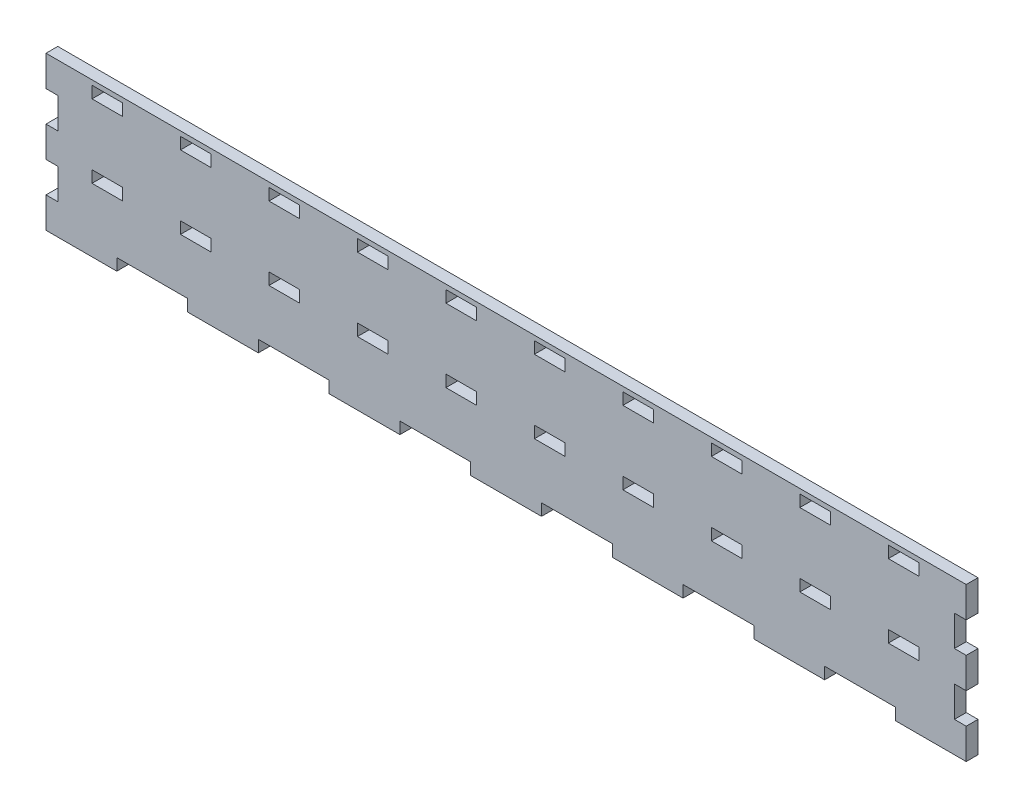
ISO-10303-21;
HEADER;
FILE_DESCRIPTION(('STEP AP214'),'2;1');
FILE_NAME('part.step','',(''),(''),'','','');
FILE_SCHEMA(('AUTOMOTIVE_DESIGN { 1 0 10303 214 1 1 1 1 }'));
ENDSEC;
DATA;
#1=APPLICATION_CONTEXT('core data for automotive mechanical design processes');
#2=APPLICATION_PROTOCOL_DEFINITION('international standard','automotive_design',2000,#1);
#3=PRODUCT_CONTEXT('',#1,'mechanical');
#4=PRODUCT('Part','Part','',(#3));
#5=PRODUCT_RELATED_PRODUCT_CATEGORY('part','',(#4));
#6=PRODUCT_DEFINITION_FORMATION('','',#4);
#7=PRODUCT_DEFINITION_CONTEXT('part definition',#1,'design');
#8=PRODUCT_DEFINITION('design','',#6,#7);
#9=PRODUCT_DEFINITION_SHAPE('','',#8);
#10=(LENGTH_UNIT() NAMED_UNIT(*) SI_UNIT(.MILLI.,.METRE.));
#11=(NAMED_UNIT(*) PLANE_ANGLE_UNIT() SI_UNIT($,.RADIAN.));
#12=(NAMED_UNIT(*) SI_UNIT($,.STERADIAN.) SOLID_ANGLE_UNIT());
#13=UNCERTAINTY_MEASURE_WITH_UNIT(LENGTH_MEASURE(1.E-05),#10,'distance_accuracy_value','');
#14=(GEOMETRIC_REPRESENTATION_CONTEXT(3) GLOBAL_UNCERTAINTY_ASSIGNED_CONTEXT((#13)) GLOBAL_UNIT_ASSIGNED_CONTEXT((#10,
#11,#12)) REPRESENTATION_CONTEXT('',''));
#15=CARTESIAN_POINT('',(0.,0.,0.));
#16=DIRECTION('',(0.,0.,1.));
#17=DIRECTION('',(1.,0.,0.));
#18=AXIS2_PLACEMENT_3D('',#15,#16,#17);
#19=CARTESIAN_POINT('',(390.,0.,5.));
#20=DIRECTION('',(-1.,0.,0.));
#21=DIRECTION('',(0.,0.,1.));
#22=AXIS2_PLACEMENT_3D('',#19,#20,#21);
#23=PLANE('',#22);
#24=DIRECTION('',(0.,0.,1.));
#25=VECTOR('',#24,1.);
#26=CARTESIAN_POINT('',(390.,-52.,0.));
#27=LINE('',#26,#25);
#28=CARTESIAN_POINT('',(390.,-52.,0.));
#29=VERTEX_POINT('',#28);
#30=CARTESIAN_POINT('',(390.,-52.,5.));
#31=VERTEX_POINT('',#30);
#32=EDGE_CURVE('E1884',#29,#31,#27,.T.);
#33=ORIENTED_EDGE('',*,*,#32,.T.);
#34=DIRECTION('',(0.,1.,0.));
#35=VECTOR('',#34,1.);
#36=CARTESIAN_POINT('',(390.,0.,5.));
#37=LINE('',#36,#35);
#38=CARTESIAN_POINT('',(390.,-65.,5.));
#39=VERTEX_POINT('',#38);
#40=EDGE_CURVE('E2197',#39,#31,#37,.T.);
#41=ORIENTED_EDGE('',*,*,#40,.F.);
#42=DIRECTION('',(0.,0.,-1.));
#43=VECTOR('',#42,1.);
#44=CARTESIAN_POINT('',(390.,-65.,5.));
#45=LINE('',#44,#43);
#46=CARTESIAN_POINT('',(390.,-65.,0.));
#47=VERTEX_POINT('',#46);
#48=EDGE_CURVE('E46',#39,#47,#45,.T.);
#49=ORIENTED_EDGE('',*,*,#48,.T.);
#50=DIRECTION('',(0.,1.,0.));
#51=VECTOR('',#50,1.);
#52=CARTESIAN_POINT('',(390.,0.,0.));
#53=LINE('',#52,#51);
#54=EDGE_CURVE('E2215',#47,#29,#53,.T.);
#55=ORIENTED_EDGE('',*,*,#54,.T.);
#56=EDGE_LOOP('',(#33,#41,#49,#55));
#57=FACE_BOUND('',#56,.T.);
#58=ADVANCED_FACE('F38',(#57),#23,.F.);
#59=DIRECTION('',(0.,0.,1.));
#60=VECTOR('',#59,1.);
#61=CARTESIAN_POINT('',(390.,-39.,0.));
#62=LINE('',#61,#60);
#63=CARTESIAN_POINT('',(390.,-39.,0.));
#64=VERTEX_POINT('',#63);
#65=CARTESIAN_POINT('',(390.,-39.,5.));
#66=VERTEX_POINT('',#65);
#67=EDGE_CURVE('E1872',#64,#66,#62,.T.);
#68=ORIENTED_EDGE('',*,*,#67,.F.);
#69=CARTESIAN_POINT('',(390.,-26.,0.));
#70=VERTEX_POINT('',#69);
#71=EDGE_CURVE('E2219',#64,#70,#53,.T.);
#72=ORIENTED_EDGE('',*,*,#71,.T.);
#73=DIRECTION('',(0.,0.,1.));
#74=VECTOR('',#73,1.);
#75=CARTESIAN_POINT('',(390.,-26.,0.));
#76=LINE('',#75,#74);
#77=CARTESIAN_POINT('',(390.,-26.,5.));
#78=VERTEX_POINT('',#77);
#79=EDGE_CURVE('E1878',#70,#78,#76,.T.);
#80=ORIENTED_EDGE('',*,*,#79,.T.);
#81=EDGE_CURVE('E2201',#66,#78,#37,.T.);
#82=ORIENTED_EDGE('',*,*,#81,.F.);
#83=EDGE_LOOP('',(#68,#72,#80,#82));
#84=FACE_BOUND('',#83,.T.);
#85=ADVANCED_FACE('F2369',(#84),#23,.F.);
#86=DIRECTION('',(0.,0.,1.));
#87=VECTOR('',#86,1.);
#88=CARTESIAN_POINT('',(390.,-13.,0.));
#89=LINE('',#88,#87);
#90=CARTESIAN_POINT('',(390.,-13.,0.));
#91=VERTEX_POINT('',#90);
#92=CARTESIAN_POINT('',(390.,-13.,5.));
#93=VERTEX_POINT('',#92);
#94=EDGE_CURVE('E1906',#91,#93,#89,.T.);
#95=ORIENTED_EDGE('',*,*,#94,.F.);
#96=CARTESIAN_POINT('',(390.,0.,0.));
#97=VERTEX_POINT('',#96);
#98=EDGE_CURVE('E2213',#91,#97,#53,.T.);
#99=ORIENTED_EDGE('',*,*,#98,.T.);
#100=DIRECTION('',(0.,0.,-1.));
#101=VECTOR('',#100,1.);
#102=CARTESIAN_POINT('',(390.,0.,5.));
#103=LINE('',#102,#101);
#104=CARTESIAN_POINT('',(390.,0.,5.));
#105=VERTEX_POINT('',#104);
#106=EDGE_CURVE('E2224',#105,#97,#103,.T.);
#107=ORIENTED_EDGE('',*,*,#106,.F.);
#108=EDGE_CURVE('E2195',#93,#105,#37,.T.);
#109=ORIENTED_EDGE('',*,*,#108,.F.);
#110=EDGE_LOOP('',(#95,#99,#107,#109));
#111=FACE_BOUND('',#110,.T.);
#112=ADVANCED_FACE('F2397',(#111),#23,.F.);
#113=CARTESIAN_POINT('',(0.,0.,5.));
#114=DIRECTION('',(0.,0.,1.));
#115=DIRECTION('',(1.,0.,0.));
#116=AXIS2_PLACEMENT_3D('',#113,#114,#115);
#117=PLANE('',#116);
#118=DIRECTION('',(0.,-1.,0.));
#119=VECTOR('',#118,1.);
#120=CARTESIAN_POINT('',(19.5,-2.,5.));
#121=LINE('',#120,#119);
#122=CARTESIAN_POINT('',(19.5,-2.,5.));
#123=VERTEX_POINT('',#122);
#124=CARTESIAN_POINT('',(19.5,-7.,5.));
#125=VERTEX_POINT('',#124);
#126=EDGE_CURVE('E56',#123,#125,#121,.T.);
#127=ORIENTED_EDGE('',*,*,#126,.F.);
#128=DIRECTION('',(-1.,0.,0.));
#129=VECTOR('',#128,1.);
#130=CARTESIAN_POINT('',(19.5,-2.,5.));
#131=LINE('',#130,#129);
#132=CARTESIAN_POINT('',(32.5,-2.,5.));
#133=VERTEX_POINT('',#132);
#134=EDGE_CURVE('E1018',#133,#123,#131,.T.);
#135=ORIENTED_EDGE('',*,*,#134,.F.);
#136=DIRECTION('',(0.,1.,0.));
#137=VECTOR('',#136,1.);
#138=CARTESIAN_POINT('',(32.5,-2.,5.));
#139=LINE('',#138,#137);
#140=CARTESIAN_POINT('',(32.5,-7.,5.));
#141=VERTEX_POINT('',#140);
#142=EDGE_CURVE('E1009',#141,#133,#139,.T.);
#143=ORIENTED_EDGE('',*,*,#142,.F.);
#144=DIRECTION('',(1.,0.,0.));
#145=VECTOR('',#144,1.);
#146=CARTESIAN_POINT('',(19.5,-7.,5.));
#147=LINE('',#146,#145);
#148=EDGE_CURVE('E995',#125,#141,#147,.T.);
#149=ORIENTED_EDGE('',*,*,#148,.F.);
#150=EDGE_LOOP('',(#127,#135,#143,#149));
#151=FACE_BOUND('',#150,.T.);
#152=DIRECTION('',(0.,-1.,0.));
#153=VECTOR('',#152,1.);
#154=CARTESIAN_POINT('',(282.,-2.,5.));
#155=LINE('',#154,#153);
#156=CARTESIAN_POINT('',(282.,-2.,5.));
#157=VERTEX_POINT('',#156);
#158=CARTESIAN_POINT('',(282.,-7.,5.));
#159=VERTEX_POINT('',#158);
#160=EDGE_CURVE('E67',#157,#159,#155,.T.);
#161=ORIENTED_EDGE('',*,*,#160,.F.);
#162=DIRECTION('',(-1.,0.,0.));
#163=VECTOR('',#162,1.);
#164=CARTESIAN_POINT('',(282.,-2.,5.));
#165=LINE('',#164,#163);
#166=CARTESIAN_POINT('',(295.,-2.,5.));
#167=VERTEX_POINT('',#166);
#168=EDGE_CURVE('E1152',#167,#157,#165,.T.);
#169=ORIENTED_EDGE('',*,*,#168,.F.);
#170=DIRECTION('',(0.,1.,0.));
#171=VECTOR('',#170,1.);
#172=CARTESIAN_POINT('',(295.,-2.,5.));
#173=LINE('',#172,#171);
#174=CARTESIAN_POINT('',(295.,-7.,5.));
#175=VERTEX_POINT('',#174);
#176=EDGE_CURVE('E1141',#175,#167,#173,.T.);
#177=ORIENTED_EDGE('',*,*,#176,.F.);
#178=DIRECTION('',(1.,0.,0.));
#179=VECTOR('',#178,1.);
#180=CARTESIAN_POINT('',(282.,-7.,5.));
#181=LINE('',#180,#179);
#182=EDGE_CURVE('E1127',#159,#175,#181,.T.);
#183=ORIENTED_EDGE('',*,*,#182,.F.);
#184=EDGE_LOOP('',(#161,#169,#177,#183));
#185=FACE_BOUND('',#184,.T.);
#186=DIRECTION('',(0.,-1.,0.));
#187=VECTOR('',#186,1.);
#188=CARTESIAN_POINT('',(244.5,-2.,5.));
#189=LINE('',#188,#187);
#190=CARTESIAN_POINT('',(244.5,-2.,5.));
#191=VERTEX_POINT('',#190);
#192=CARTESIAN_POINT('',(244.5,-7.,5.));
#193=VERTEX_POINT('',#192);
#194=EDGE_CURVE('E1205',#191,#193,#189,.T.);
#195=ORIENTED_EDGE('',*,*,#194,.F.);
#196=DIRECTION('',(-1.,0.,0.));
#197=VECTOR('',#196,1.);
#198=CARTESIAN_POINT('',(244.5,-2.,5.));
#199=LINE('',#198,#197);
#200=CARTESIAN_POINT('',(257.5,-2.,5.));
#201=VERTEX_POINT('',#200);
#202=EDGE_CURVE('E1194',#201,#191,#199,.T.);
#203=ORIENTED_EDGE('',*,*,#202,.F.);
#204=DIRECTION('',(0.,1.,0.));
#205=VECTOR('',#204,1.);
#206=CARTESIAN_POINT('',(257.5,-2.,5.));
#207=LINE('',#206,#205);
#208=CARTESIAN_POINT('',(257.5,-7.,5.));
#209=VERTEX_POINT('',#208);
#210=EDGE_CURVE('E1183',#209,#201,#207,.T.);
#211=ORIENTED_EDGE('',*,*,#210,.F.);
#212=DIRECTION('',(1.,0.,0.));
#213=VECTOR('',#212,1.);
#214=CARTESIAN_POINT('',(244.5,-7.,5.));
#215=LINE('',#214,#213);
#216=EDGE_CURVE('E1168',#193,#209,#215,.T.);
#217=ORIENTED_EDGE('',*,*,#216,.F.);
#218=EDGE_LOOP('',(#195,#203,#211,#217));
#219=FACE_BOUND('',#218,.T.);
#220=DIRECTION('',(0.,-1.,0.));
#221=VECTOR('',#220,1.);
#222=CARTESIAN_POINT('',(357.,-2.,5.));
#223=LINE('',#222,#221);
#224=CARTESIAN_POINT('',(357.,-2.,5.));
#225=VERTEX_POINT('',#224);
#226=CARTESIAN_POINT('',(357.,-7.,5.));
#227=VERTEX_POINT('',#226);
#228=EDGE_CURVE('E1076',#225,#227,#223,.T.);
#229=ORIENTED_EDGE('',*,*,#228,.F.);
#230=DIRECTION('',(-1.,0.,0.));
#231=VECTOR('',#230,1.);
#232=CARTESIAN_POINT('',(357.,-2.,5.));
#233=LINE('',#232,#231);
#234=CARTESIAN_POINT('',(370.,-2.,5.));
#235=VERTEX_POINT('',#234);
#236=EDGE_CURVE('E1065',#235,#225,#233,.T.);
#237=ORIENTED_EDGE('',*,*,#236,.F.);
#238=DIRECTION('',(0.,1.,0.));
#239=VECTOR('',#238,1.);
#240=CARTESIAN_POINT('',(370.,-2.,5.));
#241=LINE('',#240,#239);
#242=CARTESIAN_POINT('',(370.,-7.,5.));
#243=VERTEX_POINT('',#242);
#244=EDGE_CURVE('E1054',#243,#235,#241,.T.);
#245=ORIENTED_EDGE('',*,*,#244,.F.);
#246=DIRECTION('',(1.,0.,0.));
#247=VECTOR('',#246,1.);
#248=CARTESIAN_POINT('',(357.,-7.,5.));
#249=LINE('',#248,#247);
#250=EDGE_CURVE('E1039',#227,#243,#249,.T.);
#251=ORIENTED_EDGE('',*,*,#250,.F.);
#252=EDGE_LOOP('',(#229,#237,#245,#251));
#253=FACE_BOUND('',#252,.T.);
#254=DIRECTION('',(0.,-1.,0.));
#255=VECTOR('',#254,1.);
#256=CARTESIAN_POINT('',(319.5,-2.,5.));
#257=LINE('',#256,#255);
#258=CARTESIAN_POINT('',(319.5,-2.,5.));
#259=VERTEX_POINT('',#258);
#260=CARTESIAN_POINT('',(319.5,-7.,5.));
#261=VERTEX_POINT('',#260);
#262=EDGE_CURVE('E1120',#259,#261,#257,.T.);
#263=ORIENTED_EDGE('',*,*,#262,.F.);
#264=DIRECTION('',(-1.,0.,0.));
#265=VECTOR('',#264,1.);
#266=CARTESIAN_POINT('',(319.5,-2.,5.));
#267=LINE('',#266,#265);
#268=CARTESIAN_POINT('',(332.5,-2.,5.));
#269=VERTEX_POINT('',#268);
#270=EDGE_CURVE('E1109',#269,#259,#267,.T.);
#271=ORIENTED_EDGE('',*,*,#270,.F.);
#272=DIRECTION('',(0.,1.,0.));
#273=VECTOR('',#272,1.);
#274=CARTESIAN_POINT('',(332.5,-2.,5.));
#275=LINE('',#274,#273);
#276=CARTESIAN_POINT('',(332.5,-7.,5.));
#277=VERTEX_POINT('',#276);
#278=EDGE_CURVE('E1098',#277,#269,#275,.T.);
#279=ORIENTED_EDGE('',*,*,#278,.F.);
#280=DIRECTION('',(1.,0.,0.));
#281=VECTOR('',#280,1.);
#282=CARTESIAN_POINT('',(319.5,-7.,5.));
#283=LINE('',#282,#281);
#284=EDGE_CURVE('E1083',#261,#277,#283,.T.);
#285=ORIENTED_EDGE('',*,*,#284,.F.);
#286=EDGE_LOOP('',(#263,#271,#279,#285));
#287=FACE_BOUND('',#286,.T.);
#288=DIRECTION('',(0.,-1.,0.));
#289=VECTOR('',#288,1.);
#290=CARTESIAN_POINT('',(132.,-2.,5.));
#291=LINE('',#290,#289);
#292=CARTESIAN_POINT('',(132.,-2.,5.));
#293=VERTEX_POINT('',#292);
#294=CARTESIAN_POINT('',(132.,-7.,5.));
#295=VERTEX_POINT('',#294);
#296=EDGE_CURVE('E1337',#293,#295,#291,.T.);
#297=ORIENTED_EDGE('',*,*,#296,.F.);
#298=DIRECTION('',(-1.,0.,0.));
#299=VECTOR('',#298,1.);
#300=CARTESIAN_POINT('',(132.,-2.,5.));
#301=LINE('',#300,#299);
#302=CARTESIAN_POINT('',(145.,-2.,5.));
#303=VERTEX_POINT('',#302);
#304=EDGE_CURVE('E1326',#303,#293,#301,.T.);
#305=ORIENTED_EDGE('',*,*,#304,.F.);
#306=DIRECTION('',(0.,1.,0.));
#307=VECTOR('',#306,1.);
#308=CARTESIAN_POINT('',(145.,-2.,5.));
#309=LINE('',#308,#307);
#310=CARTESIAN_POINT('',(145.,-7.,5.));
#311=VERTEX_POINT('',#310);
#312=EDGE_CURVE('E1315',#311,#303,#309,.T.);
#313=ORIENTED_EDGE('',*,*,#312,.F.);
#314=DIRECTION('',(1.,0.,0.));
#315=VECTOR('',#314,1.);
#316=CARTESIAN_POINT('',(132.,-7.,5.));
#317=LINE('',#316,#315);
#318=EDGE_CURVE('E1300',#295,#311,#317,.T.);
#319=ORIENTED_EDGE('',*,*,#318,.F.);
#320=EDGE_LOOP('',(#297,#305,#313,#319));
#321=FACE_BOUND('',#320,.T.);
#322=DIRECTION('',(0.,-1.,0.));
#323=VECTOR('',#322,1.);
#324=CARTESIAN_POINT('',(94.5,-2.,5.));
#325=LINE('',#324,#323);
#326=CARTESIAN_POINT('',(94.5,-2.,5.));
#327=VERTEX_POINT('',#326);
#328=CARTESIAN_POINT('',(94.5,-7.,5.));
#329=VERTEX_POINT('',#328);
#330=EDGE_CURVE('E1381',#327,#329,#325,.T.);
#331=ORIENTED_EDGE('',*,*,#330,.F.);
#332=DIRECTION('',(-1.,0.,0.));
#333=VECTOR('',#332,1.);
#334=CARTESIAN_POINT('',(94.5,-2.,5.));
#335=LINE('',#334,#333);
#336=CARTESIAN_POINT('',(107.5,-2.,5.));
#337=VERTEX_POINT('',#336);
#338=EDGE_CURVE('E1370',#337,#327,#335,.T.);
#339=ORIENTED_EDGE('',*,*,#338,.F.);
#340=DIRECTION('',(0.,1.,0.));
#341=VECTOR('',#340,1.);
#342=CARTESIAN_POINT('',(107.5,-2.,5.));
#343=LINE('',#342,#341);
#344=CARTESIAN_POINT('',(107.5,-7.,5.));
#345=VERTEX_POINT('',#344);
#346=EDGE_CURVE('E1359',#345,#337,#343,.T.);
#347=ORIENTED_EDGE('',*,*,#346,.F.);
#348=DIRECTION('',(1.,0.,0.));
#349=VECTOR('',#348,1.);
#350=CARTESIAN_POINT('',(94.5,-7.,5.));
#351=LINE('',#350,#349);
#352=EDGE_CURVE('E1344',#329,#345,#351,.T.);
#353=ORIENTED_EDGE('',*,*,#352,.F.);
#354=EDGE_LOOP('',(#331,#339,#347,#353));
#355=FACE_BOUND('',#354,.T.);
#356=DIRECTION('',(0.,-1.,0.));
#357=VECTOR('',#356,1.);
#358=CARTESIAN_POINT('',(207.,-2.,5.));
#359=LINE('',#358,#357);
#360=CARTESIAN_POINT('',(207.,-2.,5.));
#361=VERTEX_POINT('',#360);
#362=CARTESIAN_POINT('',(207.,-7.,5.));
#363=VERTEX_POINT('',#362);
#364=EDGE_CURVE('E1249',#361,#363,#359,.T.);
#365=ORIENTED_EDGE('',*,*,#364,.F.);
#366=DIRECTION('',(-1.,0.,0.));
#367=VECTOR('',#366,1.);
#368=CARTESIAN_POINT('',(207.,-2.,5.));
#369=LINE('',#368,#367);
#370=CARTESIAN_POINT('',(220.,-2.,5.));
#371=VERTEX_POINT('',#370);
#372=EDGE_CURVE('E1238',#371,#361,#369,.T.);
#373=ORIENTED_EDGE('',*,*,#372,.F.);
#374=DIRECTION('',(0.,1.,0.));
#375=VECTOR('',#374,1.);
#376=CARTESIAN_POINT('',(220.,-2.,5.));
#377=LINE('',#376,#375);
#378=CARTESIAN_POINT('',(220.,-7.,5.));
#379=VERTEX_POINT('',#378);
#380=EDGE_CURVE('E1227',#379,#371,#377,.T.);
#381=ORIENTED_EDGE('',*,*,#380,.F.);
#382=DIRECTION('',(1.,0.,0.));
#383=VECTOR('',#382,1.);
#384=CARTESIAN_POINT('',(207.,-7.,5.));
#385=LINE('',#384,#383);
#386=EDGE_CURVE('E1212',#363,#379,#385,.T.);
#387=ORIENTED_EDGE('',*,*,#386,.F.);
#388=EDGE_LOOP('',(#365,#373,#381,#387));
#389=FACE_BOUND('',#388,.T.);
#390=DIRECTION('',(0.,-1.,0.));
#391=VECTOR('',#390,1.);
#392=CARTESIAN_POINT('',(169.5,-2.,5.));
#393=LINE('',#392,#391);
#394=CARTESIAN_POINT('',(169.5,-2.,5.));
#395=VERTEX_POINT('',#394);
#396=CARTESIAN_POINT('',(169.5,-7.,5.));
#397=VERTEX_POINT('',#396);
#398=EDGE_CURVE('E1293',#395,#397,#393,.T.);
#399=ORIENTED_EDGE('',*,*,#398,.F.);
#400=DIRECTION('',(-1.,0.,0.));
#401=VECTOR('',#400,1.);
#402=CARTESIAN_POINT('',(169.5,-2.,5.));
#403=LINE('',#402,#401);
#404=CARTESIAN_POINT('',(182.5,-2.,5.));
#405=VERTEX_POINT('',#404);
#406=EDGE_CURVE('E1282',#405,#395,#403,.T.);
#407=ORIENTED_EDGE('',*,*,#406,.F.);
#408=DIRECTION('',(0.,1.,0.));
#409=VECTOR('',#408,1.);
#410=CARTESIAN_POINT('',(182.5,-2.,5.));
#411=LINE('',#410,#409);
#412=CARTESIAN_POINT('',(182.5,-7.,5.));
#413=VERTEX_POINT('',#412);
#414=EDGE_CURVE('E1271',#413,#405,#411,.T.);
#415=ORIENTED_EDGE('',*,*,#414,.F.);
#416=DIRECTION('',(1.,0.,0.));
#417=VECTOR('',#416,1.);
#418=CARTESIAN_POINT('',(169.5,-7.,5.));
#419=LINE('',#418,#417);
#420=EDGE_CURVE('E1256',#397,#413,#419,.T.);
#421=ORIENTED_EDGE('',*,*,#420,.F.);
#422=EDGE_LOOP('',(#399,#407,#415,#421));
#423=FACE_BOUND('',#422,.T.);
#424=DIRECTION('',(0.,-1.,0.));
#425=VECTOR('',#424,1.);
#426=CARTESIAN_POINT('',(19.5,-33.,5.));
#427=LINE('',#426,#425);
#428=CARTESIAN_POINT('',(19.5,-33.,5.));
#429=VERTEX_POINT('',#428);
#430=CARTESIAN_POINT('',(19.5,-38.,5.));
#431=VERTEX_POINT('',#430);
#432=EDGE_CURVE('E1423',#429,#431,#427,.T.);
#433=ORIENTED_EDGE('',*,*,#432,.F.);
#434=DIRECTION('',(-1.,0.,0.));
#435=VECTOR('',#434,1.);
#436=CARTESIAN_POINT('',(19.5,-33.,5.));
#437=LINE('',#436,#435);
#438=CARTESIAN_POINT('',(32.5,-33.,5.));
#439=VERTEX_POINT('',#438);
#440=EDGE_CURVE('E1413',#439,#429,#437,.T.);
#441=ORIENTED_EDGE('',*,*,#440,.F.);
#442=DIRECTION('',(0.,1.,0.));
#443=VECTOR('',#442,1.);
#444=CARTESIAN_POINT('',(32.5,-33.,5.));
#445=LINE('',#444,#443);
#446=CARTESIAN_POINT('',(32.5,-38.,5.));
#447=VERTEX_POINT('',#446);
#448=EDGE_CURVE('E1402',#447,#439,#445,.T.);
#449=ORIENTED_EDGE('',*,*,#448,.F.);
#450=DIRECTION('',(1.,0.,0.));
#451=VECTOR('',#450,1.);
#452=CARTESIAN_POINT('',(19.5,-38.,5.));
#453=LINE('',#452,#451);
#454=EDGE_CURVE('E1387',#431,#447,#453,.T.);
#455=ORIENTED_EDGE('',*,*,#454,.F.);
#456=EDGE_LOOP('',(#433,#441,#449,#455));
#457=FACE_BOUND('',#456,.T.);
#458=DIRECTION('',(0.,-1.,0.));
#459=VECTOR('',#458,1.);
#460=CARTESIAN_POINT('',(282.,-33.,5.));
#461=LINE('',#460,#459);
#462=CARTESIAN_POINT('',(282.,-33.,5.));
#463=VERTEX_POINT('',#462);
#464=CARTESIAN_POINT('',(282.,-38.,5.));
#465=VERTEX_POINT('',#464);
#466=EDGE_CURVE('E1548',#463,#465,#461,.T.);
#467=ORIENTED_EDGE('',*,*,#466,.F.);
#468=DIRECTION('',(-1.,0.,0.));
#469=VECTOR('',#468,1.);
#470=CARTESIAN_POINT('',(282.,-33.,5.));
#471=LINE('',#470,#469);
#472=CARTESIAN_POINT('',(295.,-33.,5.));
#473=VERTEX_POINT('',#472);
#474=EDGE_CURVE('E1537',#473,#463,#471,.T.);
#475=ORIENTED_EDGE('',*,*,#474,.F.);
#476=DIRECTION('',(0.,1.,0.));
#477=VECTOR('',#476,1.);
#478=CARTESIAN_POINT('',(295.,-33.,5.));
#479=LINE('',#478,#477);
#480=CARTESIAN_POINT('',(295.,-38.,5.));
#481=VERTEX_POINT('',#480);
#482=EDGE_CURVE('E1526',#481,#473,#479,.T.);
#483=ORIENTED_EDGE('',*,*,#482,.F.);
#484=DIRECTION('',(1.,0.,0.));
#485=VECTOR('',#484,1.);
#486=CARTESIAN_POINT('',(282.,-38.,5.));
#487=LINE('',#486,#485);
#488=EDGE_CURVE('E1511',#465,#481,#487,.T.);
#489=ORIENTED_EDGE('',*,*,#488,.F.);
#490=EDGE_LOOP('',(#467,#475,#483,#489));
#491=FACE_BOUND('',#490,.T.);
#492=DIRECTION('',(0.,-1.,0.));
#493=VECTOR('',#492,1.);
#494=CARTESIAN_POINT('',(244.5,-33.,5.));
#495=LINE('',#494,#493);
#496=CARTESIAN_POINT('',(244.5,-33.,5.));
#497=VERTEX_POINT('',#496);
#498=CARTESIAN_POINT('',(244.5,-38.,5.));
#499=VERTEX_POINT('',#498);
#500=EDGE_CURVE('E1592',#497,#499,#495,.T.);
#501=ORIENTED_EDGE('',*,*,#500,.F.);
#502=DIRECTION('',(-1.,0.,0.));
#503=VECTOR('',#502,1.);
#504=CARTESIAN_POINT('',(244.5,-33.,5.));
#505=LINE('',#504,#503);
#506=CARTESIAN_POINT('',(257.5,-33.,5.));
#507=VERTEX_POINT('',#506);
#508=EDGE_CURVE('E1581',#507,#497,#505,.T.);
#509=ORIENTED_EDGE('',*,*,#508,.F.);
#510=DIRECTION('',(0.,1.,0.));
#511=VECTOR('',#510,1.);
#512=CARTESIAN_POINT('',(257.5,-33.,5.));
#513=LINE('',#512,#511);
#514=CARTESIAN_POINT('',(257.5,-38.,5.));
#515=VERTEX_POINT('',#514);
#516=EDGE_CURVE('E1570',#515,#507,#513,.T.);
#517=ORIENTED_EDGE('',*,*,#516,.F.);
#518=DIRECTION('',(1.,0.,0.));
#519=VECTOR('',#518,1.);
#520=CARTESIAN_POINT('',(244.5,-38.,5.));
#521=LINE('',#520,#519);
#522=EDGE_CURVE('E1555',#499,#515,#521,.T.);
#523=ORIENTED_EDGE('',*,*,#522,.F.);
#524=EDGE_LOOP('',(#501,#509,#517,#523));
#525=FACE_BOUND('',#524,.T.);
#526=DIRECTION('',(0.,-1.,0.));
#527=VECTOR('',#526,1.);
#528=CARTESIAN_POINT('',(357.,-33.,5.));
#529=LINE('',#528,#527);
#530=CARTESIAN_POINT('',(357.,-33.,5.));
#531=VERTEX_POINT('',#530);
#532=CARTESIAN_POINT('',(357.,-38.,5.));
#533=VERTEX_POINT('',#532);
#534=EDGE_CURVE('E1462',#531,#533,#529,.T.);
#535=ORIENTED_EDGE('',*,*,#534,.F.);
#536=DIRECTION('',(-1.,0.,0.));
#537=VECTOR('',#536,1.);
#538=CARTESIAN_POINT('',(357.,-33.,5.));
#539=LINE('',#538,#537);
#540=CARTESIAN_POINT('',(370.,-33.,5.));
#541=VERTEX_POINT('',#540);
#542=EDGE_CURVE('E1452',#541,#531,#539,.T.);
#543=ORIENTED_EDGE('',*,*,#542,.F.);
#544=DIRECTION('',(0.,1.,0.));
#545=VECTOR('',#544,1.);
#546=CARTESIAN_POINT('',(370.,-33.,5.));
#547=LINE('',#546,#545);
#548=CARTESIAN_POINT('',(370.,-38.,5.));
#549=VERTEX_POINT('',#548);
#550=EDGE_CURVE('E1441',#549,#541,#547,.T.);
#551=ORIENTED_EDGE('',*,*,#550,.F.);
#552=DIRECTION('',(1.,0.,0.));
#553=VECTOR('',#552,1.);
#554=CARTESIAN_POINT('',(357.,-38.,5.));
#555=LINE('',#554,#553);
#556=EDGE_CURVE('E1038',#533,#549,#555,.T.);
#557=ORIENTED_EDGE('',*,*,#556,.F.);
#558=EDGE_LOOP('',(#535,#543,#551,#557));
#559=FACE_BOUND('',#558,.T.);
#560=DIRECTION('',(0.,-1.,0.));
#561=VECTOR('',#560,1.);
#562=CARTESIAN_POINT('',(319.5,-33.,5.));
#563=LINE('',#562,#561);
#564=CARTESIAN_POINT('',(319.5,-33.,5.));
#565=VERTEX_POINT('',#564);
#566=CARTESIAN_POINT('',(319.5,-38.,5.));
#567=VERTEX_POINT('',#566);
#568=EDGE_CURVE('E1504',#565,#567,#563,.T.);
#569=ORIENTED_EDGE('',*,*,#568,.F.);
#570=DIRECTION('',(-1.,0.,0.));
#571=VECTOR('',#570,1.);
#572=CARTESIAN_POINT('',(319.5,-33.,5.));
#573=LINE('',#572,#571);
#574=CARTESIAN_POINT('',(332.5,-33.,5.));
#575=VERTEX_POINT('',#574);
#576=EDGE_CURVE('E1493',#575,#565,#573,.T.);
#577=ORIENTED_EDGE('',*,*,#576,.F.);
#578=DIRECTION('',(0.,1.,0.));
#579=VECTOR('',#578,1.);
#580=CARTESIAN_POINT('',(332.5,-33.,5.));
#581=LINE('',#580,#579);
#582=CARTESIAN_POINT('',(332.5,-38.,5.));
#583=VERTEX_POINT('',#582);
#584=EDGE_CURVE('E1482',#583,#575,#581,.T.);
#585=ORIENTED_EDGE('',*,*,#584,.F.);
#586=DIRECTION('',(1.,0.,0.));
#587=VECTOR('',#586,1.);
#588=CARTESIAN_POINT('',(319.5,-38.,5.));
#589=LINE('',#588,#587);
#590=EDGE_CURVE('E1467',#567,#583,#589,.T.);
#591=ORIENTED_EDGE('',*,*,#590,.F.);
#592=EDGE_LOOP('',(#569,#577,#585,#591));
#593=FACE_BOUND('',#592,.T.);
#594=DIRECTION('',(0.,-1.,0.));
#595=VECTOR('',#594,1.);
#596=CARTESIAN_POINT('',(132.,-33.,5.));
#597=LINE('',#596,#595);
#598=CARTESIAN_POINT('',(132.,-33.,5.));
#599=VERTEX_POINT('',#598);
#600=CARTESIAN_POINT('',(132.,-38.,5.));
#601=VERTEX_POINT('',#600);
#602=EDGE_CURVE('E1724',#599,#601,#597,.T.);
#603=ORIENTED_EDGE('',*,*,#602,.F.);
#604=DIRECTION('',(-1.,0.,0.));
#605=VECTOR('',#604,1.);
#606=CARTESIAN_POINT('',(132.,-33.,5.));
#607=LINE('',#606,#605);
#608=CARTESIAN_POINT('',(145.,-33.,5.));
#609=VERTEX_POINT('',#608);
#610=EDGE_CURVE('E1713',#609,#599,#607,.T.);
#611=ORIENTED_EDGE('',*,*,#610,.F.);
#612=DIRECTION('',(0.,1.,0.));
#613=VECTOR('',#612,1.);
#614=CARTESIAN_POINT('',(145.,-33.,5.));
#615=LINE('',#614,#613);
#616=CARTESIAN_POINT('',(145.,-38.,5.));
#617=VERTEX_POINT('',#616);
#618=EDGE_CURVE('E1702',#617,#609,#615,.T.);
#619=ORIENTED_EDGE('',*,*,#618,.F.);
#620=DIRECTION('',(1.,0.,0.));
#621=VECTOR('',#620,1.);
#622=CARTESIAN_POINT('',(132.,-38.,5.));
#623=LINE('',#622,#621);
#624=EDGE_CURVE('E1687',#601,#617,#623,.T.);
#625=ORIENTED_EDGE('',*,*,#624,.F.);
#626=EDGE_LOOP('',(#603,#611,#619,#625));
#627=FACE_BOUND('',#626,.T.);
#628=DIRECTION('',(0.,-1.,0.));
#629=VECTOR('',#628,1.);
#630=CARTESIAN_POINT('',(94.5,-33.,5.));
#631=LINE('',#630,#629);
#632=CARTESIAN_POINT('',(94.5,-33.,5.));
#633=VERTEX_POINT('',#632);
#634=CARTESIAN_POINT('',(94.5,-38.,5.));
#635=VERTEX_POINT('',#634);
#636=EDGE_CURVE('E1768',#633,#635,#631,.T.);
#637=ORIENTED_EDGE('',*,*,#636,.F.);
#638=DIRECTION('',(-1.,0.,0.));
#639=VECTOR('',#638,1.);
#640=CARTESIAN_POINT('',(94.5,-33.,5.));
#641=LINE('',#640,#639);
#642=CARTESIAN_POINT('',(107.5,-33.,5.));
#643=VERTEX_POINT('',#642);
#644=EDGE_CURVE('E1757',#643,#633,#641,.T.);
#645=ORIENTED_EDGE('',*,*,#644,.F.);
#646=DIRECTION('',(0.,1.,0.));
#647=VECTOR('',#646,1.);
#648=CARTESIAN_POINT('',(107.5,-33.,5.));
#649=LINE('',#648,#647);
#650=CARTESIAN_POINT('',(107.5,-38.,5.));
#651=VERTEX_POINT('',#650);
#652=EDGE_CURVE('E1746',#651,#643,#649,.T.);
#653=ORIENTED_EDGE('',*,*,#652,.F.);
#654=DIRECTION('',(1.,0.,0.));
#655=VECTOR('',#654,1.);
#656=CARTESIAN_POINT('',(94.5,-38.,5.));
#657=LINE('',#656,#655);
#658=EDGE_CURVE('E1731',#635,#651,#657,.T.);
#659=ORIENTED_EDGE('',*,*,#658,.F.);
#660=EDGE_LOOP('',(#637,#645,#653,#659));
#661=FACE_BOUND('',#660,.T.);
#662=DIRECTION('',(0.,-1.,0.));
#663=VECTOR('',#662,1.);
#664=CARTESIAN_POINT('',(207.,-33.,5.));
#665=LINE('',#664,#663);
#666=CARTESIAN_POINT('',(207.,-33.,5.));
#667=VERTEX_POINT('',#666);
#668=CARTESIAN_POINT('',(207.,-38.,5.));
#669=VERTEX_POINT('',#668);
#670=EDGE_CURVE('E1636',#667,#669,#665,.T.);
#671=ORIENTED_EDGE('',*,*,#670,.F.);
#672=DIRECTION('',(-1.,0.,0.));
#673=VECTOR('',#672,1.);
#674=CARTESIAN_POINT('',(207.,-33.,5.));
#675=LINE('',#674,#673);
#676=CARTESIAN_POINT('',(220.,-33.,5.));
#677=VERTEX_POINT('',#676);
#678=EDGE_CURVE('E1625',#677,#667,#675,.T.);
#679=ORIENTED_EDGE('',*,*,#678,.F.);
#680=DIRECTION('',(0.,1.,0.));
#681=VECTOR('',#680,1.);
#682=CARTESIAN_POINT('',(220.,-33.,5.));
#683=LINE('',#682,#681);
#684=CARTESIAN_POINT('',(220.,-38.,5.));
#685=VERTEX_POINT('',#684);
#686=EDGE_CURVE('E1614',#685,#677,#683,.T.);
#687=ORIENTED_EDGE('',*,*,#686,.F.);
#688=DIRECTION('',(1.,0.,0.));
#689=VECTOR('',#688,1.);
#690=CARTESIAN_POINT('',(207.,-38.,5.));
#691=LINE('',#690,#689);
#692=EDGE_CURVE('E1599',#669,#685,#691,.T.);
#693=ORIENTED_EDGE('',*,*,#692,.F.);
#694=EDGE_LOOP('',(#671,#679,#687,#693));
#695=FACE_BOUND('',#694,.T.);
#696=DIRECTION('',(0.,-1.,0.));
#697=VECTOR('',#696,1.);
#698=CARTESIAN_POINT('',(169.5,-33.,5.));
#699=LINE('',#698,#697);
#700=CARTESIAN_POINT('',(169.5,-33.,5.));
#701=VERTEX_POINT('',#700);
#702=CARTESIAN_POINT('',(169.5,-38.,5.));
#703=VERTEX_POINT('',#702);
#704=EDGE_CURVE('E1680',#701,#703,#699,.T.);
#705=ORIENTED_EDGE('',*,*,#704,.F.);
#706=DIRECTION('',(-1.,0.,0.));
#707=VECTOR('',#706,1.);
#708=CARTESIAN_POINT('',(169.5,-33.,5.));
#709=LINE('',#708,#707);
#710=CARTESIAN_POINT('',(182.5,-33.,5.));
#711=VERTEX_POINT('',#710);
#712=EDGE_CURVE('E1669',#711,#701,#709,.T.);
#713=ORIENTED_EDGE('',*,*,#712,.F.);
#714=DIRECTION('',(0.,1.,0.));
#715=VECTOR('',#714,1.);
#716=CARTESIAN_POINT('',(182.5,-33.,5.));
#717=LINE('',#716,#715);
#718=CARTESIAN_POINT('',(182.5,-38.,5.));
#719=VERTEX_POINT('',#718);
#720=EDGE_CURVE('E1658',#719,#711,#717,.T.);
#721=ORIENTED_EDGE('',*,*,#720,.F.);
#722=DIRECTION('',(1.,0.,0.));
#723=VECTOR('',#722,1.);
#724=CARTESIAN_POINT('',(169.5,-38.,5.));
#725=LINE('',#724,#723);
#726=EDGE_CURVE('E1643',#703,#719,#725,.T.);
#727=ORIENTED_EDGE('',*,*,#726,.F.);
#728=EDGE_LOOP('',(#705,#713,#721,#727));
#729=FACE_BOUND('',#728,.T.);
#730=DIRECTION('',(0.,-1.,0.));
#731=VECTOR('',#730,1.);
#732=CARTESIAN_POINT('',(57.,-33.,5.));
#733=LINE('',#732,#731);
#734=CARTESIAN_POINT('',(57.,-33.,5.));
#735=VERTEX_POINT('',#734);
#736=CARTESIAN_POINT('',(57.,-38.,5.));
#737=VERTEX_POINT('',#736);
#738=EDGE_CURVE('E1792',#735,#737,#733,.T.);
#739=ORIENTED_EDGE('',*,*,#738,.F.);
#740=DIRECTION('',(-1.,0.,0.));
#741=VECTOR('',#740,1.);
#742=CARTESIAN_POINT('',(57.,-33.,5.));
#743=LINE('',#742,#741);
#744=CARTESIAN_POINT('',(70.,-33.,5.));
#745=VERTEX_POINT('',#744);
#746=EDGE_CURVE('E1779',#745,#735,#743,.T.);
#747=ORIENTED_EDGE('',*,*,#746,.F.);
#748=DIRECTION('',(0.,1.,0.));
#749=VECTOR('',#748,1.);
#750=CARTESIAN_POINT('',(70.,-33.,5.));
#751=LINE('',#750,#749);
#752=CARTESIAN_POINT('',(70.,-38.,5.));
#753=VERTEX_POINT('',#752);
#754=EDGE_CURVE('E1800',#753,#745,#751,.T.);
#755=ORIENTED_EDGE('',*,*,#754,.F.);
#756=DIRECTION('',(1.,0.,0.));
#757=VECTOR('',#756,1.);
#758=CARTESIAN_POINT('',(57.,-38.,5.));
#759=LINE('',#758,#757);
#760=EDGE_CURVE('E1795',#737,#753,#759,.T.);
#761=ORIENTED_EDGE('',*,*,#760,.F.);
#762=EDGE_LOOP('',(#739,#747,#755,#761));
#763=FACE_BOUND('',#762,.T.);
#764=DIRECTION('',(0.,-1.,0.));
#765=VECTOR('',#764,1.);
#766=CARTESIAN_POINT('',(57.,-2.,5.));
#767=LINE('',#766,#765);
#768=CARTESIAN_POINT('',(57.,-2.,5.));
#769=VERTEX_POINT('',#768);
#770=CARTESIAN_POINT('',(57.,-7.,5.));
#771=VERTEX_POINT('',#770);
#772=EDGE_CURVE('E1428',#769,#771,#767,.T.);
#773=ORIENTED_EDGE('',*,*,#772,.F.);
#774=DIRECTION('',(-1.,0.,0.));
#775=VECTOR('',#774,1.);
#776=CARTESIAN_POINT('',(57.,-2.,5.));
#777=LINE('',#776,#775);
#778=CARTESIAN_POINT('',(70.,-2.,5.));
#779=VERTEX_POINT('',#778);
#780=EDGE_CURVE('E1825',#779,#769,#777,.T.);
#781=ORIENTED_EDGE('',*,*,#780,.F.);
#782=DIRECTION('',(0.,1.,0.));
#783=VECTOR('',#782,1.);
#784=CARTESIAN_POINT('',(70.,-2.,5.));
#785=LINE('',#784,#783);
#786=CARTESIAN_POINT('',(70.,-7.,5.));
#787=VERTEX_POINT('',#786);
#788=EDGE_CURVE('E1844',#787,#779,#785,.T.);
#789=ORIENTED_EDGE('',*,*,#788,.F.);
#790=DIRECTION('',(1.,0.,0.));
#791=VECTOR('',#790,1.);
#792=CARTESIAN_POINT('',(57.,-7.,5.));
#793=LINE('',#792,#791);
#794=EDGE_CURVE('E1840',#771,#787,#793,.T.);
#795=ORIENTED_EDGE('',*,*,#794,.F.);
#796=EDGE_LOOP('',(#773,#781,#789,#795));
#797=FACE_BOUND('',#796,.T.);
#798=ORIENTED_EDGE('',*,*,#40,.T.);
#799=DIRECTION('',(-1.,0.,0.));
#800=VECTOR('',#799,1.);
#801=CARTESIAN_POINT('',(390.,-52.,5.));
#802=LINE('',#801,#800);
#803=CARTESIAN_POINT('',(385.,-52.,5.));
#804=VERTEX_POINT('',#803);
#805=EDGE_CURVE('E1866',#31,#804,#802,.T.);
#806=ORIENTED_EDGE('',*,*,#805,.T.);
#807=DIRECTION('',(0.,1.,0.));
#808=VECTOR('',#807,1.);
#809=CARTESIAN_POINT('',(385.,-52.,5.));
#810=LINE('',#809,#808);
#811=CARTESIAN_POINT('',(385.,-39.,5.));
#812=VERTEX_POINT('',#811);
#813=EDGE_CURVE('E1877',#804,#812,#810,.T.);
#814=ORIENTED_EDGE('',*,*,#813,.T.);
#815=DIRECTION('',(1.,0.,0.));
#816=VECTOR('',#815,1.);
#817=CARTESIAN_POINT('',(390.,-39.,5.));
#818=LINE('',#817,#816);
#819=EDGE_CURVE('E1873',#812,#66,#818,.T.);
#820=ORIENTED_EDGE('',*,*,#819,.T.);
#821=ORIENTED_EDGE('',*,*,#81,.T.);
#822=DIRECTION('',(-1.,0.,0.));
#823=VECTOR('',#822,1.);
#824=CARTESIAN_POINT('',(390.,-26.,5.));
#825=LINE('',#824,#823);
#826=CARTESIAN_POINT('',(385.,-26.,5.));
#827=VERTEX_POINT('',#826);
#828=EDGE_CURVE('E1899',#78,#827,#825,.T.);
#829=ORIENTED_EDGE('',*,*,#828,.T.);
#830=DIRECTION('',(0.,1.,0.));
#831=VECTOR('',#830,1.);
#832=CARTESIAN_POINT('',(385.,-26.,5.));
#833=LINE('',#832,#831);
#834=CARTESIAN_POINT('',(385.,-13.,5.));
#835=VERTEX_POINT('',#834);
#836=EDGE_CURVE('E1910',#827,#835,#833,.T.);
#837=ORIENTED_EDGE('',*,*,#836,.T.);
#838=DIRECTION('',(1.,0.,0.));
#839=VECTOR('',#838,1.);
#840=CARTESIAN_POINT('',(390.,-13.,5.));
#841=LINE('',#840,#839);
#842=EDGE_CURVE('E1810',#835,#93,#841,.T.);
#843=ORIENTED_EDGE('',*,*,#842,.T.);
#844=ORIENTED_EDGE('',*,*,#108,.T.);
#845=DIRECTION('',(-1.,0.,0.));
#846=VECTOR('',#845,1.);
#847=CARTESIAN_POINT('',(0.,0.,5.));
#848=LINE('',#847,#846);
#849=CARTESIAN_POINT('',(0.,0.,5.));
#850=VERTEX_POINT('',#849);
#851=EDGE_CURVE('E2200',#105,#850,#848,.T.);
#852=ORIENTED_EDGE('',*,*,#851,.T.);
#853=DIRECTION('',(0.,-1.,0.));
#854=VECTOR('',#853,1.);
#855=CARTESIAN_POINT('',(0.,0.,5.));
#856=LINE('',#855,#854);
#857=CARTESIAN_POINT('',(0.,-13.,5.));
#858=VERTEX_POINT('',#857);
#859=EDGE_CURVE('E2186',#850,#858,#856,.T.);
#860=ORIENTED_EDGE('',*,*,#859,.T.);
#861=DIRECTION('',(-1.,0.,0.));
#862=VECTOR('',#861,1.);
#863=CARTESIAN_POINT('',(0.,-13.,5.));
#864=LINE('',#863,#862);
#865=CARTESIAN_POINT('',(5.,-13.,5.));
#866=VERTEX_POINT('',#865);
#867=EDGE_CURVE('E1932',#866,#858,#864,.T.);
#868=ORIENTED_EDGE('',*,*,#867,.F.);
#869=DIRECTION('',(0.,1.,0.));
#870=VECTOR('',#869,1.);
#871=CARTESIAN_POINT('',(5.,-26.,5.));
#872=LINE('',#871,#870);
#873=CARTESIAN_POINT('',(5.,-26.,5.));
#874=VERTEX_POINT('',#873);
#875=EDGE_CURVE('E1941',#874,#866,#872,.T.);
#876=ORIENTED_EDGE('',*,*,#875,.F.);
#877=DIRECTION('',(1.,0.,0.));
#878=VECTOR('',#877,1.);
#879=CARTESIAN_POINT('',(0.,-26.,5.));
#880=LINE('',#879,#878);
#881=CARTESIAN_POINT('',(0.,-26.,5.));
#882=VERTEX_POINT('',#881);
#883=EDGE_CURVE('E1887',#882,#874,#880,.T.);
#884=ORIENTED_EDGE('',*,*,#883,.F.);
#885=CARTESIAN_POINT('',(0.,-39.,5.));
#886=VERTEX_POINT('',#885);
#887=EDGE_CURVE('E2190',#882,#886,#856,.T.);
#888=ORIENTED_EDGE('',*,*,#887,.T.);
#889=DIRECTION('',(-1.,0.,0.));
#890=VECTOR('',#889,1.);
#891=CARTESIAN_POINT('',(0.,-39.,5.));
#892=LINE('',#891,#890);
#893=CARTESIAN_POINT('',(5.,-39.,5.));
#894=VERTEX_POINT('',#893);
#895=EDGE_CURVE('E1958',#894,#886,#892,.T.);
#896=ORIENTED_EDGE('',*,*,#895,.F.);
#897=DIRECTION('',(0.,1.,0.));
#898=VECTOR('',#897,1.);
#899=CARTESIAN_POINT('',(5.,-52.,5.));
#900=LINE('',#899,#898);
#901=CARTESIAN_POINT('',(5.,-52.,5.));
#902=VERTEX_POINT('',#901);
#903=EDGE_CURVE('E1967',#902,#894,#900,.T.);
#904=ORIENTED_EDGE('',*,*,#903,.F.);
#905=DIRECTION('',(1.,0.,0.));
#906=VECTOR('',#905,1.);
#907=CARTESIAN_POINT('',(0.,-52.,5.));
#908=LINE('',#907,#906);
#909=CARTESIAN_POINT('',(0.,-52.,5.));
#910=VERTEX_POINT('',#909);
#911=EDGE_CURVE('E1948',#910,#902,#908,.T.);
#912=ORIENTED_EDGE('',*,*,#911,.F.);
#913=CARTESIAN_POINT('',(0.,-65.,5.));
#914=VERTEX_POINT('',#913);
#915=EDGE_CURVE('E2191',#910,#914,#856,.T.);
#916=ORIENTED_EDGE('',*,*,#915,.T.);
#917=DIRECTION('',(1.,0.,0.));
#918=VECTOR('',#917,1.);
#919=CARTESIAN_POINT('',(0.,-65.,5.));
#920=LINE('',#919,#918);
#921=CARTESIAN_POINT('',(30.,-65.,5.));
#922=VERTEX_POINT('',#921);
#923=EDGE_CURVE('E2192',#914,#922,#920,.T.);
#924=ORIENTED_EDGE('',*,*,#923,.T.);
#925=DIRECTION('',(0.,-1.,0.));
#926=VECTOR('',#925,1.);
#927=CARTESIAN_POINT('',(30.,-65.,5.));
#928=LINE('',#927,#926);
#929=CARTESIAN_POINT('',(30.,-60.,5.));
#930=VERTEX_POINT('',#929);
#931=EDGE_CURVE('E2009',#930,#922,#928,.T.);
#932=ORIENTED_EDGE('',*,*,#931,.F.);
#933=DIRECTION('',(-1.,0.,0.));
#934=VECTOR('',#933,1.);
#935=CARTESIAN_POINT('',(30.,-60.,5.));
#936=LINE('',#935,#934);
#937=CARTESIAN_POINT('',(60.,-60.,5.));
#938=VERTEX_POINT('',#937);
#939=EDGE_CURVE('E2160',#938,#930,#936,.T.);
#940=ORIENTED_EDGE('',*,*,#939,.F.);
#941=DIRECTION('',(0.,1.,0.));
#942=VECTOR('',#941,1.);
#943=CARTESIAN_POINT('',(60.,-65.,5.));
#944=LINE('',#943,#942);
#945=CARTESIAN_POINT('',(60.,-65.,5.));
#946=VERTEX_POINT('',#945);
#947=EDGE_CURVE('E2170',#946,#938,#944,.T.);
#948=ORIENTED_EDGE('',*,*,#947,.F.);
#949=CARTESIAN_POINT('',(90.,-65.,5.));
#950=VERTEX_POINT('',#949);
#951=EDGE_CURVE('E2196',#946,#950,#920,.T.);
#952=ORIENTED_EDGE('',*,*,#951,.T.);
#953=DIRECTION('',(0.,-1.,0.));
#954=VECTOR('',#953,1.);
#955=CARTESIAN_POINT('',(90.,-65.,5.));
#956=LINE('',#955,#954);
#957=CARTESIAN_POINT('',(90.,-60.,5.));
#958=VERTEX_POINT('',#957);
#959=EDGE_CURVE('E1995',#958,#950,#956,.T.);
#960=ORIENTED_EDGE('',*,*,#959,.F.);
#961=DIRECTION('',(-1.,0.,0.));
#962=VECTOR('',#961,1.);
#963=CARTESIAN_POINT('',(90.,-60.,5.));
#964=LINE('',#963,#962);
#965=CARTESIAN_POINT('',(120.,-60.,5.));
#966=VERTEX_POINT('',#965);
#967=EDGE_CURVE('E1986',#966,#958,#964,.T.);
#968=ORIENTED_EDGE('',*,*,#967,.F.);
#969=DIRECTION('',(0.,1.,0.));
#970=VECTOR('',#969,1.);
#971=CARTESIAN_POINT('',(120.,-65.,5.));
#972=LINE('',#971,#970);
#973=CARTESIAN_POINT('',(120.,-65.,5.));
#974=VERTEX_POINT('',#973);
#975=EDGE_CURVE('E1998',#974,#966,#972,.T.);
#976=ORIENTED_EDGE('',*,*,#975,.F.);
#977=CARTESIAN_POINT('',(150.,-65.,5.));
#978=VERTEX_POINT('',#977);
#979=EDGE_CURVE('E2267',#974,#978,#920,.T.);
#980=ORIENTED_EDGE('',*,*,#979,.T.);
#981=DIRECTION('',(0.,-1.,0.));
#982=VECTOR('',#981,1.);
#983=CARTESIAN_POINT('',(150.,-65.,5.));
#984=LINE('',#983,#982);
#985=CARTESIAN_POINT('',(150.,-60.,5.));
#986=VERTEX_POINT('',#985);
#987=EDGE_CURVE('E2033',#986,#978,#984,.T.);
#988=ORIENTED_EDGE('',*,*,#987,.F.);
#989=DIRECTION('',(-1.,0.,0.));
#990=VECTOR('',#989,1.);
#991=CARTESIAN_POINT('',(150.,-60.,5.));
#992=LINE('',#991,#990);
#993=CARTESIAN_POINT('',(180.,-60.,5.));
#994=VERTEX_POINT('',#993);
#995=EDGE_CURVE('E2024',#994,#986,#992,.T.);
#996=ORIENTED_EDGE('',*,*,#995,.F.);
#997=DIRECTION('',(0.,1.,0.));
#998=VECTOR('',#997,1.);
#999=CARTESIAN_POINT('',(180.,-65.,5.));
#1000=LINE('',#999,#998);
#1001=CARTESIAN_POINT('',(180.,-65.,5.));
#1002=VERTEX_POINT('',#1001);
#1003=EDGE_CURVE('E2036',#1002,#994,#1000,.T.);
#1004=ORIENTED_EDGE('',*,*,#1003,.F.);
#1005=CARTESIAN_POINT('',(210.,-65.,5.));
#1006=VERTEX_POINT('',#1005);
#1007=EDGE_CURVE('E2260',#1002,#1006,#920,.T.);
#1008=ORIENTED_EDGE('',*,*,#1007,.T.);
#1009=DIRECTION('',(0.,-1.,0.));
#1010=VECTOR('',#1009,1.);
#1011=CARTESIAN_POINT('',(210.,-65.,5.));
#1012=LINE('',#1011,#1010);
#1013=CARTESIAN_POINT('',(210.,-60.,5.));
#1014=VERTEX_POINT('',#1013);
#1015=EDGE_CURVE('E2069',#1014,#1006,#1012,.T.);
#1016=ORIENTED_EDGE('',*,*,#1015,.F.);
#1017=DIRECTION('',(-1.,0.,0.));
#1018=VECTOR('',#1017,1.);
#1019=CARTESIAN_POINT('',(210.,-60.,5.));
#1020=LINE('',#1019,#1018);
#1021=CARTESIAN_POINT('',(240.,-60.,5.));
#1022=VERTEX_POINT('',#1021);
#1023=EDGE_CURVE('E2060',#1022,#1014,#1020,.T.);
#1024=ORIENTED_EDGE('',*,*,#1023,.F.);
#1025=DIRECTION('',(0.,1.,0.));
#1026=VECTOR('',#1025,1.);
#1027=CARTESIAN_POINT('',(240.,-65.,5.));
#1028=LINE('',#1027,#1026);
#1029=CARTESIAN_POINT('',(240.,-65.,5.));
#1030=VERTEX_POINT('',#1029);
#1031=EDGE_CURVE('E2072',#1030,#1022,#1028,.T.);
#1032=ORIENTED_EDGE('',*,*,#1031,.F.);
#1033=CARTESIAN_POINT('',(270.,-65.,5.));
#1034=VERTEX_POINT('',#1033);
#1035=EDGE_CURVE('E2254',#1030,#1034,#920,.T.);
#1036=ORIENTED_EDGE('',*,*,#1035,.T.);
#1037=DIRECTION('',(0.,-1.,0.));
#1038=VECTOR('',#1037,1.);
#1039=CARTESIAN_POINT('',(270.,-65.,5.));
#1040=LINE('',#1039,#1038);
#1041=CARTESIAN_POINT('',(270.,-60.,5.));
#1042=VERTEX_POINT('',#1041);
#1043=EDGE_CURVE('E2105',#1042,#1034,#1040,.T.);
#1044=ORIENTED_EDGE('',*,*,#1043,.F.);
#1045=DIRECTION('',(-1.,0.,0.));
#1046=VECTOR('',#1045,1.);
#1047=CARTESIAN_POINT('',(270.,-60.,5.));
#1048=LINE('',#1047,#1046);
#1049=CARTESIAN_POINT('',(300.,-60.,5.));
#1050=VERTEX_POINT('',#1049);
#1051=EDGE_CURVE('E2096',#1050,#1042,#1048,.T.);
#1052=ORIENTED_EDGE('',*,*,#1051,.F.);
#1053=DIRECTION('',(0.,1.,0.));
#1054=VECTOR('',#1053,1.);
#1055=CARTESIAN_POINT('',(300.,-65.,5.));
#1056=LINE('',#1055,#1054);
#1057=CARTESIAN_POINT('',(300.,-65.,5.));
#1058=VERTEX_POINT('',#1057);
#1059=EDGE_CURVE('E2108',#1058,#1050,#1056,.T.);
#1060=ORIENTED_EDGE('',*,*,#1059,.F.);
#1061=CARTESIAN_POINT('',(330.,-65.,5.));
#1062=VERTEX_POINT('',#1061);
#1063=EDGE_CURVE('E2251',#1058,#1062,#920,.T.);
#1064=ORIENTED_EDGE('',*,*,#1063,.T.);
#1065=DIRECTION('',(0.,-1.,0.));
#1066=VECTOR('',#1065,1.);
#1067=CARTESIAN_POINT('',(330.,-65.,5.));
#1068=LINE('',#1067,#1066);
#1069=CARTESIAN_POINT('',(330.,-60.,5.));
#1070=VERTEX_POINT('',#1069);
#1071=EDGE_CURVE('E1975',#1070,#1062,#1068,.T.);
#1072=ORIENTED_EDGE('',*,*,#1071,.F.);
#1073=DIRECTION('',(-1.,0.,0.));
#1074=VECTOR('',#1073,1.);
#1075=CARTESIAN_POINT('',(330.,-60.,5.));
#1076=LINE('',#1075,#1074);
#1077=CARTESIAN_POINT('',(360.,-60.,5.));
#1078=VERTEX_POINT('',#1077);
#1079=EDGE_CURVE('E2132',#1078,#1070,#1076,.T.);
#1080=ORIENTED_EDGE('',*,*,#1079,.F.);
#1081=DIRECTION('',(0.,1.,0.));
#1082=VECTOR('',#1081,1.);
#1083=CARTESIAN_POINT('',(360.,-65.,5.));
#1084=LINE('',#1083,#1082);
#1085=CARTESIAN_POINT('',(360.,-65.,5.));
#1086=VERTEX_POINT('',#1085);
#1087=EDGE_CURVE('E2142',#1086,#1078,#1084,.T.);
#1088=ORIENTED_EDGE('',*,*,#1087,.F.);
#1089=EDGE_CURVE('E2189',#1086,#39,#920,.T.);
#1090=ORIENTED_EDGE('',*,*,#1089,.T.);
#1091=EDGE_LOOP('',(#798,#806,#814,#820,#821,#829,#837,#843,#844,#852,#860,#868,#876,#884,#888,
#896,#904,#912,#916,#924,#932,#940,#948,#952,#960,#968,#976,#980,#988,#996,#1004,#1008,#1016,
#1024,#1032,#1036,#1044,#1052,#1060,#1064,#1072,#1080,#1088,#1090));
#1092=FACE_BOUND('',#1091,.T.);
#1093=ADVANCED_FACE('F1016',(#151,#185,#219,#253,#287,#321,#355,#389,#423,#457,#491,#525,#559,
#593,#627,#661,#695,#729,#763,#797,#1092),#117,.T.);
#1094=CARTESIAN_POINT('',(0.,0.,0.));
#1095=DIRECTION('',(0.,0.,1.));
#1096=DIRECTION('',(1.,0.,0.));
#1097=AXIS2_PLACEMENT_3D('',#1094,#1095,#1096);
#1098=PLANE('',#1097);
#1099=DIRECTION('',(-1.,0.,0.));
#1100=VECTOR('',#1099,1.);
#1101=CARTESIAN_POINT('',(19.5,-2.,0.));
#1102=LINE('',#1101,#1100);
#1103=CARTESIAN_POINT('',(32.5,-2.,0.));
#1104=VERTEX_POINT('',#1103);
#1105=CARTESIAN_POINT('',(19.5,-2.,0.));
#1106=VERTEX_POINT('',#1105);
#1107=EDGE_CURVE('E1030',#1104,#1106,#1102,.T.);
#1108=ORIENTED_EDGE('',*,*,#1107,.T.);
#1109=DIRECTION('',(0.,-1.,0.));
#1110=VECTOR('',#1109,1.);
#1111=CARTESIAN_POINT('',(19.5,-2.,0.));
#1112=LINE('',#1111,#1110);
#1113=CARTESIAN_POINT('',(19.5,-7.,0.));
#1114=VERTEX_POINT('',#1113);
#1115=EDGE_CURVE('E1035',#1106,#1114,#1112,.T.);
#1116=ORIENTED_EDGE('',*,*,#1115,.T.);
#1117=DIRECTION('',(1.,0.,0.));
#1118=VECTOR('',#1117,1.);
#1119=CARTESIAN_POINT('',(19.5,-7.,0.));
#1120=LINE('',#1119,#1118);
#1121=CARTESIAN_POINT('',(32.5,-7.,0.));
#1122=VERTEX_POINT('',#1121);
#1123=EDGE_CURVE('E1004',#1114,#1122,#1120,.T.);
#1124=ORIENTED_EDGE('',*,*,#1123,.T.);
#1125=DIRECTION('',(0.,1.,0.));
#1126=VECTOR('',#1125,1.);
#1127=CARTESIAN_POINT('',(32.5,-2.,0.));
#1128=LINE('',#1127,#1126);
#1129=EDGE_CURVE('E1012',#1122,#1104,#1128,.T.);
#1130=ORIENTED_EDGE('',*,*,#1129,.T.);
#1131=EDGE_LOOP('',(#1108,#1116,#1124,#1130));
#1132=FACE_BOUND('',#1131,.T.);
#1133=DIRECTION('',(-1.,0.,0.));
#1134=VECTOR('',#1133,1.);
#1135=CARTESIAN_POINT('',(282.,-2.,0.));
#1136=LINE('',#1135,#1134);
#1137=CARTESIAN_POINT('',(295.,-2.,0.));
#1138=VERTEX_POINT('',#1137);
#1139=CARTESIAN_POINT('',(282.,-2.,0.));
#1140=VERTEX_POINT('',#1139);
#1141=EDGE_CURVE('E1158',#1138,#1140,#1136,.T.);
#1142=ORIENTED_EDGE('',*,*,#1141,.T.);
#1143=DIRECTION('',(0.,-1.,0.));
#1144=VECTOR('',#1143,1.);
#1145=CARTESIAN_POINT('',(282.,-2.,0.));
#1146=LINE('',#1145,#1144);
#1147=CARTESIAN_POINT('',(282.,-7.,0.));
#1148=VERTEX_POINT('',#1147);
#1149=EDGE_CURVE('E1164',#1140,#1148,#1146,.T.);
#1150=ORIENTED_EDGE('',*,*,#1149,.T.);
#1151=DIRECTION('',(1.,0.,0.));
#1152=VECTOR('',#1151,1.);
#1153=CARTESIAN_POINT('',(282.,-7.,0.));
#1154=LINE('',#1153,#1152);
#1155=CARTESIAN_POINT('',(295.,-7.,0.));
#1156=VERTEX_POINT('',#1155);
#1157=EDGE_CURVE('E1130',#1148,#1156,#1154,.T.);
#1158=ORIENTED_EDGE('',*,*,#1157,.T.);
#1159=DIRECTION('',(0.,1.,0.));
#1160=VECTOR('',#1159,1.);
#1161=CARTESIAN_POINT('',(295.,-2.,0.));
#1162=LINE('',#1161,#1160);
#1163=EDGE_CURVE('E1148',#1156,#1138,#1162,.T.);
#1164=ORIENTED_EDGE('',*,*,#1163,.T.);
#1165=EDGE_LOOP('',(#1142,#1150,#1158,#1164));
#1166=FACE_BOUND('',#1165,.T.);
#1167=DIRECTION('',(-1.,0.,0.));
#1168=VECTOR('',#1167,1.);
#1169=CARTESIAN_POINT('',(244.5,-2.,0.));
#1170=LINE('',#1169,#1168);
#1171=CARTESIAN_POINT('',(257.5,-2.,0.));
#1172=VERTEX_POINT('',#1171);
#1173=CARTESIAN_POINT('',(244.5,-2.,0.));
#1174=VERTEX_POINT('',#1173);
#1175=EDGE_CURVE('E1201',#1172,#1174,#1170,.T.);
#1176=ORIENTED_EDGE('',*,*,#1175,.T.);
#1177=DIRECTION('',(0.,-1.,0.));
#1178=VECTOR('',#1177,1.);
#1179=CARTESIAN_POINT('',(244.5,-2.,0.));
#1180=LINE('',#1179,#1178);
#1181=CARTESIAN_POINT('',(244.5,-7.,0.));
#1182=VERTEX_POINT('',#1181);
#1183=EDGE_CURVE('E1208',#1174,#1182,#1180,.T.);
#1184=ORIENTED_EDGE('',*,*,#1183,.T.);
#1185=DIRECTION('',(1.,0.,0.));
#1186=VECTOR('',#1185,1.);
#1187=CARTESIAN_POINT('',(244.5,-7.,0.));
#1188=LINE('',#1187,#1186);
#1189=CARTESIAN_POINT('',(257.5,-7.,0.));
#1190=VERTEX_POINT('',#1189);
#1191=EDGE_CURVE('E1171',#1182,#1190,#1188,.T.);
#1192=ORIENTED_EDGE('',*,*,#1191,.T.);
#1193=DIRECTION('',(0.,1.,0.));
#1194=VECTOR('',#1193,1.);
#1195=CARTESIAN_POINT('',(257.5,-2.,0.));
#1196=LINE('',#1195,#1194);
#1197=EDGE_CURVE('E1190',#1190,#1172,#1196,.T.);
#1198=ORIENTED_EDGE('',*,*,#1197,.T.);
#1199=EDGE_LOOP('',(#1176,#1184,#1192,#1198));
#1200=FACE_BOUND('',#1199,.T.);
#1201=DIRECTION('',(-1.,0.,0.));
#1202=VECTOR('',#1201,1.);
#1203=CARTESIAN_POINT('',(357.,-2.,0.));
#1204=LINE('',#1203,#1202);
#1205=CARTESIAN_POINT('',(370.,-2.,0.));
#1206=VERTEX_POINT('',#1205);
#1207=CARTESIAN_POINT('',(357.,-2.,0.));
#1208=VERTEX_POINT('',#1207);
#1209=EDGE_CURVE('E1072',#1206,#1208,#1204,.T.);
#1210=ORIENTED_EDGE('',*,*,#1209,.T.);
#1211=DIRECTION('',(0.,-1.,0.));
#1212=VECTOR('',#1211,1.);
#1213=CARTESIAN_POINT('',(357.,-2.,0.));
#1214=LINE('',#1213,#1212);
#1215=CARTESIAN_POINT('',(357.,-7.,0.));
#1216=VERTEX_POINT('',#1215);
#1217=EDGE_CURVE('E1079',#1208,#1216,#1214,.T.);
#1218=ORIENTED_EDGE('',*,*,#1217,.T.);
#1219=DIRECTION('',(1.,0.,0.));
#1220=VECTOR('',#1219,1.);
#1221=CARTESIAN_POINT('',(357.,-7.,0.));
#1222=LINE('',#1221,#1220);
#1223=CARTESIAN_POINT('',(370.,-7.,0.));
#1224=VERTEX_POINT('',#1223);
#1225=EDGE_CURVE('E1042',#1216,#1224,#1222,.T.);
#1226=ORIENTED_EDGE('',*,*,#1225,.T.);
#1227=DIRECTION('',(0.,1.,0.));
#1228=VECTOR('',#1227,1.);
#1229=CARTESIAN_POINT('',(370.,-2.,0.));
#1230=LINE('',#1229,#1228);
#1231=EDGE_CURVE('E1061',#1224,#1206,#1230,.T.);
#1232=ORIENTED_EDGE('',*,*,#1231,.T.);
#1233=EDGE_LOOP('',(#1210,#1218,#1226,#1232));
#1234=FACE_BOUND('',#1233,.T.);
#1235=DIRECTION('',(-1.,0.,0.));
#1236=VECTOR('',#1235,1.);
#1237=CARTESIAN_POINT('',(319.5,-2.,0.));
#1238=LINE('',#1237,#1236);
#1239=CARTESIAN_POINT('',(332.5,-2.,0.));
#1240=VERTEX_POINT('',#1239);
#1241=CARTESIAN_POINT('',(319.5,-2.,0.));
#1242=VERTEX_POINT('',#1241);
#1243=EDGE_CURVE('E1116',#1240,#1242,#1238,.T.);
#1244=ORIENTED_EDGE('',*,*,#1243,.T.);
#1245=DIRECTION('',(0.,-1.,0.));
#1246=VECTOR('',#1245,1.);
#1247=CARTESIAN_POINT('',(319.5,-2.,0.));
#1248=LINE('',#1247,#1246);
#1249=CARTESIAN_POINT('',(319.5,-7.,0.));
#1250=VERTEX_POINT('',#1249);
#1251=EDGE_CURVE('E1123',#1242,#1250,#1248,.T.);
#1252=ORIENTED_EDGE('',*,*,#1251,.T.);
#1253=DIRECTION('',(1.,0.,0.));
#1254=VECTOR('',#1253,1.);
#1255=CARTESIAN_POINT('',(319.5,-7.,0.));
#1256=LINE('',#1255,#1254);
#1257=CARTESIAN_POINT('',(332.5,-7.,0.));
#1258=VERTEX_POINT('',#1257);
#1259=EDGE_CURVE('E1086',#1250,#1258,#1256,.T.);
#1260=ORIENTED_EDGE('',*,*,#1259,.T.);
#1261=DIRECTION('',(0.,1.,0.));
#1262=VECTOR('',#1261,1.);
#1263=CARTESIAN_POINT('',(332.5,-2.,0.));
#1264=LINE('',#1263,#1262);
#1265=EDGE_CURVE('E1105',#1258,#1240,#1264,.T.);
#1266=ORIENTED_EDGE('',*,*,#1265,.T.);
#1267=EDGE_LOOP('',(#1244,#1252,#1260,#1266));
#1268=FACE_BOUND('',#1267,.T.);
#1269=DIRECTION('',(-1.,0.,0.));
#1270=VECTOR('',#1269,1.);
#1271=CARTESIAN_POINT('',(132.,-2.,0.));
#1272=LINE('',#1271,#1270);
#1273=CARTESIAN_POINT('',(145.,-2.,0.));
#1274=VERTEX_POINT('',#1273);
#1275=CARTESIAN_POINT('',(132.,-2.,0.));
#1276=VERTEX_POINT('',#1275);
#1277=EDGE_CURVE('E1333',#1274,#1276,#1272,.T.);
#1278=ORIENTED_EDGE('',*,*,#1277,.T.);
#1279=DIRECTION('',(0.,-1.,0.));
#1280=VECTOR('',#1279,1.);
#1281=CARTESIAN_POINT('',(132.,-2.,0.));
#1282=LINE('',#1281,#1280);
#1283=CARTESIAN_POINT('',(132.,-7.,0.));
#1284=VERTEX_POINT('',#1283);
#1285=EDGE_CURVE('E1340',#1276,#1284,#1282,.T.);
#1286=ORIENTED_EDGE('',*,*,#1285,.T.);
#1287=DIRECTION('',(1.,0.,0.));
#1288=VECTOR('',#1287,1.);
#1289=CARTESIAN_POINT('',(132.,-7.,0.));
#1290=LINE('',#1289,#1288);
#1291=CARTESIAN_POINT('',(145.,-7.,0.));
#1292=VERTEX_POINT('',#1291);
#1293=EDGE_CURVE('E1303',#1284,#1292,#1290,.T.);
#1294=ORIENTED_EDGE('',*,*,#1293,.T.);
#1295=DIRECTION('',(0.,1.,0.));
#1296=VECTOR('',#1295,1.);
#1297=CARTESIAN_POINT('',(145.,-2.,0.));
#1298=LINE('',#1297,#1296);
#1299=EDGE_CURVE('E1322',#1292,#1274,#1298,.T.);
#1300=ORIENTED_EDGE('',*,*,#1299,.T.);
#1301=EDGE_LOOP('',(#1278,#1286,#1294,#1300));
#1302=FACE_BOUND('',#1301,.T.);
#1303=DIRECTION('',(-1.,0.,0.));
#1304=VECTOR('',#1303,1.);
#1305=CARTESIAN_POINT('',(94.5,-2.,0.));
#1306=LINE('',#1305,#1304);
#1307=CARTESIAN_POINT('',(107.5,-2.,0.));
#1308=VERTEX_POINT('',#1307);
#1309=CARTESIAN_POINT('',(94.5,-2.,0.));
#1310=VERTEX_POINT('',#1309);
#1311=EDGE_CURVE('E1377',#1308,#1310,#1306,.T.);
#1312=ORIENTED_EDGE('',*,*,#1311,.T.);
#1313=DIRECTION('',(0.,-1.,0.));
#1314=VECTOR('',#1313,1.);
#1315=CARTESIAN_POINT('',(94.5,-2.,0.));
#1316=LINE('',#1315,#1314);
#1317=CARTESIAN_POINT('',(94.5,-7.,0.));
#1318=VERTEX_POINT('',#1317);
#1319=EDGE_CURVE('E1005',#1310,#1318,#1316,.T.);
#1320=ORIENTED_EDGE('',*,*,#1319,.T.);
#1321=DIRECTION('',(1.,0.,0.));
#1322=VECTOR('',#1321,1.);
#1323=CARTESIAN_POINT('',(94.5,-7.,0.));
#1324=LINE('',#1323,#1322);
#1325=CARTESIAN_POINT('',(107.5,-7.,0.));
#1326=VERTEX_POINT('',#1325);
#1327=EDGE_CURVE('E1347',#1318,#1326,#1324,.T.);
#1328=ORIENTED_EDGE('',*,*,#1327,.T.);
#1329=DIRECTION('',(0.,1.,0.));
#1330=VECTOR('',#1329,1.);
#1331=CARTESIAN_POINT('',(107.5,-2.,0.));
#1332=LINE('',#1331,#1330);
#1333=EDGE_CURVE('E1366',#1326,#1308,#1332,.T.);
#1334=ORIENTED_EDGE('',*,*,#1333,.T.);
#1335=EDGE_LOOP('',(#1312,#1320,#1328,#1334));
#1336=FACE_BOUND('',#1335,.T.);
#1337=DIRECTION('',(-1.,0.,0.));
#1338=VECTOR('',#1337,1.);
#1339=CARTESIAN_POINT('',(207.,-2.,0.));
#1340=LINE('',#1339,#1338);
#1341=CARTESIAN_POINT('',(220.,-2.,0.));
#1342=VERTEX_POINT('',#1341);
#1343=CARTESIAN_POINT('',(207.,-2.,0.));
#1344=VERTEX_POINT('',#1343);
#1345=EDGE_CURVE('E1245',#1342,#1344,#1340,.T.);
#1346=ORIENTED_EDGE('',*,*,#1345,.T.);
#1347=DIRECTION('',(0.,-1.,0.));
#1348=VECTOR('',#1347,1.);
#1349=CARTESIAN_POINT('',(207.,-2.,0.));
#1350=LINE('',#1349,#1348);
#1351=CARTESIAN_POINT('',(207.,-7.,0.));
#1352=VERTEX_POINT('',#1351);
#1353=EDGE_CURVE('E1252',#1344,#1352,#1350,.T.);
#1354=ORIENTED_EDGE('',*,*,#1353,.T.);
#1355=DIRECTION('',(1.,0.,0.));
#1356=VECTOR('',#1355,1.);
#1357=CARTESIAN_POINT('',(207.,-7.,0.));
#1358=LINE('',#1357,#1356);
#1359=CARTESIAN_POINT('',(220.,-7.,0.));
#1360=VERTEX_POINT('',#1359);
#1361=EDGE_CURVE('E1215',#1352,#1360,#1358,.T.);
#1362=ORIENTED_EDGE('',*,*,#1361,.T.);
#1363=DIRECTION('',(0.,1.,0.));
#1364=VECTOR('',#1363,1.);
#1365=CARTESIAN_POINT('',(220.,-2.,0.));
#1366=LINE('',#1365,#1364);
#1367=EDGE_CURVE('E1234',#1360,#1342,#1366,.T.);
#1368=ORIENTED_EDGE('',*,*,#1367,.T.);
#1369=EDGE_LOOP('',(#1346,#1354,#1362,#1368));
#1370=FACE_BOUND('',#1369,.T.);
#1371=DIRECTION('',(-1.,0.,0.));
#1372=VECTOR('',#1371,1.);
#1373=CARTESIAN_POINT('',(169.5,-2.,0.));
#1374=LINE('',#1373,#1372);
#1375=CARTESIAN_POINT('',(182.5,-2.,0.));
#1376=VERTEX_POINT('',#1375);
#1377=CARTESIAN_POINT('',(169.5,-2.,0.));
#1378=VERTEX_POINT('',#1377);
#1379=EDGE_CURVE('E1289',#1376,#1378,#1374,.T.);
#1380=ORIENTED_EDGE('',*,*,#1379,.T.);
#1381=DIRECTION('',(0.,-1.,0.));
#1382=VECTOR('',#1381,1.);
#1383=CARTESIAN_POINT('',(169.5,-2.,0.));
#1384=LINE('',#1383,#1382);
#1385=CARTESIAN_POINT('',(169.5,-7.,0.));
#1386=VERTEX_POINT('',#1385);
#1387=EDGE_CURVE('E1296',#1378,#1386,#1384,.T.);
#1388=ORIENTED_EDGE('',*,*,#1387,.T.);
#1389=DIRECTION('',(1.,0.,0.));
#1390=VECTOR('',#1389,1.);
#1391=CARTESIAN_POINT('',(169.5,-7.,0.));
#1392=LINE('',#1391,#1390);
#1393=CARTESIAN_POINT('',(182.5,-7.,0.));
#1394=VERTEX_POINT('',#1393);
#1395=EDGE_CURVE('E1259',#1386,#1394,#1392,.T.);
#1396=ORIENTED_EDGE('',*,*,#1395,.T.);
#1397=DIRECTION('',(0.,1.,0.));
#1398=VECTOR('',#1397,1.);
#1399=CARTESIAN_POINT('',(182.5,-2.,0.));
#1400=LINE('',#1399,#1398);
#1401=EDGE_CURVE('E1278',#1394,#1376,#1400,.T.);
#1402=ORIENTED_EDGE('',*,*,#1401,.T.);
#1403=EDGE_LOOP('',(#1380,#1388,#1396,#1402));
#1404=FACE_BOUND('',#1403,.T.);
#1405=DIRECTION('',(-1.,0.,0.));
#1406=VECTOR('',#1405,1.);
#1407=CARTESIAN_POINT('',(19.5,-33.,0.));
#1408=LINE('',#1407,#1406);
#1409=CARTESIAN_POINT('',(32.5,-33.,0.));
#1410=VERTEX_POINT('',#1409);
#1411=CARTESIAN_POINT('',(19.5,-33.,0.));
#1412=VERTEX_POINT('',#1411);
#1413=EDGE_CURVE('E1419',#1410,#1412,#1408,.T.);
#1414=ORIENTED_EDGE('',*,*,#1413,.T.);
#1415=DIRECTION('',(0.,-1.,0.));
#1416=VECTOR('',#1415,1.);
#1417=CARTESIAN_POINT('',(19.5,-33.,0.));
#1418=LINE('',#1417,#1416);
#1419=CARTESIAN_POINT('',(19.5,-38.,0.));
#1420=VERTEX_POINT('',#1419);
#1421=EDGE_CURVE('E1425',#1412,#1420,#1418,.T.);
#1422=ORIENTED_EDGE('',*,*,#1421,.T.);
#1423=DIRECTION('',(1.,0.,0.));
#1424=VECTOR('',#1423,1.);
#1425=CARTESIAN_POINT('',(19.5,-38.,0.));
#1426=LINE('',#1425,#1424);
#1427=CARTESIAN_POINT('',(32.5,-38.,0.));
#1428=VERTEX_POINT('',#1427);
#1429=EDGE_CURVE('E1390',#1420,#1428,#1426,.T.);
#1430=ORIENTED_EDGE('',*,*,#1429,.T.);
#1431=DIRECTION('',(0.,1.,0.));
#1432=VECTOR('',#1431,1.);
#1433=CARTESIAN_POINT('',(32.5,-33.,0.));
#1434=LINE('',#1433,#1432);
#1435=EDGE_CURVE('E1409',#1428,#1410,#1434,.T.);
#1436=ORIENTED_EDGE('',*,*,#1435,.T.);
#1437=EDGE_LOOP('',(#1414,#1422,#1430,#1436));
#1438=FACE_BOUND('',#1437,.T.);
#1439=DIRECTION('',(-1.,0.,0.));
#1440=VECTOR('',#1439,1.);
#1441=CARTESIAN_POINT('',(282.,-33.,0.));
#1442=LINE('',#1441,#1440);
#1443=CARTESIAN_POINT('',(295.,-33.,0.));
#1444=VERTEX_POINT('',#1443);
#1445=CARTESIAN_POINT('',(282.,-33.,0.));
#1446=VERTEX_POINT('',#1445);
#1447=EDGE_CURVE('E1544',#1444,#1446,#1442,.T.);
#1448=ORIENTED_EDGE('',*,*,#1447,.T.);
#1449=DIRECTION('',(0.,-1.,0.));
#1450=VECTOR('',#1449,1.);
#1451=CARTESIAN_POINT('',(282.,-33.,0.));
#1452=LINE('',#1451,#1450);
#1453=CARTESIAN_POINT('',(282.,-38.,0.));
#1454=VERTEX_POINT('',#1453);
#1455=EDGE_CURVE('E1551',#1446,#1454,#1452,.T.);
#1456=ORIENTED_EDGE('',*,*,#1455,.T.);
#1457=DIRECTION('',(1.,0.,0.));
#1458=VECTOR('',#1457,1.);
#1459=CARTESIAN_POINT('',(282.,-38.,0.));
#1460=LINE('',#1459,#1458);
#1461=CARTESIAN_POINT('',(295.,-38.,0.));
#1462=VERTEX_POINT('',#1461);
#1463=EDGE_CURVE('E1514',#1454,#1462,#1460,.T.);
#1464=ORIENTED_EDGE('',*,*,#1463,.T.);
#1465=DIRECTION('',(0.,1.,0.));
#1466=VECTOR('',#1465,1.);
#1467=CARTESIAN_POINT('',(295.,-33.,0.));
#1468=LINE('',#1467,#1466);
#1469=EDGE_CURVE('E1533',#1462,#1444,#1468,.T.);
#1470=ORIENTED_EDGE('',*,*,#1469,.T.);
#1471=EDGE_LOOP('',(#1448,#1456,#1464,#1470));
#1472=FACE_BOUND('',#1471,.T.);
#1473=DIRECTION('',(-1.,0.,0.));
#1474=VECTOR('',#1473,1.);
#1475=CARTESIAN_POINT('',(244.5,-33.,0.));
#1476=LINE('',#1475,#1474);
#1477=CARTESIAN_POINT('',(257.5,-33.,0.));
#1478=VERTEX_POINT('',#1477);
#1479=CARTESIAN_POINT('',(244.5,-33.,0.));
#1480=VERTEX_POINT('',#1479);
#1481=EDGE_CURVE('E1588',#1478,#1480,#1476,.T.);
#1482=ORIENTED_EDGE('',*,*,#1481,.T.);
#1483=DIRECTION('',(0.,-1.,0.));
#1484=VECTOR('',#1483,1.);
#1485=CARTESIAN_POINT('',(244.5,-33.,0.));
#1486=LINE('',#1485,#1484);
#1487=CARTESIAN_POINT('',(244.5,-38.,0.));
#1488=VERTEX_POINT('',#1487);
#1489=EDGE_CURVE('E1595',#1480,#1488,#1486,.T.);
#1490=ORIENTED_EDGE('',*,*,#1489,.T.);
#1491=DIRECTION('',(1.,0.,0.));
#1492=VECTOR('',#1491,1.);
#1493=CARTESIAN_POINT('',(244.5,-38.,0.));
#1494=LINE('',#1493,#1492);
#1495=CARTESIAN_POINT('',(257.5,-38.,0.));
#1496=VERTEX_POINT('',#1495);
#1497=EDGE_CURVE('E1558',#1488,#1496,#1494,.T.);
#1498=ORIENTED_EDGE('',*,*,#1497,.T.);
#1499=DIRECTION('',(0.,1.,0.));
#1500=VECTOR('',#1499,1.);
#1501=CARTESIAN_POINT('',(257.5,-33.,0.));
#1502=LINE('',#1501,#1500);
#1503=EDGE_CURVE('E1577',#1496,#1478,#1502,.T.);
#1504=ORIENTED_EDGE('',*,*,#1503,.T.);
#1505=EDGE_LOOP('',(#1482,#1490,#1498,#1504));
#1506=FACE_BOUND('',#1505,.T.);
#1507=DIRECTION('',(-1.,0.,0.));
#1508=VECTOR('',#1507,1.);
#1509=CARTESIAN_POINT('',(357.,-33.,0.));
#1510=LINE('',#1509,#1508);
#1511=CARTESIAN_POINT('',(370.,-33.,0.));
#1512=VERTEX_POINT('',#1511);
#1513=CARTESIAN_POINT('',(357.,-33.,0.));
#1514=VERTEX_POINT('',#1513);
#1515=EDGE_CURVE('E1458',#1512,#1514,#1510,.T.);
#1516=ORIENTED_EDGE('',*,*,#1515,.T.);
#1517=DIRECTION('',(0.,-1.,0.));
#1518=VECTOR('',#1517,1.);
#1519=CARTESIAN_POINT('',(357.,-33.,0.));
#1520=LINE('',#1519,#1518);
#1521=CARTESIAN_POINT('',(357.,-38.,0.));
#1522=VERTEX_POINT('',#1521);
#1523=EDGE_CURVE('E1464',#1514,#1522,#1520,.T.);
#1524=ORIENTED_EDGE('',*,*,#1523,.T.);
#1525=DIRECTION('',(1.,0.,0.));
#1526=VECTOR('',#1525,1.);
#1527=CARTESIAN_POINT('',(357.,-38.,0.));
#1528=LINE('',#1527,#1526);
#1529=CARTESIAN_POINT('',(370.,-38.,0.));
#1530=VERTEX_POINT('',#1529);
#1531=EDGE_CURVE('E1431',#1522,#1530,#1528,.T.);
#1532=ORIENTED_EDGE('',*,*,#1531,.T.);
#1533=DIRECTION('',(0.,1.,0.));
#1534=VECTOR('',#1533,1.);
#1535=CARTESIAN_POINT('',(370.,-33.,0.));
#1536=LINE('',#1535,#1534);
#1537=EDGE_CURVE('E1448',#1530,#1512,#1536,.T.);
#1538=ORIENTED_EDGE('',*,*,#1537,.T.);
#1539=EDGE_LOOP('',(#1516,#1524,#1532,#1538));
#1540=FACE_BOUND('',#1539,.T.);
#1541=DIRECTION('',(-1.,0.,0.));
#1542=VECTOR('',#1541,1.);
#1543=CARTESIAN_POINT('',(319.5,-33.,0.));
#1544=LINE('',#1543,#1542);
#1545=CARTESIAN_POINT('',(332.5,-33.,0.));
#1546=VERTEX_POINT('',#1545);
#1547=CARTESIAN_POINT('',(319.5,-33.,0.));
#1548=VERTEX_POINT('',#1547);
#1549=EDGE_CURVE('E1500',#1546,#1548,#1544,.T.);
#1550=ORIENTED_EDGE('',*,*,#1549,.T.);
#1551=DIRECTION('',(0.,-1.,0.));
#1552=VECTOR('',#1551,1.);
#1553=CARTESIAN_POINT('',(319.5,-33.,0.));
#1554=LINE('',#1553,#1552);
#1555=CARTESIAN_POINT('',(319.5,-38.,0.));
#1556=VERTEX_POINT('',#1555);
#1557=EDGE_CURVE('E1507',#1548,#1556,#1554,.T.);
#1558=ORIENTED_EDGE('',*,*,#1557,.T.);
#1559=DIRECTION('',(1.,0.,0.));
#1560=VECTOR('',#1559,1.);
#1561=CARTESIAN_POINT('',(319.5,-38.,0.));
#1562=LINE('',#1561,#1560);
#1563=CARTESIAN_POINT('',(332.5,-38.,0.));
#1564=VERTEX_POINT('',#1563);
#1565=EDGE_CURVE('E1470',#1556,#1564,#1562,.T.);
#1566=ORIENTED_EDGE('',*,*,#1565,.T.);
#1567=DIRECTION('',(0.,1.,0.));
#1568=VECTOR('',#1567,1.);
#1569=CARTESIAN_POINT('',(332.5,-33.,0.));
#1570=LINE('',#1569,#1568);
#1571=EDGE_CURVE('E1489',#1564,#1546,#1570,.T.);
#1572=ORIENTED_EDGE('',*,*,#1571,.T.);
#1573=EDGE_LOOP('',(#1550,#1558,#1566,#1572));
#1574=FACE_BOUND('',#1573,.T.);
#1575=DIRECTION('',(-1.,0.,0.));
#1576=VECTOR('',#1575,1.);
#1577=CARTESIAN_POINT('',(132.,-33.,0.));
#1578=LINE('',#1577,#1576);
#1579=CARTESIAN_POINT('',(145.,-33.,0.));
#1580=VERTEX_POINT('',#1579);
#1581=CARTESIAN_POINT('',(132.,-33.,0.));
#1582=VERTEX_POINT('',#1581);
#1583=EDGE_CURVE('E1720',#1580,#1582,#1578,.T.);
#1584=ORIENTED_EDGE('',*,*,#1583,.T.);
#1585=DIRECTION('',(0.,-1.,0.));
#1586=VECTOR('',#1585,1.);
#1587=CARTESIAN_POINT('',(132.,-33.,0.));
#1588=LINE('',#1587,#1586);
#1589=CARTESIAN_POINT('',(132.,-38.,0.));
#1590=VERTEX_POINT('',#1589);
#1591=EDGE_CURVE('E1727',#1582,#1590,#1588,.T.);
#1592=ORIENTED_EDGE('',*,*,#1591,.T.);
#1593=DIRECTION('',(1.,0.,0.));
#1594=VECTOR('',#1593,1.);
#1595=CARTESIAN_POINT('',(132.,-38.,0.));
#1596=LINE('',#1595,#1594);
#1597=CARTESIAN_POINT('',(145.,-38.,0.));
#1598=VERTEX_POINT('',#1597);
#1599=EDGE_CURVE('E1690',#1590,#1598,#1596,.T.);
#1600=ORIENTED_EDGE('',*,*,#1599,.T.);
#1601=DIRECTION('',(0.,1.,0.));
#1602=VECTOR('',#1601,1.);
#1603=CARTESIAN_POINT('',(145.,-33.,0.));
#1604=LINE('',#1603,#1602);
#1605=EDGE_CURVE('E1709',#1598,#1580,#1604,.T.);
#1606=ORIENTED_EDGE('',*,*,#1605,.T.);
#1607=EDGE_LOOP('',(#1584,#1592,#1600,#1606));
#1608=FACE_BOUND('',#1607,.T.);
#1609=DIRECTION('',(-1.,0.,0.));
#1610=VECTOR('',#1609,1.);
#1611=CARTESIAN_POINT('',(94.5,-33.,0.));
#1612=LINE('',#1611,#1610);
#1613=CARTESIAN_POINT('',(107.5,-33.,0.));
#1614=VERTEX_POINT('',#1613);
#1615=CARTESIAN_POINT('',(94.5,-33.,0.));
#1616=VERTEX_POINT('',#1615);
#1617=EDGE_CURVE('E1764',#1614,#1616,#1612,.T.);
#1618=ORIENTED_EDGE('',*,*,#1617,.T.);
#1619=DIRECTION('',(0.,-1.,0.));
#1620=VECTOR('',#1619,1.);
#1621=CARTESIAN_POINT('',(94.5,-33.,0.));
#1622=LINE('',#1621,#1620);
#1623=CARTESIAN_POINT('',(94.5,-38.,0.));
#1624=VERTEX_POINT('',#1623);
#1625=EDGE_CURVE('E1391',#1616,#1624,#1622,.T.);
#1626=ORIENTED_EDGE('',*,*,#1625,.T.);
#1627=DIRECTION('',(1.,0.,0.));
#1628=VECTOR('',#1627,1.);
#1629=CARTESIAN_POINT('',(94.5,-38.,0.));
#1630=LINE('',#1629,#1628);
#1631=CARTESIAN_POINT('',(107.5,-38.,0.));
#1632=VERTEX_POINT('',#1631);
#1633=EDGE_CURVE('E1734',#1624,#1632,#1630,.T.);
#1634=ORIENTED_EDGE('',*,*,#1633,.T.);
#1635=DIRECTION('',(0.,1.,0.));
#1636=VECTOR('',#1635,1.);
#1637=CARTESIAN_POINT('',(107.5,-33.,0.));
#1638=LINE('',#1637,#1636);
#1639=EDGE_CURVE('E1753',#1632,#1614,#1638,.T.);
#1640=ORIENTED_EDGE('',*,*,#1639,.T.);
#1641=EDGE_LOOP('',(#1618,#1626,#1634,#1640));
#1642=FACE_BOUND('',#1641,.T.);
#1643=DIRECTION('',(-1.,0.,0.));
#1644=VECTOR('',#1643,1.);
#1645=CARTESIAN_POINT('',(207.,-33.,0.));
#1646=LINE('',#1645,#1644);
#1647=CARTESIAN_POINT('',(220.,-33.,0.));
#1648=VERTEX_POINT('',#1647);
#1649=CARTESIAN_POINT('',(207.,-33.,0.));
#1650=VERTEX_POINT('',#1649);
#1651=EDGE_CURVE('E1632',#1648,#1650,#1646,.T.);
#1652=ORIENTED_EDGE('',*,*,#1651,.T.);
#1653=DIRECTION('',(0.,-1.,0.));
#1654=VECTOR('',#1653,1.);
#1655=CARTESIAN_POINT('',(207.,-33.,0.));
#1656=LINE('',#1655,#1654);
#1657=CARTESIAN_POINT('',(207.,-38.,0.));
#1658=VERTEX_POINT('',#1657);
#1659=EDGE_CURVE('E1639',#1650,#1658,#1656,.T.);
#1660=ORIENTED_EDGE('',*,*,#1659,.T.);
#1661=DIRECTION('',(1.,0.,0.));
#1662=VECTOR('',#1661,1.);
#1663=CARTESIAN_POINT('',(207.,-38.,0.));
#1664=LINE('',#1663,#1662);
#1665=CARTESIAN_POINT('',(220.,-38.,0.));
#1666=VERTEX_POINT('',#1665);
#1667=EDGE_CURVE('E1602',#1658,#1666,#1664,.T.);
#1668=ORIENTED_EDGE('',*,*,#1667,.T.);
#1669=DIRECTION('',(0.,1.,0.));
#1670=VECTOR('',#1669,1.);
#1671=CARTESIAN_POINT('',(220.,-33.,0.));
#1672=LINE('',#1671,#1670);
#1673=EDGE_CURVE('E1621',#1666,#1648,#1672,.T.);
#1674=ORIENTED_EDGE('',*,*,#1673,.T.);
#1675=EDGE_LOOP('',(#1652,#1660,#1668,#1674));
#1676=FACE_BOUND('',#1675,.T.);
#1677=DIRECTION('',(-1.,0.,0.));
#1678=VECTOR('',#1677,1.);
#1679=CARTESIAN_POINT('',(169.5,-33.,0.));
#1680=LINE('',#1679,#1678);
#1681=CARTESIAN_POINT('',(182.5,-33.,0.));
#1682=VERTEX_POINT('',#1681);
#1683=CARTESIAN_POINT('',(169.5,-33.,0.));
#1684=VERTEX_POINT('',#1683);
#1685=EDGE_CURVE('E1676',#1682,#1684,#1680,.T.);
#1686=ORIENTED_EDGE('',*,*,#1685,.T.);
#1687=DIRECTION('',(0.,-1.,0.));
#1688=VECTOR('',#1687,1.);
#1689=CARTESIAN_POINT('',(169.5,-33.,0.));
#1690=LINE('',#1689,#1688);
#1691=CARTESIAN_POINT('',(169.5,-38.,0.));
#1692=VERTEX_POINT('',#1691);
#1693=EDGE_CURVE('E1683',#1684,#1692,#1690,.T.);
#1694=ORIENTED_EDGE('',*,*,#1693,.T.);
#1695=DIRECTION('',(1.,0.,0.));
#1696=VECTOR('',#1695,1.);
#1697=CARTESIAN_POINT('',(169.5,-38.,0.));
#1698=LINE('',#1697,#1696);
#1699=CARTESIAN_POINT('',(182.5,-38.,0.));
#1700=VERTEX_POINT('',#1699);
#1701=EDGE_CURVE('E1646',#1692,#1700,#1698,.T.);
#1702=ORIENTED_EDGE('',*,*,#1701,.T.);
#1703=DIRECTION('',(0.,1.,0.));
#1704=VECTOR('',#1703,1.);
#1705=CARTESIAN_POINT('',(182.5,-33.,0.));
#1706=LINE('',#1705,#1704);
#1707=EDGE_CURVE('E1665',#1700,#1682,#1706,.T.);
#1708=ORIENTED_EDGE('',*,*,#1707,.T.);
#1709=EDGE_LOOP('',(#1686,#1694,#1702,#1708));
#1710=FACE_BOUND('',#1709,.T.);
#1711=DIRECTION('',(-1.,0.,0.));
#1712=VECTOR('',#1711,1.);
#1713=CARTESIAN_POINT('',(57.,-33.,0.));
#1714=LINE('',#1713,#1712);
#1715=CARTESIAN_POINT('',(70.,-33.,0.));
#1716=VERTEX_POINT('',#1715);
#1717=CARTESIAN_POINT('',(57.,-33.,0.));
#1718=VERTEX_POINT('',#1717);
#1719=EDGE_CURVE('E1787',#1716,#1718,#1714,.T.);
#1720=ORIENTED_EDGE('',*,*,#1719,.T.);
#1721=DIRECTION('',(0.,-1.,0.));
#1722=VECTOR('',#1721,1.);
#1723=CARTESIAN_POINT('',(57.,-33.,0.));
#1724=LINE('',#1723,#1722);
#1725=CARTESIAN_POINT('',(57.,-38.,0.));
#1726=VERTEX_POINT('',#1725);
#1727=EDGE_CURVE('E1774',#1718,#1726,#1724,.T.);
#1728=ORIENTED_EDGE('',*,*,#1727,.T.);
#1729=DIRECTION('',(1.,0.,0.));
#1730=VECTOR('',#1729,1.);
#1731=CARTESIAN_POINT('',(57.,-38.,0.));
#1732=LINE('',#1731,#1730);
#1733=CARTESIAN_POINT('',(70.,-38.,0.));
#1734=VERTEX_POINT('',#1733);
#1735=EDGE_CURVE('E1778',#1726,#1734,#1732,.T.);
#1736=ORIENTED_EDGE('',*,*,#1735,.T.);
#1737=DIRECTION('',(0.,1.,0.));
#1738=VECTOR('',#1737,1.);
#1739=CARTESIAN_POINT('',(70.,-33.,0.));
#1740=LINE('',#1739,#1738);
#1741=EDGE_CURVE('E1783',#1734,#1716,#1740,.T.);
#1742=ORIENTED_EDGE('',*,*,#1741,.T.);
#1743=EDGE_LOOP('',(#1720,#1728,#1736,#1742));
#1744=FACE_BOUND('',#1743,.T.);
#1745=DIRECTION('',(-1.,0.,0.));
#1746=VECTOR('',#1745,1.);
#1747=CARTESIAN_POINT('',(57.,-2.,0.));
#1748=LINE('',#1747,#1746);
#1749=CARTESIAN_POINT('',(70.,-2.,0.));
#1750=VERTEX_POINT('',#1749);
#1751=CARTESIAN_POINT('',(57.,-2.,0.));
#1752=VERTEX_POINT('',#1751);
#1753=EDGE_CURVE('E1833',#1750,#1752,#1748,.T.);
#1754=ORIENTED_EDGE('',*,*,#1753,.T.);
#1755=DIRECTION('',(0.,-1.,0.));
#1756=VECTOR('',#1755,1.);
#1757=CARTESIAN_POINT('',(57.,-2.,0.));
#1758=LINE('',#1757,#1756);
#1759=CARTESIAN_POINT('',(57.,-7.,0.));
#1760=VERTEX_POINT('',#1759);
#1761=EDGE_CURVE('E1820',#1752,#1760,#1758,.T.);
#1762=ORIENTED_EDGE('',*,*,#1761,.T.);
#1763=DIRECTION('',(1.,0.,0.));
#1764=VECTOR('',#1763,1.);
#1765=CARTESIAN_POINT('',(57.,-7.,0.));
#1766=LINE('',#1765,#1764);
#1767=CARTESIAN_POINT('',(70.,-7.,0.));
#1768=VERTEX_POINT('',#1767);
#1769=EDGE_CURVE('E1824',#1760,#1768,#1766,.T.);
#1770=ORIENTED_EDGE('',*,*,#1769,.T.);
#1771=DIRECTION('',(0.,1.,0.));
#1772=VECTOR('',#1771,1.);
#1773=CARTESIAN_POINT('',(70.,-2.,0.));
#1774=LINE('',#1773,#1772);
#1775=EDGE_CURVE('E1829',#1768,#1750,#1774,.T.);
#1776=ORIENTED_EDGE('',*,*,#1775,.T.);
#1777=EDGE_LOOP('',(#1754,#1762,#1770,#1776));
#1778=FACE_BOUND('',#1777,.T.);
#1779=DIRECTION('',(-1.,0.,0.));
#1780=VECTOR('',#1779,1.);
#1781=CARTESIAN_POINT('',(390.,-52.,0.));
#1782=LINE('',#1781,#1780);
#1783=CARTESIAN_POINT('',(385.,-52.,0.));
#1784=VERTEX_POINT('',#1783);
#1785=EDGE_CURVE('E1870',#29,#1784,#1782,.T.);
#1786=ORIENTED_EDGE('',*,*,#1785,.F.);
#1787=ORIENTED_EDGE('',*,*,#54,.F.);
#1788=DIRECTION('',(1.,0.,0.));
#1789=VECTOR('',#1788,1.);
#1790=CARTESIAN_POINT('',(0.,-65.,0.));
#1791=LINE('',#1790,#1789);
#1792=CARTESIAN_POINT('',(360.,-65.,0.));
#1793=VERTEX_POINT('',#1792);
#1794=EDGE_CURVE('E2208',#1793,#47,#1791,.T.);
#1795=ORIENTED_EDGE('',*,*,#1794,.F.);
#1796=DIRECTION('',(0.,1.,0.));
#1797=VECTOR('',#1796,1.);
#1798=CARTESIAN_POINT('',(360.,-65.,0.));
#1799=LINE('',#1798,#1797);
#1800=CARTESIAN_POINT('',(360.,-60.,0.));
#1801=VERTEX_POINT('',#1800);
#1802=EDGE_CURVE('E2131',#1793,#1801,#1799,.T.);
#1803=ORIENTED_EDGE('',*,*,#1802,.T.);
#1804=DIRECTION('',(-1.,0.,0.));
#1805=VECTOR('',#1804,1.);
#1806=CARTESIAN_POINT('',(330.,-60.,0.));
#1807=LINE('',#1806,#1805);
#1808=CARTESIAN_POINT('',(330.,-60.,0.));
#1809=VERTEX_POINT('',#1808);
#1810=EDGE_CURVE('E2135',#1801,#1809,#1807,.T.);
#1811=ORIENTED_EDGE('',*,*,#1810,.T.);
#1812=DIRECTION('',(0.,-1.,0.));
#1813=VECTOR('',#1812,1.);
#1814=CARTESIAN_POINT('',(330.,-65.,0.));
#1815=LINE('',#1814,#1813);
#1816=CARTESIAN_POINT('',(330.,-65.,0.));
#1817=VERTEX_POINT('',#1816);
#1818=EDGE_CURVE('E2127',#1809,#1817,#1815,.T.);
#1819=ORIENTED_EDGE('',*,*,#1818,.T.);
#1820=CARTESIAN_POINT('',(300.,-65.,0.));
#1821=VERTEX_POINT('',#1820);
#1822=EDGE_CURVE('E2347',#1821,#1817,#1791,.T.);
#1823=ORIENTED_EDGE('',*,*,#1822,.F.);
#1824=DIRECTION('',(0.,1.,0.));
#1825=VECTOR('',#1824,1.);
#1826=CARTESIAN_POINT('',(300.,-65.,0.));
#1827=LINE('',#1826,#1825);
#1828=CARTESIAN_POINT('',(300.,-60.,0.));
#1829=VERTEX_POINT('',#1828);
#1830=EDGE_CURVE('E2095',#1821,#1829,#1827,.T.);
#1831=ORIENTED_EDGE('',*,*,#1830,.T.);
#1832=DIRECTION('',(-1.,0.,0.));
#1833=VECTOR('',#1832,1.);
#1834=CARTESIAN_POINT('',(270.,-60.,0.));
#1835=LINE('',#1834,#1833);
#1836=CARTESIAN_POINT('',(270.,-60.,0.));
#1837=VERTEX_POINT('',#1836);
#1838=EDGE_CURVE('E2100',#1829,#1837,#1835,.T.);
#1839=ORIENTED_EDGE('',*,*,#1838,.T.);
#1840=DIRECTION('',(0.,-1.,0.));
#1841=VECTOR('',#1840,1.);
#1842=CARTESIAN_POINT('',(270.,-65.,0.));
#1843=LINE('',#1842,#1841);
#1844=CARTESIAN_POINT('',(270.,-65.,0.));
#1845=VERTEX_POINT('',#1844);
#1846=EDGE_CURVE('E2091',#1837,#1845,#1843,.T.);
#1847=ORIENTED_EDGE('',*,*,#1846,.T.);
#1848=CARTESIAN_POINT('',(240.,-65.,0.));
#1849=VERTEX_POINT('',#1848);
#1850=EDGE_CURVE('E2332',#1849,#1845,#1791,.T.);
#1851=ORIENTED_EDGE('',*,*,#1850,.F.);
#1852=DIRECTION('',(0.,1.,0.));
#1853=VECTOR('',#1852,1.);
#1854=CARTESIAN_POINT('',(240.,-65.,0.));
#1855=LINE('',#1854,#1853);
#1856=CARTESIAN_POINT('',(240.,-60.,0.));
#1857=VERTEX_POINT('',#1856);
#1858=EDGE_CURVE('E2059',#1849,#1857,#1855,.T.);
#1859=ORIENTED_EDGE('',*,*,#1858,.T.);
#1860=DIRECTION('',(-1.,0.,0.));
#1861=VECTOR('',#1860,1.);
#1862=CARTESIAN_POINT('',(210.,-60.,0.));
#1863=LINE('',#1862,#1861);
#1864=CARTESIAN_POINT('',(210.,-60.,0.));
#1865=VERTEX_POINT('',#1864);
#1866=EDGE_CURVE('E2064',#1857,#1865,#1863,.T.);
#1867=ORIENTED_EDGE('',*,*,#1866,.T.);
#1868=DIRECTION('',(0.,-1.,0.));
#1869=VECTOR('',#1868,1.);
#1870=CARTESIAN_POINT('',(210.,-65.,0.));
#1871=LINE('',#1870,#1869);
#1872=CARTESIAN_POINT('',(210.,-65.,0.));
#1873=VERTEX_POINT('',#1872);
#1874=EDGE_CURVE('E2055',#1865,#1873,#1871,.T.);
#1875=ORIENTED_EDGE('',*,*,#1874,.T.);
#1876=CARTESIAN_POINT('',(180.,-65.,0.));
#1877=VERTEX_POINT('',#1876);
#1878=EDGE_CURVE('E2317',#1877,#1873,#1791,.T.);
#1879=ORIENTED_EDGE('',*,*,#1878,.F.);
#1880=DIRECTION('',(0.,1.,0.));
#1881=VECTOR('',#1880,1.);
#1882=CARTESIAN_POINT('',(180.,-65.,0.));
#1883=LINE('',#1882,#1881);
#1884=CARTESIAN_POINT('',(180.,-60.,0.));
#1885=VERTEX_POINT('',#1884);
#1886=EDGE_CURVE('E2023',#1877,#1885,#1883,.T.);
#1887=ORIENTED_EDGE('',*,*,#1886,.T.);
#1888=DIRECTION('',(-1.,0.,0.));
#1889=VECTOR('',#1888,1.);
#1890=CARTESIAN_POINT('',(150.,-60.,0.));
#1891=LINE('',#1890,#1889);
#1892=CARTESIAN_POINT('',(150.,-60.,0.));
#1893=VERTEX_POINT('',#1892);
#1894=EDGE_CURVE('E2028',#1885,#1893,#1891,.T.);
#1895=ORIENTED_EDGE('',*,*,#1894,.T.);
#1896=DIRECTION('',(0.,-1.,0.));
#1897=VECTOR('',#1896,1.);
#1898=CARTESIAN_POINT('',(150.,-65.,0.));
#1899=LINE('',#1898,#1897);
#1900=CARTESIAN_POINT('',(150.,-65.,0.));
#1901=VERTEX_POINT('',#1900);
#1902=EDGE_CURVE('E2019',#1893,#1901,#1899,.T.);
#1903=ORIENTED_EDGE('',*,*,#1902,.T.);
#1904=CARTESIAN_POINT('',(120.,-65.,0.));
#1905=VERTEX_POINT('',#1904);
#1906=EDGE_CURVE('E2302',#1905,#1901,#1791,.T.);
#1907=ORIENTED_EDGE('',*,*,#1906,.F.);
#1908=DIRECTION('',(0.,1.,0.));
#1909=VECTOR('',#1908,1.);
#1910=CARTESIAN_POINT('',(120.,-65.,0.));
#1911=LINE('',#1910,#1909);
#1912=CARTESIAN_POINT('',(120.,-60.,0.));
#1913=VERTEX_POINT('',#1912);
#1914=EDGE_CURVE('E1985',#1905,#1913,#1911,.T.);
#1915=ORIENTED_EDGE('',*,*,#1914,.T.);
#1916=DIRECTION('',(-1.,0.,0.));
#1917=VECTOR('',#1916,1.);
#1918=CARTESIAN_POINT('',(90.,-60.,0.));
#1919=LINE('',#1918,#1917);
#1920=CARTESIAN_POINT('',(90.,-60.,0.));
#1921=VERTEX_POINT('',#1920);
#1922=EDGE_CURVE('E1990',#1913,#1921,#1919,.T.);
#1923=ORIENTED_EDGE('',*,*,#1922,.T.);
#1924=DIRECTION('',(0.,-1.,0.));
#1925=VECTOR('',#1924,1.);
#1926=CARTESIAN_POINT('',(90.,-65.,0.));
#1927=LINE('',#1926,#1925);
#1928=CARTESIAN_POINT('',(90.,-65.,0.));
#1929=VERTEX_POINT('',#1928);
#1930=EDGE_CURVE('E1981',#1921,#1929,#1927,.T.);
#1931=ORIENTED_EDGE('',*,*,#1930,.T.);
#1932=CARTESIAN_POINT('',(60.,-65.,0.));
#1933=VERTEX_POINT('',#1932);
#1934=EDGE_CURVE('E2214',#1933,#1929,#1791,.T.);
#1935=ORIENTED_EDGE('',*,*,#1934,.F.);
#1936=DIRECTION('',(0.,1.,0.));
#1937=VECTOR('',#1936,1.);
#1938=CARTESIAN_POINT('',(60.,-65.,0.));
#1939=LINE('',#1938,#1937);
#1940=CARTESIAN_POINT('',(60.,-60.,0.));
#1941=VERTEX_POINT('',#1940);
#1942=EDGE_CURVE('E2159',#1933,#1941,#1939,.T.);
#1943=ORIENTED_EDGE('',*,*,#1942,.T.);
#1944=DIRECTION('',(-1.,0.,0.));
#1945=VECTOR('',#1944,1.);
#1946=CARTESIAN_POINT('',(30.,-60.,0.));
#1947=LINE('',#1946,#1945);
#1948=CARTESIAN_POINT('',(30.,-60.,0.));
#1949=VERTEX_POINT('',#1948);
#1950=EDGE_CURVE('E2164',#1941,#1949,#1947,.T.);
#1951=ORIENTED_EDGE('',*,*,#1950,.T.);
#1952=DIRECTION('',(0.,-1.,0.));
#1953=VECTOR('',#1952,1.);
#1954=CARTESIAN_POINT('',(30.,-65.,0.));
#1955=LINE('',#1954,#1953);
#1956=CARTESIAN_POINT('',(30.,-65.,0.));
#1957=VERTEX_POINT('',#1956);
#1958=EDGE_CURVE('E2156',#1949,#1957,#1955,.T.);
#1959=ORIENTED_EDGE('',*,*,#1958,.T.);
#1960=CARTESIAN_POINT('',(0.,-65.,0.));
#1961=VERTEX_POINT('',#1960);
#1962=EDGE_CURVE('E2210',#1961,#1957,#1791,.T.);
#1963=ORIENTED_EDGE('',*,*,#1962,.F.);
#1964=DIRECTION('',(0.,-1.,0.));
#1965=VECTOR('',#1964,1.);
#1966=CARTESIAN_POINT('',(0.,0.,0.));
#1967=LINE('',#1966,#1965);
#1968=CARTESIAN_POINT('',(0.,-52.,0.));
#1969=VERTEX_POINT('',#1968);
#1970=EDGE_CURVE('E2178',#1969,#1961,#1967,.T.);
#1971=ORIENTED_EDGE('',*,*,#1970,.F.);
#1972=DIRECTION('',(1.,0.,0.));
#1973=VECTOR('',#1972,1.);
#1974=CARTESIAN_POINT('',(0.,-52.,0.));
#1975=LINE('',#1974,#1973);
#1976=CARTESIAN_POINT('',(5.,-52.,0.));
#1977=VERTEX_POINT('',#1976);
#1978=EDGE_CURVE('E1954',#1969,#1977,#1975,.T.);
#1979=ORIENTED_EDGE('',*,*,#1978,.T.);
#1980=DIRECTION('',(0.,1.,0.));
#1981=VECTOR('',#1980,1.);
#1982=CARTESIAN_POINT('',(5.,-52.,0.));
#1983=LINE('',#1982,#1981);
#1984=CARTESIAN_POINT('',(5.,-39.,0.));
#1985=VERTEX_POINT('',#1984);
#1986=EDGE_CURVE('E1957',#1977,#1985,#1983,.T.);
#1987=ORIENTED_EDGE('',*,*,#1986,.T.);
#1988=DIRECTION('',(-1.,0.,0.));
#1989=VECTOR('',#1988,1.);
#1990=CARTESIAN_POINT('',(0.,-39.,0.));
#1991=LINE('',#1990,#1989);
#1992=CARTESIAN_POINT('',(0.,-39.,0.));
#1993=VERTEX_POINT('',#1992);
#1994=EDGE_CURVE('E1961',#1985,#1993,#1991,.T.);
#1995=ORIENTED_EDGE('',*,*,#1994,.T.);
#1996=CARTESIAN_POINT('',(0.,-26.,0.));
#1997=VERTEX_POINT('',#1996);
#1998=EDGE_CURVE('E2209',#1997,#1993,#1967,.T.);
#1999=ORIENTED_EDGE('',*,*,#1998,.F.);
#2000=DIRECTION('',(1.,0.,0.));
#2001=VECTOR('',#2000,1.);
#2002=CARTESIAN_POINT('',(0.,-26.,0.));
#2003=LINE('',#2002,#2001);
#2004=CARTESIAN_POINT('',(5.,-26.,0.));
#2005=VERTEX_POINT('',#2004);
#2006=EDGE_CURVE('E1928',#1997,#2005,#2003,.T.);
#2007=ORIENTED_EDGE('',*,*,#2006,.T.);
#2008=DIRECTION('',(0.,1.,0.));
#2009=VECTOR('',#2008,1.);
#2010=CARTESIAN_POINT('',(5.,-26.,0.));
#2011=LINE('',#2010,#2009);
#2012=CARTESIAN_POINT('',(5.,-13.,0.));
#2013=VERTEX_POINT('',#2012);
#2014=EDGE_CURVE('E1931',#2005,#2013,#2011,.T.);
#2015=ORIENTED_EDGE('',*,*,#2014,.T.);
#2016=DIRECTION('',(-1.,0.,0.));
#2017=VECTOR('',#2016,1.);
#2018=CARTESIAN_POINT('',(0.,-13.,0.));
#2019=LINE('',#2018,#2017);
#2020=CARTESIAN_POINT('',(0.,-13.,0.));
#2021=VERTEX_POINT('',#2020);
#2022=EDGE_CURVE('E1935',#2013,#2021,#2019,.T.);
#2023=ORIENTED_EDGE('',*,*,#2022,.T.);
#2024=CARTESIAN_POINT('',(0.,0.,0.));
#2025=VERTEX_POINT('',#2024);
#2026=EDGE_CURVE('E2205',#2025,#2021,#1967,.T.);
#2027=ORIENTED_EDGE('',*,*,#2026,.F.);
#2028=DIRECTION('',(-1.,0.,0.));
#2029=VECTOR('',#2028,1.);
#2030=CARTESIAN_POINT('',(0.,0.,0.));
#2031=LINE('',#2030,#2029);
#2032=EDGE_CURVE('E2218',#97,#2025,#2031,.T.);
#2033=ORIENTED_EDGE('',*,*,#2032,.F.);
#2034=ORIENTED_EDGE('',*,*,#98,.F.);
#2035=DIRECTION('',(1.,0.,0.));
#2036=VECTOR('',#2035,1.);
#2037=CARTESIAN_POINT('',(390.,-13.,0.));
#2038=LINE('',#2037,#2036);
#2039=CARTESIAN_POINT('',(385.,-13.,0.));
#2040=VERTEX_POINT('',#2039);
#2041=EDGE_CURVE('E1895',#2040,#91,#2038,.T.);
#2042=ORIENTED_EDGE('',*,*,#2041,.F.);
#2043=DIRECTION('',(0.,1.,0.));
#2044=VECTOR('',#2043,1.);
#2045=CARTESIAN_POINT('',(385.,-26.,0.));
#2046=LINE('',#2045,#2044);
#2047=CARTESIAN_POINT('',(385.,-26.,0.));
#2048=VERTEX_POINT('',#2047);
#2049=EDGE_CURVE('E1898',#2048,#2040,#2046,.T.);
#2050=ORIENTED_EDGE('',*,*,#2049,.F.);
#2051=DIRECTION('',(-1.,0.,0.));
#2052=VECTOR('',#2051,1.);
#2053=CARTESIAN_POINT('',(390.,-26.,0.));
#2054=LINE('',#2053,#2052);
#2055=EDGE_CURVE('E1903',#70,#2048,#2054,.T.);
#2056=ORIENTED_EDGE('',*,*,#2055,.F.);
#2057=ORIENTED_EDGE('',*,*,#71,.F.);
#2058=DIRECTION('',(1.,0.,0.));
#2059=VECTOR('',#2058,1.);
#2060=CARTESIAN_POINT('',(390.,-39.,0.));
#2061=LINE('',#2060,#2059);
#2062=CARTESIAN_POINT('',(385.,-39.,0.));
#2063=VERTEX_POINT('',#2062);
#2064=EDGE_CURVE('E1862',#2063,#64,#2061,.T.);
#2065=ORIENTED_EDGE('',*,*,#2064,.F.);
#2066=DIRECTION('',(0.,1.,0.));
#2067=VECTOR('',#2066,1.);
#2068=CARTESIAN_POINT('',(385.,-52.,0.));
#2069=LINE('',#2068,#2067);
#2070=EDGE_CURVE('E1865',#1784,#2063,#2069,.T.);
#2071=ORIENTED_EDGE('',*,*,#2070,.F.);
#2072=EDGE_LOOP('',(#1786,#1787,#1795,#1803,#1811,#1819,#1823,#1831,#1839,#1847,#1851,#1859,
#1867,#1875,#1879,#1887,#1895,#1903,#1907,#1915,#1923,#1931,#1935,#1943,#1951,#1959,#1963,#1971,
#1979,#1987,#1995,#1999,#2007,#2015,#2023,#2027,#2033,#2034,#2042,#2050,#2056,#2057,#2065,#2071));
#2073=FACE_BOUND('',#2072,.T.);
#2074=ADVANCED_FACE('F2237',(#1132,#1166,#1200,#1234,#1268,#1302,#1336,#1370,#1404,#1438,#1472,
#1506,#1540,#1574,#1608,#1642,#1676,#1710,#1744,#1778,#2073),#1098,.F.);
#2075=CARTESIAN_POINT('',(0.,0.,5.));
#2076=DIRECTION('',(1.,0.,0.));
#2077=DIRECTION('',(0.,1.,0.));
#2078=AXIS2_PLACEMENT_3D('',#2075,#2076,#2077);
#2079=PLANE('',#2078);
#2080=ORIENTED_EDGE('',*,*,#2026,.T.);
#2081=DIRECTION('',(0.,0.,1.));
#2082=VECTOR('',#2081,1.);
#2083=CARTESIAN_POINT('',(0.,-13.,0.));
#2084=LINE('',#2083,#2082);
#2085=EDGE_CURVE('E1945',#2021,#858,#2084,.T.);
#2086=ORIENTED_EDGE('',*,*,#2085,.T.);
#2087=ORIENTED_EDGE('',*,*,#859,.F.);
#2088=DIRECTION('',(0.,0.,-1.));
#2089=VECTOR('',#2088,1.);
#2090=CARTESIAN_POINT('',(0.,0.,5.));
#2091=LINE('',#2090,#2089);
#2092=EDGE_CURVE('E2204',#850,#2025,#2091,.T.);
#2093=ORIENTED_EDGE('',*,*,#2092,.T.);
#2094=EDGE_LOOP('',(#2080,#2086,#2087,#2093));
#2095=FACE_BOUND('',#2094,.T.);
#2096=ADVANCED_FACE('F2423',(#2095),#2079,.F.);
#2097=ORIENTED_EDGE('',*,*,#887,.F.);
#2098=DIRECTION('',(0.,0.,1.));
#2099=VECTOR('',#2098,1.);
#2100=CARTESIAN_POINT('',(0.,-26.,0.));
#2101=LINE('',#2100,#2099);
#2102=EDGE_CURVE('E1938',#1997,#882,#2101,.T.);
#2103=ORIENTED_EDGE('',*,*,#2102,.F.);
#2104=ORIENTED_EDGE('',*,*,#1998,.T.);
#2105=DIRECTION('',(0.,0.,1.));
#2106=VECTOR('',#2105,1.);
#2107=CARTESIAN_POINT('',(0.,-39.,0.));
#2108=LINE('',#2107,#2106);
#2109=EDGE_CURVE('E1972',#1993,#886,#2108,.T.);
#2110=ORIENTED_EDGE('',*,*,#2109,.T.);
#2111=EDGE_LOOP('',(#2097,#2103,#2104,#2110));
#2112=FACE_BOUND('',#2111,.T.);
#2113=ADVANCED_FACE('F2514',(#2112),#2079,.F.);
#2114=CARTESIAN_POINT('',(0.,-65.,5.));
#2115=DIRECTION('',(0.,1.,0.));
#2116=DIRECTION('',(0.,0.,1.));
#2117=AXIS2_PLACEMENT_3D('',#2114,#2115,#2116);
#2118=PLANE('',#2117);
#2119=ORIENTED_EDGE('',*,*,#1934,.T.);
#2120=DIRECTION('',(0.,0.,1.));
#2121=VECTOR('',#2120,1.);
#2122=CARTESIAN_POINT('',(90.,-65.,0.));
#2123=LINE('',#2122,#2121);
#2124=EDGE_CURVE('E1994',#1929,#950,#2123,.T.);
#2125=ORIENTED_EDGE('',*,*,#2124,.T.);
#2126=ORIENTED_EDGE('',*,*,#951,.F.);
#2127=DIRECTION('',(0.,0.,1.));
#2128=VECTOR('',#2127,1.);
#2129=CARTESIAN_POINT('',(60.,-65.,0.));
#2130=LINE('',#2129,#2128);
#2131=EDGE_CURVE('E2182',#1933,#946,#2130,.T.);
#2132=ORIENTED_EDGE('',*,*,#2131,.F.);
#2133=EDGE_LOOP('',(#2119,#2125,#2126,#2132));
#2134=FACE_BOUND('',#2133,.T.);
#2135=ADVANCED_FACE('F2287',(#2134),#2118,.F.);
#2136=ORIENTED_EDGE('',*,*,#979,.F.);
#2137=DIRECTION('',(0.,0.,1.));
#2138=VECTOR('',#2137,1.);
#2139=CARTESIAN_POINT('',(120.,-65.,0.));
#2140=LINE('',#2139,#2138);
#2141=EDGE_CURVE('E2013',#1905,#974,#2140,.T.);
#2142=ORIENTED_EDGE('',*,*,#2141,.F.);
#2143=ORIENTED_EDGE('',*,*,#1906,.T.);
#2144=DIRECTION('',(0.,0.,1.));
#2145=VECTOR('',#2144,1.);
#2146=CARTESIAN_POINT('',(150.,-65.,0.));
#2147=LINE('',#2146,#2145);
#2148=EDGE_CURVE('E2032',#1901,#978,#2147,.T.);
#2149=ORIENTED_EDGE('',*,*,#2148,.T.);
#2150=EDGE_LOOP('',(#2136,#2142,#2143,#2149));
#2151=FACE_BOUND('',#2150,.T.);
#2152=ADVANCED_FACE('F2300',(#2151),#2118,.F.);
#2153=ORIENTED_EDGE('',*,*,#1007,.F.);
#2154=DIRECTION('',(0.,0.,1.));
#2155=VECTOR('',#2154,1.);
#2156=CARTESIAN_POINT('',(180.,-65.,0.));
#2157=LINE('',#2156,#2155);
#2158=EDGE_CURVE('E2049',#1877,#1002,#2157,.T.);
#2159=ORIENTED_EDGE('',*,*,#2158,.F.);
#2160=ORIENTED_EDGE('',*,*,#1878,.T.);
#2161=DIRECTION('',(0.,0.,1.));
#2162=VECTOR('',#2161,1.);
#2163=CARTESIAN_POINT('',(210.,-65.,0.));
#2164=LINE('',#2163,#2162);
#2165=EDGE_CURVE('E2068',#1873,#1006,#2164,.T.);
#2166=ORIENTED_EDGE('',*,*,#2165,.T.);
#2167=EDGE_LOOP('',(#2153,#2159,#2160,#2166));
#2168=FACE_BOUND('',#2167,.T.);
#2169=ADVANCED_FACE('F2315',(#2168),#2118,.F.);
#2170=ORIENTED_EDGE('',*,*,#1035,.F.);
#2171=DIRECTION('',(0.,0.,1.));
#2172=VECTOR('',#2171,1.);
#2173=CARTESIAN_POINT('',(240.,-65.,0.));
#2174=LINE('',#2173,#2172);
#2175=EDGE_CURVE('E2085',#1849,#1030,#2174,.T.);
#2176=ORIENTED_EDGE('',*,*,#2175,.F.);
#2177=ORIENTED_EDGE('',*,*,#1850,.T.);
#2178=DIRECTION('',(0.,0.,1.));
#2179=VECTOR('',#2178,1.);
#2180=CARTESIAN_POINT('',(270.,-65.,0.));
#2181=LINE('',#2180,#2179);
#2182=EDGE_CURVE('E2104',#1845,#1034,#2181,.T.);
#2183=ORIENTED_EDGE('',*,*,#2182,.T.);
#2184=EDGE_LOOP('',(#2170,#2176,#2177,#2183));
#2185=FACE_BOUND('',#2184,.T.);
#2186=ADVANCED_FACE('F2330',(#2185),#2118,.F.);
#2187=ORIENTED_EDGE('',*,*,#1063,.F.);
#2188=DIRECTION('',(0.,0.,1.));
#2189=VECTOR('',#2188,1.);
#2190=CARTESIAN_POINT('',(300.,-65.,0.));
#2191=LINE('',#2190,#2189);
#2192=EDGE_CURVE('E2121',#1821,#1058,#2191,.T.);
#2193=ORIENTED_EDGE('',*,*,#2192,.F.);
#2194=ORIENTED_EDGE('',*,*,#1822,.T.);
#2195=DIRECTION('',(0.,0.,1.));
#2196=VECTOR('',#2195,1.);
#2197=CARTESIAN_POINT('',(330.,-65.,0.));
#2198=LINE('',#2197,#2196);
#2199=EDGE_CURVE('E2139',#1817,#1062,#2198,.T.);
#2200=ORIENTED_EDGE('',*,*,#2199,.T.);
#2201=EDGE_LOOP('',(#2187,#2193,#2194,#2200));
#2202=FACE_BOUND('',#2201,.T.);
#2203=ADVANCED_FACE('F2345',(#2202),#2118,.F.);
#2204=ORIENTED_EDGE('',*,*,#1962,.T.);
#2205=DIRECTION('',(0.,0.,1.));
#2206=VECTOR('',#2205,1.);
#2207=CARTESIAN_POINT('',(30.,-65.,0.));
#2208=LINE('',#2207,#2206);
#2209=EDGE_CURVE('E2168',#1957,#922,#2208,.T.);
#2210=ORIENTED_EDGE('',*,*,#2209,.T.);
#2211=ORIENTED_EDGE('',*,*,#923,.F.);
#2212=DIRECTION('',(0.,0.,-1.));
#2213=VECTOR('',#2212,1.);
#2214=CARTESIAN_POINT('',(0.,-65.,5.));
#2215=LINE('',#2214,#2213);
#2216=EDGE_CURVE('E11',#914,#1961,#2215,.T.);
#2217=ORIENTED_EDGE('',*,*,#2216,.T.);
#2218=EDGE_LOOP('',(#2204,#2210,#2211,#2217));
#2219=FACE_BOUND('',#2218,.T.);
#2220=ADVANCED_FACE('F2508',(#2219),#2118,.F.);
#2221=ORIENTED_EDGE('',*,*,#915,.F.);
#2222=DIRECTION('',(0.,0.,1.));
#2223=VECTOR('',#2222,1.);
#2224=CARTESIAN_POINT('',(0.,-52.,0.));
#2225=LINE('',#2224,#2223);
#2226=EDGE_CURVE('E1964',#1969,#910,#2225,.T.);
#2227=ORIENTED_EDGE('',*,*,#2226,.F.);
#2228=ORIENTED_EDGE('',*,*,#1970,.T.);
#2229=ORIENTED_EDGE('',*,*,#2216,.F.);
#2230=EDGE_LOOP('',(#2221,#2227,#2228,#2229));
#2231=FACE_BOUND('',#2230,.T.);
#2232=ADVANCED_FACE('F40',(#2231),#2079,.F.);
#2233=ORIENTED_EDGE('',*,*,#1089,.F.);
#2234=DIRECTION('',(0.,0.,1.));
#2235=VECTOR('',#2234,1.);
#2236=CARTESIAN_POINT('',(360.,-65.,0.));
#2237=LINE('',#2236,#2235);
#2238=EDGE_CURVE('E2152',#1793,#1086,#2237,.T.);
#2239=ORIENTED_EDGE('',*,*,#2238,.F.);
#2240=ORIENTED_EDGE('',*,*,#1794,.T.);
#2241=ORIENTED_EDGE('',*,*,#48,.F.);
#2242=EDGE_LOOP('',(#2233,#2239,#2240,#2241));
#2243=FACE_BOUND('',#2242,.T.);
#2244=ADVANCED_FACE('F2356',(#2243),#2118,.F.);
#2245=CARTESIAN_POINT('',(0.,0.,5.));
#2246=DIRECTION('',(0.,-1.,0.));
#2247=DIRECTION('',(0.,0.,-1.));
#2248=AXIS2_PLACEMENT_3D('',#2245,#2246,#2247);
#2249=PLANE('',#2248);
#2250=ORIENTED_EDGE('',*,*,#2032,.T.);
#2251=ORIENTED_EDGE('',*,*,#2092,.F.);
#2252=ORIENTED_EDGE('',*,*,#851,.F.);
#2253=ORIENTED_EDGE('',*,*,#106,.T.);
#2254=EDGE_LOOP('',(#2250,#2251,#2252,#2253));
#2255=FACE_BOUND('',#2254,.T.);
#2256=ADVANCED_FACE('F2419',(#2255),#2249,.F.);
#2257=CARTESIAN_POINT('',(30.,-65.,0.));
#2258=DIRECTION('',(-1.,0.,0.));
#2259=DIRECTION('',(0.,0.,1.));
#2260=AXIS2_PLACEMENT_3D('',#2257,#2258,#2259);
#2261=PLANE('',#2260);
#2262=ORIENTED_EDGE('',*,*,#931,.T.);
#2263=ORIENTED_EDGE('',*,*,#2209,.F.);
#2264=ORIENTED_EDGE('',*,*,#1958,.F.);
#2265=DIRECTION('',(0.,0.,1.));
#2266=VECTOR('',#2265,1.);
#2267=CARTESIAN_POINT('',(30.,-60.,0.));
#2268=LINE('',#2267,#2266);
#2269=EDGE_CURVE('E2176',#1949,#930,#2268,.T.);
#2270=ORIENTED_EDGE('',*,*,#2269,.T.);
#2271=EDGE_LOOP('',(#2262,#2263,#2264,#2270));
#2272=FACE_BOUND('',#2271,.T.);
#2273=ADVANCED_FACE('F2494',(#2272),#2261,.F.);
#2274=CARTESIAN_POINT('',(30.,-60.,0.));
#2275=DIRECTION('',(0.,1.,0.));
#2276=DIRECTION('',(0.,0.,1.));
#2277=AXIS2_PLACEMENT_3D('',#2274,#2275,#2276);
#2278=PLANE('',#2277);
#2279=ORIENTED_EDGE('',*,*,#939,.T.);
#2280=ORIENTED_EDGE('',*,*,#2269,.F.);
#2281=ORIENTED_EDGE('',*,*,#1950,.F.);
#2282=DIRECTION('',(0.,0.,1.));
#2283=VECTOR('',#2282,1.);
#2284=CARTESIAN_POINT('',(60.,-60.,0.));
#2285=LINE('',#2284,#2283);
#2286=EDGE_CURVE('E2179',#1941,#938,#2285,.T.);
#2287=ORIENTED_EDGE('',*,*,#2286,.T.);
#2288=EDGE_LOOP('',(#2279,#2280,#2281,#2287));
#2289=FACE_BOUND('',#2288,.T.);
#2290=ADVANCED_FACE('F2491',(#2289),#2278,.F.);
#2291=CARTESIAN_POINT('',(60.,-65.,0.));
#2292=DIRECTION('',(1.,0.,0.));
#2293=DIRECTION('',(0.,0.,-1.));
#2294=AXIS2_PLACEMENT_3D('',#2291,#2292,#2293);
#2295=PLANE('',#2294);
#2296=ORIENTED_EDGE('',*,*,#947,.T.);
#2297=ORIENTED_EDGE('',*,*,#2286,.F.);
#2298=ORIENTED_EDGE('',*,*,#1942,.F.);
#2299=ORIENTED_EDGE('',*,*,#2131,.T.);
#2300=EDGE_LOOP('',(#2296,#2297,#2298,#2299));
#2301=FACE_BOUND('',#2300,.T.);
#2302=ADVANCED_FACE('F2490',(#2301),#2295,.F.);
#2303=CARTESIAN_POINT('',(330.,-65.,0.));
#2304=DIRECTION('',(-1.,0.,0.));
#2305=DIRECTION('',(0.,0.,1.));
#2306=AXIS2_PLACEMENT_3D('',#2303,#2304,#2305);
#2307=PLANE('',#2306);
#2308=ORIENTED_EDGE('',*,*,#1071,.T.);
#2309=ORIENTED_EDGE('',*,*,#2199,.F.);
#2310=ORIENTED_EDGE('',*,*,#1818,.F.);
#2311=DIRECTION('',(0.,0.,1.));
#2312=VECTOR('',#2311,1.);
#2313=CARTESIAN_POINT('',(330.,-60.,0.));
#2314=LINE('',#2313,#2312);
#2315=EDGE_CURVE('E2109',#1809,#1070,#2314,.T.);
#2316=ORIENTED_EDGE('',*,*,#2315,.T.);
#2317=EDGE_LOOP('',(#2308,#2309,#2310,#2316));
#2318=FACE_BOUND('',#2317,.T.);
#2319=ADVANCED_FACE('F2350',(#2318),#2307,.F.);
#2320=CARTESIAN_POINT('',(330.,-60.,0.));
#2321=DIRECTION('',(0.,1.,0.));
#2322=DIRECTION('',(0.,0.,1.));
#2323=AXIS2_PLACEMENT_3D('',#2320,#2321,#2322);
#2324=PLANE('',#2323);
#2325=ORIENTED_EDGE('',*,*,#1079,.T.);
#2326=ORIENTED_EDGE('',*,*,#2315,.F.);
#2327=ORIENTED_EDGE('',*,*,#1810,.F.);
#2328=DIRECTION('',(0.,0.,1.));
#2329=VECTOR('',#2328,1.);
#2330=CARTESIAN_POINT('',(360.,-60.,0.));
#2331=LINE('',#2330,#2329);
#2332=EDGE_CURVE('E2150',#1801,#1078,#2331,.T.);
#2333=ORIENTED_EDGE('',*,*,#2332,.T.);
#2334=EDGE_LOOP('',(#2325,#2326,#2327,#2333));
#2335=FACE_BOUND('',#2334,.T.);
#2336=ADVANCED_FACE('F2353',(#2335),#2324,.F.);
#2337=CARTESIAN_POINT('',(360.,-65.,0.));
#2338=DIRECTION('',(1.,0.,0.));
#2339=DIRECTION('',(0.,0.,-1.));
#2340=AXIS2_PLACEMENT_3D('',#2337,#2338,#2339);
#2341=PLANE('',#2340);
#2342=ORIENTED_EDGE('',*,*,#1087,.T.);
#2343=ORIENTED_EDGE('',*,*,#2332,.F.);
#2344=ORIENTED_EDGE('',*,*,#1802,.F.);
#2345=ORIENTED_EDGE('',*,*,#2238,.T.);
#2346=EDGE_LOOP('',(#2342,#2343,#2344,#2345));
#2347=FACE_BOUND('',#2346,.T.);
#2348=ADVANCED_FACE('F2355',(#2347),#2341,.F.);
#2349=CARTESIAN_POINT('',(270.,-65.,0.));
#2350=DIRECTION('',(-1.,0.,0.));
#2351=DIRECTION('',(0.,0.,1.));
#2352=AXIS2_PLACEMENT_3D('',#2349,#2350,#2351);
#2353=PLANE('',#2352);
#2354=ORIENTED_EDGE('',*,*,#1043,.T.);
#2355=ORIENTED_EDGE('',*,*,#2182,.F.);
#2356=ORIENTED_EDGE('',*,*,#1846,.F.);
#2357=DIRECTION('',(0.,0.,1.));
#2358=VECTOR('',#2357,1.);
#2359=CARTESIAN_POINT('',(270.,-60.,0.));
#2360=LINE('',#2359,#2358);
#2361=EDGE_CURVE('E2073',#1837,#1042,#2360,.T.);
#2362=ORIENTED_EDGE('',*,*,#2361,.T.);
#2363=EDGE_LOOP('',(#2354,#2355,#2356,#2362));
#2364=FACE_BOUND('',#2363,.T.);
#2365=ADVANCED_FACE('F2335',(#2364),#2353,.F.);
#2366=CARTESIAN_POINT('',(270.,-60.,0.));
#2367=DIRECTION('',(0.,1.,0.));
#2368=DIRECTION('',(0.,0.,1.));
#2369=AXIS2_PLACEMENT_3D('',#2366,#2367,#2368);
#2370=PLANE('',#2369);
#2371=ORIENTED_EDGE('',*,*,#1051,.T.);
#2372=ORIENTED_EDGE('',*,*,#2361,.F.);
#2373=ORIENTED_EDGE('',*,*,#1838,.F.);
#2374=DIRECTION('',(0.,0.,1.));
#2375=VECTOR('',#2374,1.);
#2376=CARTESIAN_POINT('',(300.,-60.,0.));
#2377=LINE('',#2376,#2375);
#2378=EDGE_CURVE('E2118',#1829,#1050,#2377,.T.);
#2379=ORIENTED_EDGE('',*,*,#2378,.T.);
#2380=EDGE_LOOP('',(#2371,#2372,#2373,#2379));
#2381=FACE_BOUND('',#2380,.T.);
#2382=ADVANCED_FACE('F2339',(#2381),#2370,.F.);
#2383=CARTESIAN_POINT('',(300.,-65.,0.));
#2384=DIRECTION('',(1.,0.,0.));
#2385=DIRECTION('',(0.,0.,-1.));
#2386=AXIS2_PLACEMENT_3D('',#2383,#2384,#2385);
#2387=PLANE('',#2386);
#2388=ORIENTED_EDGE('',*,*,#1059,.T.);
#2389=ORIENTED_EDGE('',*,*,#2378,.F.);
#2390=ORIENTED_EDGE('',*,*,#1830,.F.);
#2391=ORIENTED_EDGE('',*,*,#2192,.T.);
#2392=EDGE_LOOP('',(#2388,#2389,#2390,#2391));
#2393=FACE_BOUND('',#2392,.T.);
#2394=ADVANCED_FACE('F2341',(#2393),#2387,.F.);
#2395=CARTESIAN_POINT('',(210.,-65.,0.));
#2396=DIRECTION('',(-1.,0.,0.));
#2397=DIRECTION('',(0.,0.,1.));
#2398=AXIS2_PLACEMENT_3D('',#2395,#2396,#2397);
#2399=PLANE('',#2398);
#2400=ORIENTED_EDGE('',*,*,#1015,.T.);
#2401=ORIENTED_EDGE('',*,*,#2165,.F.);
#2402=ORIENTED_EDGE('',*,*,#1874,.F.);
#2403=DIRECTION('',(0.,0.,1.));
#2404=VECTOR('',#2403,1.);
#2405=CARTESIAN_POINT('',(210.,-60.,0.));
#2406=LINE('',#2405,#2404);
#2407=EDGE_CURVE('E2037',#1865,#1014,#2406,.T.);
#2408=ORIENTED_EDGE('',*,*,#2407,.T.);
#2409=EDGE_LOOP('',(#2400,#2401,#2402,#2408));
#2410=FACE_BOUND('',#2409,.T.);
#2411=ADVANCED_FACE('F2320',(#2410),#2399,.F.);
#2412=CARTESIAN_POINT('',(210.,-60.,0.));
#2413=DIRECTION('',(0.,1.,0.));
#2414=DIRECTION('',(0.,0.,1.));
#2415=AXIS2_PLACEMENT_3D('',#2412,#2413,#2414);
#2416=PLANE('',#2415);
#2417=ORIENTED_EDGE('',*,*,#1023,.T.);
#2418=ORIENTED_EDGE('',*,*,#2407,.F.);
#2419=ORIENTED_EDGE('',*,*,#1866,.F.);
#2420=DIRECTION('',(0.,0.,1.));
#2421=VECTOR('',#2420,1.);
#2422=CARTESIAN_POINT('',(240.,-60.,0.));
#2423=LINE('',#2422,#2421);
#2424=EDGE_CURVE('E2082',#1857,#1022,#2423,.T.);
#2425=ORIENTED_EDGE('',*,*,#2424,.T.);
#2426=EDGE_LOOP('',(#2417,#2418,#2419,#2425));
#2427=FACE_BOUND('',#2426,.T.);
#2428=ADVANCED_FACE('F2324',(#2427),#2416,.F.);
#2429=CARTESIAN_POINT('',(240.,-65.,0.));
#2430=DIRECTION('',(1.,0.,0.));
#2431=DIRECTION('',(0.,0.,-1.));
#2432=AXIS2_PLACEMENT_3D('',#2429,#2430,#2431);
#2433=PLANE('',#2432);
#2434=ORIENTED_EDGE('',*,*,#1031,.T.);
#2435=ORIENTED_EDGE('',*,*,#2424,.F.);
#2436=ORIENTED_EDGE('',*,*,#1858,.F.);
#2437=ORIENTED_EDGE('',*,*,#2175,.T.);
#2438=EDGE_LOOP('',(#2434,#2435,#2436,#2437));
#2439=FACE_BOUND('',#2438,.T.);
#2440=ADVANCED_FACE('F2326',(#2439),#2433,.F.);
#2441=CARTESIAN_POINT('',(150.,-65.,0.));
#2442=DIRECTION('',(-1.,0.,0.));
#2443=DIRECTION('',(0.,0.,1.));
#2444=AXIS2_PLACEMENT_3D('',#2441,#2442,#2443);
#2445=PLANE('',#2444);
#2446=ORIENTED_EDGE('',*,*,#987,.T.);
#2447=ORIENTED_EDGE('',*,*,#2148,.F.);
#2448=ORIENTED_EDGE('',*,*,#1902,.F.);
#2449=DIRECTION('',(0.,0.,1.));
#2450=VECTOR('',#2449,1.);
#2451=CARTESIAN_POINT('',(150.,-60.,0.));
#2452=LINE('',#2451,#2450);
#2453=EDGE_CURVE('E1999',#1893,#986,#2452,.T.);
#2454=ORIENTED_EDGE('',*,*,#2453,.T.);
#2455=EDGE_LOOP('',(#2446,#2447,#2448,#2454));
#2456=FACE_BOUND('',#2455,.T.);
#2457=ADVANCED_FACE('F2305',(#2456),#2445,.F.);
#2458=CARTESIAN_POINT('',(150.,-60.,0.));
#2459=DIRECTION('',(0.,1.,0.));
#2460=DIRECTION('',(0.,0.,1.));
#2461=AXIS2_PLACEMENT_3D('',#2458,#2459,#2460);
#2462=PLANE('',#2461);
#2463=ORIENTED_EDGE('',*,*,#995,.T.);
#2464=ORIENTED_EDGE('',*,*,#2453,.F.);
#2465=ORIENTED_EDGE('',*,*,#1894,.F.);
#2466=DIRECTION('',(0.,0.,1.));
#2467=VECTOR('',#2466,1.);
#2468=CARTESIAN_POINT('',(180.,-60.,0.));
#2469=LINE('',#2468,#2467);
#2470=EDGE_CURVE('E2046',#1885,#994,#2469,.T.);
#2471=ORIENTED_EDGE('',*,*,#2470,.T.);
#2472=EDGE_LOOP('',(#2463,#2464,#2465,#2471));
#2473=FACE_BOUND('',#2472,.T.);
#2474=ADVANCED_FACE('F2309',(#2473),#2462,.F.);
#2475=CARTESIAN_POINT('',(180.,-65.,0.));
#2476=DIRECTION('',(1.,0.,0.));
#2477=DIRECTION('',(0.,0.,-1.));
#2478=AXIS2_PLACEMENT_3D('',#2475,#2476,#2477);
#2479=PLANE('',#2478);
#2480=ORIENTED_EDGE('',*,*,#1003,.T.);
#2481=ORIENTED_EDGE('',*,*,#2470,.F.);
#2482=ORIENTED_EDGE('',*,*,#1886,.F.);
#2483=ORIENTED_EDGE('',*,*,#2158,.T.);
#2484=EDGE_LOOP('',(#2480,#2481,#2482,#2483));
#2485=FACE_BOUND('',#2484,.T.);
#2486=ADVANCED_FACE('F2311',(#2485),#2479,.F.);
#2487=CARTESIAN_POINT('',(90.,-65.,0.));
#2488=DIRECTION('',(-1.,0.,0.));
#2489=DIRECTION('',(0.,0.,1.));
#2490=AXIS2_PLACEMENT_3D('',#2487,#2488,#2489);
#2491=PLANE('',#2490);
#2492=ORIENTED_EDGE('',*,*,#959,.T.);
#2493=ORIENTED_EDGE('',*,*,#2124,.F.);
#2494=ORIENTED_EDGE('',*,*,#1930,.F.);
#2495=DIRECTION('',(0.,0.,1.));
#2496=VECTOR('',#2495,1.);
#2497=CARTESIAN_POINT('',(90.,-60.,0.));
#2498=LINE('',#2497,#2496);
#2499=EDGE_CURVE('E2006',#1921,#958,#2498,.T.);
#2500=ORIENTED_EDGE('',*,*,#2499,.T.);
#2501=EDGE_LOOP('',(#2492,#2493,#2494,#2500));
#2502=FACE_BOUND('',#2501,.T.);
#2503=ADVANCED_FACE('F2291',(#2502),#2491,.F.);
#2504=CARTESIAN_POINT('',(90.,-60.,0.));
#2505=DIRECTION('',(0.,1.,0.));
#2506=DIRECTION('',(0.,0.,1.));
#2507=AXIS2_PLACEMENT_3D('',#2504,#2505,#2506);
#2508=PLANE('',#2507);
#2509=ORIENTED_EDGE('',*,*,#967,.T.);
#2510=ORIENTED_EDGE('',*,*,#2499,.F.);
#2511=ORIENTED_EDGE('',*,*,#1922,.F.);
#2512=DIRECTION('',(0.,0.,1.));
#2513=VECTOR('',#2512,1.);
#2514=CARTESIAN_POINT('',(120.,-60.,0.));
#2515=LINE('',#2514,#2513);
#2516=EDGE_CURVE('E2010',#1913,#966,#2515,.T.);
#2517=ORIENTED_EDGE('',*,*,#2516,.T.);
#2518=EDGE_LOOP('',(#2509,#2510,#2511,#2517));
#2519=FACE_BOUND('',#2518,.T.);
#2520=ADVANCED_FACE('F2295',(#2519),#2508,.F.);
#2521=CARTESIAN_POINT('',(120.,-65.,0.));
#2522=DIRECTION('',(1.,0.,0.));
#2523=DIRECTION('',(0.,0.,-1.));
#2524=AXIS2_PLACEMENT_3D('',#2521,#2522,#2523);
#2525=PLANE('',#2524);
#2526=ORIENTED_EDGE('',*,*,#975,.T.);
#2527=ORIENTED_EDGE('',*,*,#2516,.F.);
#2528=ORIENTED_EDGE('',*,*,#1914,.F.);
#2529=ORIENTED_EDGE('',*,*,#2141,.T.);
#2530=EDGE_LOOP('',(#2526,#2527,#2528,#2529));
#2531=FACE_BOUND('',#2530,.T.);
#2532=ADVANCED_FACE('F2297',(#2531),#2525,.F.);
#2533=CARTESIAN_POINT('',(0.,-39.,0.));
#2534=DIRECTION('',(0.,1.,0.));
#2535=DIRECTION('',(0.,0.,1.));
#2536=AXIS2_PLACEMENT_3D('',#2533,#2534,#2535);
#2537=PLANE('',#2536);
#2538=ORIENTED_EDGE('',*,*,#895,.T.);
#2539=ORIENTED_EDGE('',*,*,#2109,.F.);
#2540=ORIENTED_EDGE('',*,*,#1994,.F.);
#2541=DIRECTION('',(0.,0.,1.));
#2542=VECTOR('',#2541,1.);
#2543=CARTESIAN_POINT('',(5.,-39.,0.));
#2544=LINE('',#2543,#2542);
#2545=EDGE_CURVE('E1976',#1985,#894,#2544,.T.);
#2546=ORIENTED_EDGE('',*,*,#2545,.T.);
#2547=EDGE_LOOP('',(#2538,#2539,#2540,#2546));
#2548=FACE_BOUND('',#2547,.T.);
#2549=ADVANCED_FACE('F2449',(#2548),#2537,.F.);
#2550=CARTESIAN_POINT('',(5.,-52.,0.));
#2551=DIRECTION('',(1.,0.,0.));
#2552=DIRECTION('',(0.,1.,0.));
#2553=AXIS2_PLACEMENT_3D('',#2550,#2551,#2552);
#2554=PLANE('',#2553);
#2555=ORIENTED_EDGE('',*,*,#903,.T.);
#2556=ORIENTED_EDGE('',*,*,#2545,.F.);
#2557=ORIENTED_EDGE('',*,*,#1986,.F.);
#2558=DIRECTION('',(0.,0.,1.));
#2559=VECTOR('',#2558,1.);
#2560=CARTESIAN_POINT('',(5.,-52.,0.));
#2561=LINE('',#2560,#2559);
#2562=EDGE_CURVE('E1978',#1977,#902,#2561,.T.);
#2563=ORIENTED_EDGE('',*,*,#2562,.T.);
#2564=EDGE_LOOP('',(#2555,#2556,#2557,#2563));
#2565=FACE_BOUND('',#2564,.T.);
#2566=ADVANCED_FACE('F2452',(#2565),#2554,.F.);
#2567=CARTESIAN_POINT('',(0.,-52.,0.));
#2568=DIRECTION('',(0.,-1.,0.));
#2569=DIRECTION('',(0.,0.,-1.));
#2570=AXIS2_PLACEMENT_3D('',#2567,#2568,#2569);
#2571=PLANE('',#2570);
#2572=ORIENTED_EDGE('',*,*,#911,.T.);
#2573=ORIENTED_EDGE('',*,*,#2562,.F.);
#2574=ORIENTED_EDGE('',*,*,#1978,.F.);
#2575=ORIENTED_EDGE('',*,*,#2226,.T.);
#2576=EDGE_LOOP('',(#2572,#2573,#2574,#2575));
#2577=FACE_BOUND('',#2576,.T.);
#2578=ADVANCED_FACE('F2440',(#2577),#2571,.F.);
#2579=CARTESIAN_POINT('',(0.,-13.,0.));
#2580=DIRECTION('',(0.,1.,0.));
#2581=DIRECTION('',(0.,0.,1.));
#2582=AXIS2_PLACEMENT_3D('',#2579,#2580,#2581);
#2583=PLANE('',#2582);
#2584=ORIENTED_EDGE('',*,*,#867,.T.);
#2585=ORIENTED_EDGE('',*,*,#2085,.F.);
#2586=ORIENTED_EDGE('',*,*,#2022,.F.);
#2587=DIRECTION('',(0.,0.,1.));
#2588=VECTOR('',#2587,1.);
#2589=CARTESIAN_POINT('',(5.,-13.,0.));
#2590=LINE('',#2589,#2588);
#2591=EDGE_CURVE('E1949',#2013,#866,#2590,.T.);
#2592=ORIENTED_EDGE('',*,*,#2591,.T.);
#2593=EDGE_LOOP('',(#2584,#2585,#2586,#2592));
#2594=FACE_BOUND('',#2593,.T.);
#2595=ADVANCED_FACE('F2436',(#2594),#2583,.F.);
#2596=CARTESIAN_POINT('',(5.,-26.,0.));
#2597=DIRECTION('',(1.,0.,0.));
#2598=DIRECTION('',(0.,1.,0.));
#2599=AXIS2_PLACEMENT_3D('',#2596,#2597,#2598);
#2600=PLANE('',#2599);
#2601=ORIENTED_EDGE('',*,*,#875,.T.);
#2602=ORIENTED_EDGE('',*,*,#2591,.F.);
#2603=ORIENTED_EDGE('',*,*,#2014,.F.);
#2604=DIRECTION('',(0.,0.,1.));
#2605=VECTOR('',#2604,1.);
#2606=CARTESIAN_POINT('',(5.,-26.,0.));
#2607=LINE('',#2606,#2605);
#2608=EDGE_CURVE('E1951',#2005,#874,#2607,.T.);
#2609=ORIENTED_EDGE('',*,*,#2608,.T.);
#2610=EDGE_LOOP('',(#2601,#2602,#2603,#2609));
#2611=FACE_BOUND('',#2610,.T.);
#2612=ADVANCED_FACE('F2439',(#2611),#2600,.F.);
#2613=CARTESIAN_POINT('',(0.,-26.,0.));
#2614=DIRECTION('',(0.,-1.,0.));
#2615=DIRECTION('',(0.,0.,-1.));
#2616=AXIS2_PLACEMENT_3D('',#2613,#2614,#2615);
#2617=PLANE('',#2616);
#2618=ORIENTED_EDGE('',*,*,#883,.T.);
#2619=ORIENTED_EDGE('',*,*,#2608,.F.);
#2620=ORIENTED_EDGE('',*,*,#2006,.F.);
#2621=ORIENTED_EDGE('',*,*,#2102,.T.);
#2622=EDGE_LOOP('',(#2618,#2619,#2620,#2621));
#2623=FACE_BOUND('',#2622,.T.);
#2624=ADVANCED_FACE('F2444',(#2623),#2617,.F.);
#2625=CARTESIAN_POINT('',(390.,-26.,0.));
#2626=DIRECTION('',(0.,1.,0.));
#2627=DIRECTION('',(-1.,0.,0.));
#2628=AXIS2_PLACEMENT_3D('',#2625,#2626,#2627);
#2629=PLANE('',#2628);
#2630=ORIENTED_EDGE('',*,*,#828,.F.);
#2631=ORIENTED_EDGE('',*,*,#79,.F.);
#2632=ORIENTED_EDGE('',*,*,#2055,.T.);
#2633=DIRECTION('',(0.,0.,1.));
#2634=VECTOR('',#2633,1.);
#2635=CARTESIAN_POINT('',(385.,-26.,0.));
#2636=LINE('',#2635,#2634);
#2637=EDGE_CURVE('E1920',#2048,#827,#2636,.T.);
#2638=ORIENTED_EDGE('',*,*,#2637,.T.);
#2639=EDGE_LOOP('',(#2630,#2631,#2632,#2638));
#2640=FACE_BOUND('',#2639,.T.);
#2641=ADVANCED_FACE('F2376',(#2640),#2629,.T.);
#2642=CARTESIAN_POINT('',(385.,-26.,0.));
#2643=DIRECTION('',(1.,0.,0.));
#2644=DIRECTION('',(0.,1.,0.));
#2645=AXIS2_PLACEMENT_3D('',#2642,#2643,#2644);
#2646=PLANE('',#2645);
#2647=ORIENTED_EDGE('',*,*,#836,.F.);
#2648=ORIENTED_EDGE('',*,*,#2637,.F.);
#2649=ORIENTED_EDGE('',*,*,#2049,.T.);
#2650=DIRECTION('',(0.,0.,1.));
#2651=VECTOR('',#2650,1.);
#2652=CARTESIAN_POINT('',(385.,-13.,0.));
#2653=LINE('',#2652,#2651);
#2654=EDGE_CURVE('E1923',#2040,#835,#2653,.T.);
#2655=ORIENTED_EDGE('',*,*,#2654,.T.);
#2656=EDGE_LOOP('',(#2647,#2648,#2649,#2655));
#2657=FACE_BOUND('',#2656,.T.);
#2658=ADVANCED_FACE('F2379',(#2657),#2646,.T.);
#2659=CARTESIAN_POINT('',(390.,-13.,0.));
#2660=DIRECTION('',(0.,-1.,0.));
#2661=DIRECTION('',(1.,0.,0.));
#2662=AXIS2_PLACEMENT_3D('',#2659,#2660,#2661);
#2663=PLANE('',#2662);
#2664=ORIENTED_EDGE('',*,*,#842,.F.);
#2665=ORIENTED_EDGE('',*,*,#2654,.F.);
#2666=ORIENTED_EDGE('',*,*,#2041,.T.);
#2667=ORIENTED_EDGE('',*,*,#94,.T.);
#2668=EDGE_LOOP('',(#2664,#2665,#2666,#2667));
#2669=FACE_BOUND('',#2668,.T.);
#2670=ADVANCED_FACE('F2426',(#2669),#2663,.T.);
#2671=CARTESIAN_POINT('',(390.,-52.,0.));
#2672=DIRECTION('',(0.,1.,0.));
#2673=DIRECTION('',(-1.,0.,0.));
#2674=AXIS2_PLACEMENT_3D('',#2671,#2672,#2673);
#2675=PLANE('',#2674);
#2676=ORIENTED_EDGE('',*,*,#805,.F.);
#2677=ORIENTED_EDGE('',*,*,#32,.F.);
#2678=ORIENTED_EDGE('',*,*,#1785,.T.);
#2679=DIRECTION('',(0.,0.,1.));
#2680=VECTOR('',#2679,1.);
#2681=CARTESIAN_POINT('',(385.,-52.,0.));
#2682=LINE('',#2681,#2680);
#2683=EDGE_CURVE('E1888',#1784,#804,#2682,.T.);
#2684=ORIENTED_EDGE('',*,*,#2683,.T.);
#2685=EDGE_LOOP('',(#2676,#2677,#2678,#2684));
#2686=FACE_BOUND('',#2685,.T.);
#2687=ADVANCED_FACE('F2242',(#2686),#2675,.T.);
#2688=CARTESIAN_POINT('',(385.,-52.,0.));
#2689=DIRECTION('',(1.,0.,0.));
#2690=DIRECTION('',(0.,1.,0.));
#2691=AXIS2_PLACEMENT_3D('',#2688,#2689,#2690);
#2692=PLANE('',#2691);
#2693=ORIENTED_EDGE('',*,*,#813,.F.);
#2694=ORIENTED_EDGE('',*,*,#2683,.F.);
#2695=ORIENTED_EDGE('',*,*,#2070,.T.);
#2696=DIRECTION('',(0.,0.,1.));
#2697=VECTOR('',#2696,1.);
#2698=CARTESIAN_POINT('',(385.,-39.,0.));
#2699=LINE('',#2698,#2697);
#2700=EDGE_CURVE('E1890',#2063,#812,#2699,.T.);
#2701=ORIENTED_EDGE('',*,*,#2700,.T.);
#2702=EDGE_LOOP('',(#2693,#2694,#2695,#2701));
#2703=FACE_BOUND('',#2702,.T.);
#2704=ADVANCED_FACE('F2245',(#2703),#2692,.T.);
#2705=CARTESIAN_POINT('',(390.,-39.,0.));
#2706=DIRECTION('',(0.,-1.,0.));
#2707=DIRECTION('',(1.,0.,0.));
#2708=AXIS2_PLACEMENT_3D('',#2705,#2706,#2707);
#2709=PLANE('',#2708);
#2710=ORIENTED_EDGE('',*,*,#819,.F.);
#2711=ORIENTED_EDGE('',*,*,#2700,.F.);
#2712=ORIENTED_EDGE('',*,*,#2064,.T.);
#2713=ORIENTED_EDGE('',*,*,#67,.T.);
#2714=EDGE_LOOP('',(#2710,#2711,#2712,#2713));
#2715=FACE_BOUND('',#2714,.T.);
#2716=ADVANCED_FACE('F2382',(#2715),#2709,.T.);
#2717=CARTESIAN_POINT('',(57.,-2.,0.));
#2718=DIRECTION('',(-1.,0.,0.));
#2719=DIRECTION('',(0.,0.,1.));
#2720=AXIS2_PLACEMENT_3D('',#2717,#2718,#2719);
#2721=PLANE('',#2720);
#2722=ORIENTED_EDGE('',*,*,#772,.T.);
#2723=DIRECTION('',(0.,0.,1.));
#2724=VECTOR('',#2723,1.);
#2725=CARTESIAN_POINT('',(57.,-7.,0.));
#2726=LINE('',#2725,#2724);
#2727=EDGE_CURVE('E1837',#1760,#771,#2726,.T.);
#2728=ORIENTED_EDGE('',*,*,#2727,.F.);
#2729=ORIENTED_EDGE('',*,*,#1761,.F.);
#2730=DIRECTION('',(0.,0.,1.));
#2731=VECTOR('',#2730,1.);
#2732=CARTESIAN_POINT('',(57.,-2.,0.));
#2733=LINE('',#2732,#2731);
#2734=EDGE_CURVE('E1796',#1752,#769,#2733,.T.);
#2735=ORIENTED_EDGE('',*,*,#2734,.T.);
#2736=EDGE_LOOP('',(#2722,#2728,#2729,#2735));
#2737=FACE_BOUND('',#2736,.T.);
#2738=ADVANCED_FACE('F2384',(#2737),#2721,.F.);
#2739=CARTESIAN_POINT('',(57.,-2.,0.));
#2740=DIRECTION('',(0.,1.,0.));
#2741=DIRECTION('',(0.,0.,1.));
#2742=AXIS2_PLACEMENT_3D('',#2739,#2740,#2741);
#2743=PLANE('',#2742);
#2744=ORIENTED_EDGE('',*,*,#780,.T.);
#2745=ORIENTED_EDGE('',*,*,#2734,.F.);
#2746=ORIENTED_EDGE('',*,*,#1753,.F.);
#2747=DIRECTION('',(0.,0.,1.));
#2748=VECTOR('',#2747,1.);
#2749=CARTESIAN_POINT('',(70.,-2.,0.));
#2750=LINE('',#2749,#2748);
#2751=EDGE_CURVE('E1853',#1750,#779,#2750,.T.);
#2752=ORIENTED_EDGE('',*,*,#2751,.T.);
#2753=EDGE_LOOP('',(#2744,#2745,#2746,#2752));
#2754=FACE_BOUND('',#2753,.T.);
#2755=ADVANCED_FACE('F2390',(#2754),#2743,.F.);
#2756=CARTESIAN_POINT('',(70.,-2.,0.));
#2757=DIRECTION('',(1.,0.,0.));
#2758=DIRECTION('',(0.,0.,-1.));
#2759=AXIS2_PLACEMENT_3D('',#2756,#2757,#2758);
#2760=PLANE('',#2759);
#2761=ORIENTED_EDGE('',*,*,#788,.T.);
#2762=ORIENTED_EDGE('',*,*,#2751,.F.);
#2763=ORIENTED_EDGE('',*,*,#1775,.F.);
#2764=DIRECTION('',(0.,0.,1.));
#2765=VECTOR('',#2764,1.);
#2766=CARTESIAN_POINT('',(70.,-7.,0.));
#2767=LINE('',#2766,#2765);
#2768=EDGE_CURVE('E1856',#1768,#787,#2767,.T.);
#2769=ORIENTED_EDGE('',*,*,#2768,.T.);
#2770=EDGE_LOOP('',(#2761,#2762,#2763,#2769));
#2771=FACE_BOUND('',#2770,.T.);
#2772=ADVANCED_FACE('F3498',(#2771),#2760,.F.);
#2773=CARTESIAN_POINT('',(57.,-7.,0.));
#2774=DIRECTION('',(0.,-1.,0.));
#2775=DIRECTION('',(0.,0.,-1.));
#2776=AXIS2_PLACEMENT_3D('',#2773,#2774,#2775);
#2777=PLANE('',#2776);
#2778=ORIENTED_EDGE('',*,*,#794,.T.);
#2779=ORIENTED_EDGE('',*,*,#2768,.F.);
#2780=ORIENTED_EDGE('',*,*,#1769,.F.);
#2781=ORIENTED_EDGE('',*,*,#2727,.T.);
#2782=EDGE_LOOP('',(#2778,#2779,#2780,#2781));
#2783=FACE_BOUND('',#2782,.T.);
#2784=ADVANCED_FACE('F3494',(#2783),#2777,.F.);
#2785=CARTESIAN_POINT('',(57.,-33.,0.));
#2786=DIRECTION('',(-1.,0.,0.));
#2787=DIRECTION('',(0.,-1.,0.));
#2788=AXIS2_PLACEMENT_3D('',#2785,#2786,#2787);
#2789=PLANE('',#2788);
#2790=ORIENTED_EDGE('',*,*,#738,.T.);
#2791=DIRECTION('',(0.,0.,1.));
#2792=VECTOR('',#2791,1.);
#2793=CARTESIAN_POINT('',(57.,-38.,0.));
#2794=LINE('',#2793,#2792);
#2795=EDGE_CURVE('E1791',#1726,#737,#2794,.T.);
#2796=ORIENTED_EDGE('',*,*,#2795,.F.);
#2797=ORIENTED_EDGE('',*,*,#1727,.F.);
#2798=DIRECTION('',(0.,0.,1.));
#2799=VECTOR('',#2798,1.);
#2800=CARTESIAN_POINT('',(57.,-33.,0.));
#2801=LINE('',#2800,#2799);
#2802=EDGE_CURVE('E1807',#1718,#735,#2801,.T.);
#2803=ORIENTED_EDGE('',*,*,#2802,.T.);
#2804=EDGE_LOOP('',(#2790,#2796,#2797,#2803));
#2805=FACE_BOUND('',#2804,.T.);
#2806=ADVANCED_FACE('F3485',(#2805),#2789,.F.);
#2807=CARTESIAN_POINT('',(57.,-33.,0.));
#2808=DIRECTION('',(0.,1.,0.));
#2809=DIRECTION('',(-1.,0.,0.));
#2810=AXIS2_PLACEMENT_3D('',#2807,#2808,#2809);
#2811=PLANE('',#2810);
#2812=ORIENTED_EDGE('',*,*,#746,.T.);
#2813=ORIENTED_EDGE('',*,*,#2802,.F.);
#2814=ORIENTED_EDGE('',*,*,#1719,.F.);
#2815=DIRECTION('',(0.,0.,1.));
#2816=VECTOR('',#2815,1.);
#2817=CARTESIAN_POINT('',(70.,-33.,0.));
#2818=LINE('',#2817,#2816);
#2819=EDGE_CURVE('E1811',#1716,#745,#2818,.T.);
#2820=ORIENTED_EDGE('',*,*,#2819,.T.);
#2821=EDGE_LOOP('',(#2812,#2813,#2814,#2820));
#2822=FACE_BOUND('',#2821,.T.);
#2823=ADVANCED_FACE('F3481',(#2822),#2811,.F.);
#2824=CARTESIAN_POINT('',(70.,-33.,0.));
#2825=DIRECTION('',(1.,0.,0.));
#2826=DIRECTION('',(0.,1.,0.));
#2827=AXIS2_PLACEMENT_3D('',#2824,#2825,#2826);
#2828=PLANE('',#2827);
#2829=ORIENTED_EDGE('',*,*,#754,.T.);
#2830=ORIENTED_EDGE('',*,*,#2819,.F.);
#2831=ORIENTED_EDGE('',*,*,#1741,.F.);
#2832=DIRECTION('',(0.,0.,1.));
#2833=VECTOR('',#2832,1.);
#2834=CARTESIAN_POINT('',(70.,-38.,0.));
#2835=LINE('',#2834,#2833);
#2836=EDGE_CURVE('E1814',#1734,#753,#2835,.T.);
#2837=ORIENTED_EDGE('',*,*,#2836,.T.);
#2838=EDGE_LOOP('',(#2829,#2830,#2831,#2837));
#2839=FACE_BOUND('',#2838,.T.);
#2840=ADVANCED_FACE('F3484',(#2839),#2828,.F.);
#2841=CARTESIAN_POINT('',(57.,-38.,0.));
#2842=DIRECTION('',(0.,-1.,0.));
#2843=DIRECTION('',(1.,0.,0.));
#2844=AXIS2_PLACEMENT_3D('',#2841,#2842,#2843);
#2845=PLANE('',#2844);
#2846=ORIENTED_EDGE('',*,*,#760,.T.);
#2847=ORIENTED_EDGE('',*,*,#2836,.F.);
#2848=ORIENTED_EDGE('',*,*,#1735,.F.);
#2849=ORIENTED_EDGE('',*,*,#2795,.T.);
#2850=EDGE_LOOP('',(#2846,#2847,#2848,#2849));
#2851=FACE_BOUND('',#2850,.T.);
#2852=ADVANCED_FACE('F2771',(#2851),#2845,.F.);
#2853=CARTESIAN_POINT('',(169.5,-33.,0.));
#2854=DIRECTION('',(-1.,0.,0.));
#2855=DIRECTION('',(0.,-1.,0.));
#2856=AXIS2_PLACEMENT_3D('',#2853,#2854,#2855);
#2857=PLANE('',#2856);
#2858=ORIENTED_EDGE('',*,*,#704,.T.);
#2859=DIRECTION('',(0.,0.,1.));
#2860=VECTOR('',#2859,1.);
#2861=CARTESIAN_POINT('',(169.5,-38.,0.));
#2862=LINE('',#2861,#2860);
#2863=EDGE_CURVE('E1654',#1692,#703,#2862,.T.);
#2864=ORIENTED_EDGE('',*,*,#2863,.F.);
#2865=ORIENTED_EDGE('',*,*,#1693,.F.);
#2866=DIRECTION('',(0.,0.,1.));
#2867=VECTOR('',#2866,1.);
#2868=CARTESIAN_POINT('',(169.5,-33.,0.));
#2869=LINE('',#2868,#2867);
#2870=EDGE_CURVE('E1672',#1684,#701,#2869,.T.);
#2871=ORIENTED_EDGE('',*,*,#2870,.T.);
#2872=EDGE_LOOP('',(#2858,#2864,#2865,#2871));
#2873=FACE_BOUND('',#2872,.T.);
#2874=ADVANCED_FACE('F2765',(#2873),#2857,.F.);
#2875=CARTESIAN_POINT('',(169.5,-33.,0.));
#2876=DIRECTION('',(0.,1.,0.));
#2877=DIRECTION('',(-1.,0.,0.));
#2878=AXIS2_PLACEMENT_3D('',#2875,#2876,#2877);
#2879=PLANE('',#2878);
#2880=ORIENTED_EDGE('',*,*,#712,.T.);
#2881=ORIENTED_EDGE('',*,*,#2870,.F.);
#2882=ORIENTED_EDGE('',*,*,#1685,.F.);
#2883=DIRECTION('',(0.,0.,1.));
#2884=VECTOR('',#2883,1.);
#2885=CARTESIAN_POINT('',(182.5,-33.,0.));
#2886=LINE('',#2885,#2884);
#2887=EDGE_CURVE('E1661',#1682,#711,#2886,.T.);
#2888=ORIENTED_EDGE('',*,*,#2887,.T.);
#2889=EDGE_LOOP('',(#2880,#2881,#2882,#2888));
#2890=FACE_BOUND('',#2889,.T.);
#2891=ADVANCED_FACE('F2770',(#2890),#2879,.F.);
#2892=CARTESIAN_POINT('',(182.5,-33.,0.));
#2893=DIRECTION('',(1.,0.,0.));
#2894=DIRECTION('',(0.,1.,0.));
#2895=AXIS2_PLACEMENT_3D('',#2892,#2893,#2894);
#2896=PLANE('',#2895);
#2897=ORIENTED_EDGE('',*,*,#720,.T.);
#2898=ORIENTED_EDGE('',*,*,#2887,.F.);
#2899=ORIENTED_EDGE('',*,*,#1707,.F.);
#2900=DIRECTION('',(0.,0.,1.));
#2901=VECTOR('',#2900,1.);
#2902=CARTESIAN_POINT('',(182.5,-38.,0.));
#2903=LINE('',#2902,#2901);
#2904=EDGE_CURVE('E1650',#1700,#719,#2903,.T.);
#2905=ORIENTED_EDGE('',*,*,#2904,.T.);
#2906=EDGE_LOOP('',(#2897,#2898,#2899,#2905));
#2907=FACE_BOUND('',#2906,.T.);
#2908=ADVANCED_FACE('F2783',(#2907),#2896,.F.);
#2909=CARTESIAN_POINT('',(169.5,-38.,0.));
#2910=DIRECTION('',(0.,-1.,0.));
#2911=DIRECTION('',(1.,0.,0.));
#2912=AXIS2_PLACEMENT_3D('',#2909,#2910,#2911);
#2913=PLANE('',#2912);
#2914=ORIENTED_EDGE('',*,*,#726,.T.);
#2915=ORIENTED_EDGE('',*,*,#2904,.F.);
#2916=ORIENTED_EDGE('',*,*,#1701,.F.);
#2917=ORIENTED_EDGE('',*,*,#2863,.T.);
#2918=EDGE_LOOP('',(#2914,#2915,#2916,#2917));
#2919=FACE_BOUND('',#2918,.T.);
#2920=ADVANCED_FACE('F2793',(#2919),#2913,.F.);
#2921=CARTESIAN_POINT('',(207.,-33.,0.));
#2922=DIRECTION('',(-1.,0.,0.));
#2923=DIRECTION('',(0.,-1.,0.));
#2924=AXIS2_PLACEMENT_3D('',#2921,#2922,#2923);
#2925=PLANE('',#2924);
#2926=ORIENTED_EDGE('',*,*,#670,.T.);
#2927=DIRECTION('',(0.,0.,1.));
#2928=VECTOR('',#2927,1.);
#2929=CARTESIAN_POINT('',(207.,-38.,0.));
#2930=LINE('',#2929,#2928);
#2931=EDGE_CURVE('E1610',#1658,#669,#2930,.T.);
#2932=ORIENTED_EDGE('',*,*,#2931,.F.);
#2933=ORIENTED_EDGE('',*,*,#1659,.F.);
#2934=DIRECTION('',(0.,0.,1.));
#2935=VECTOR('',#2934,1.);
#2936=CARTESIAN_POINT('',(207.,-33.,0.));
#2937=LINE('',#2936,#2935);
#2938=EDGE_CURVE('E1628',#1650,#667,#2937,.T.);
#2939=ORIENTED_EDGE('',*,*,#2938,.T.);
#2940=EDGE_LOOP('',(#2926,#2932,#2933,#2939));
#2941=FACE_BOUND('',#2940,.T.);
#2942=ADVANCED_FACE('F2803',(#2941),#2925,.F.);
#2943=CARTESIAN_POINT('',(207.,-33.,0.));
#2944=DIRECTION('',(0.,1.,0.));
#2945=DIRECTION('',(-1.,0.,0.));
#2946=AXIS2_PLACEMENT_3D('',#2943,#2944,#2945);
#2947=PLANE('',#2946);
#2948=ORIENTED_EDGE('',*,*,#678,.T.);
#2949=ORIENTED_EDGE('',*,*,#2938,.F.);
#2950=ORIENTED_EDGE('',*,*,#1651,.F.);
#2951=DIRECTION('',(0.,0.,1.));
#2952=VECTOR('',#2951,1.);
#2953=CARTESIAN_POINT('',(220.,-33.,0.));
#2954=LINE('',#2953,#2952);
#2955=EDGE_CURVE('E1617',#1648,#677,#2954,.T.);
#2956=ORIENTED_EDGE('',*,*,#2955,.T.);
#2957=EDGE_LOOP('',(#2948,#2949,#2950,#2956));
#2958=FACE_BOUND('',#2957,.T.);
#2959=ADVANCED_FACE('F2813',(#2958),#2947,.F.);
#2960=CARTESIAN_POINT('',(220.,-33.,0.));
#2961=DIRECTION('',(1.,0.,0.));
#2962=DIRECTION('',(0.,1.,0.));
#2963=AXIS2_PLACEMENT_3D('',#2960,#2961,#2962);
#2964=PLANE('',#2963);
#2965=ORIENTED_EDGE('',*,*,#686,.T.);
#2966=ORIENTED_EDGE('',*,*,#2955,.F.);
#2967=ORIENTED_EDGE('',*,*,#1673,.F.);
#2968=DIRECTION('',(0.,0.,1.));
#2969=VECTOR('',#2968,1.);
#2970=CARTESIAN_POINT('',(220.,-38.,0.));
#2971=LINE('',#2970,#2969);
#2972=EDGE_CURVE('E1606',#1666,#685,#2971,.T.);
#2973=ORIENTED_EDGE('',*,*,#2972,.T.);
#2974=EDGE_LOOP('',(#2965,#2966,#2967,#2973));
#2975=FACE_BOUND('',#2974,.T.);
#2976=ADVANCED_FACE('F2823',(#2975),#2964,.F.);
#2977=CARTESIAN_POINT('',(207.,-38.,0.));
#2978=DIRECTION('',(0.,-1.,0.));
#2979=DIRECTION('',(1.,0.,0.));
#2980=AXIS2_PLACEMENT_3D('',#2977,#2978,#2979);
#2981=PLANE('',#2980);
#2982=ORIENTED_EDGE('',*,*,#692,.T.);
#2983=ORIENTED_EDGE('',*,*,#2972,.F.);
#2984=ORIENTED_EDGE('',*,*,#1667,.F.);
#2985=ORIENTED_EDGE('',*,*,#2931,.T.);
#2986=EDGE_LOOP('',(#2982,#2983,#2984,#2985));
#2987=FACE_BOUND('',#2986,.T.);
#2988=ADVANCED_FACE('F2833',(#2987),#2981,.F.);
#2989=CARTESIAN_POINT('',(94.5,-33.,0.));
#2990=DIRECTION('',(-1.,0.,0.));
#2991=DIRECTION('',(0.,-1.,0.));
#2992=AXIS2_PLACEMENT_3D('',#2989,#2990,#2991);
#2993=PLANE('',#2992);
#2994=ORIENTED_EDGE('',*,*,#636,.T.);
#2995=DIRECTION('',(0.,0.,1.));
#2996=VECTOR('',#2995,1.);
#2997=CARTESIAN_POINT('',(94.5,-38.,0.));
#2998=LINE('',#2997,#2996);
#2999=EDGE_CURVE('E1742',#1624,#635,#2998,.T.);
#3000=ORIENTED_EDGE('',*,*,#2999,.F.);
#3001=ORIENTED_EDGE('',*,*,#1625,.F.);
#3002=DIRECTION('',(0.,0.,1.));
#3003=VECTOR('',#3002,1.);
#3004=CARTESIAN_POINT('',(94.5,-33.,0.));
#3005=LINE('',#3004,#3003);
#3006=EDGE_CURVE('E1760',#1616,#633,#3005,.T.);
#3007=ORIENTED_EDGE('',*,*,#3006,.T.);
#3008=EDGE_LOOP('',(#2994,#3000,#3001,#3007));
#3009=FACE_BOUND('',#3008,.T.);
#3010=ADVANCED_FACE('F2843',(#3009),#2993,.F.);
#3011=CARTESIAN_POINT('',(94.5,-33.,0.));
#3012=DIRECTION('',(0.,1.,0.));
#3013=DIRECTION('',(-1.,0.,0.));
#3014=AXIS2_PLACEMENT_3D('',#3011,#3012,#3013);
#3015=PLANE('',#3014);
#3016=ORIENTED_EDGE('',*,*,#644,.T.);
#3017=ORIENTED_EDGE('',*,*,#3006,.F.);
#3018=ORIENTED_EDGE('',*,*,#1617,.F.);
#3019=DIRECTION('',(0.,0.,1.));
#3020=VECTOR('',#3019,1.);
#3021=CARTESIAN_POINT('',(107.5,-33.,0.));
#3022=LINE('',#3021,#3020);
#3023=EDGE_CURVE('E1749',#1614,#643,#3022,.T.);
#3024=ORIENTED_EDGE('',*,*,#3023,.T.);
#3025=EDGE_LOOP('',(#3016,#3017,#3018,#3024));
#3026=FACE_BOUND('',#3025,.T.);
#3027=ADVANCED_FACE('F2853',(#3026),#3015,.F.);
#3028=CARTESIAN_POINT('',(107.5,-33.,0.));
#3029=DIRECTION('',(1.,0.,0.));
#3030=DIRECTION('',(0.,1.,0.));
#3031=AXIS2_PLACEMENT_3D('',#3028,#3029,#3030);
#3032=PLANE('',#3031);
#3033=ORIENTED_EDGE('',*,*,#652,.T.);
#3034=ORIENTED_EDGE('',*,*,#3023,.F.);
#3035=ORIENTED_EDGE('',*,*,#1639,.F.);
#3036=DIRECTION('',(0.,0.,1.));
#3037=VECTOR('',#3036,1.);
#3038=CARTESIAN_POINT('',(107.5,-38.,0.));
#3039=LINE('',#3038,#3037);
#3040=EDGE_CURVE('E1738',#1632,#651,#3039,.T.);
#3041=ORIENTED_EDGE('',*,*,#3040,.T.);
#3042=EDGE_LOOP('',(#3033,#3034,#3035,#3041));
#3043=FACE_BOUND('',#3042,.T.);
#3044=ADVANCED_FACE('F2863',(#3043),#3032,.F.);
#3045=CARTESIAN_POINT('',(94.5,-38.,0.));
#3046=DIRECTION('',(0.,-1.,0.));
#3047=DIRECTION('',(1.,0.,0.));
#3048=AXIS2_PLACEMENT_3D('',#3045,#3046,#3047);
#3049=PLANE('',#3048);
#3050=ORIENTED_EDGE('',*,*,#658,.T.);
#3051=ORIENTED_EDGE('',*,*,#3040,.F.);
#3052=ORIENTED_EDGE('',*,*,#1633,.F.);
#3053=ORIENTED_EDGE('',*,*,#2999,.T.);
#3054=EDGE_LOOP('',(#3050,#3051,#3052,#3053));
#3055=FACE_BOUND('',#3054,.T.);
#3056=ADVANCED_FACE('F2873',(#3055),#3049,.F.);
#3057=CARTESIAN_POINT('',(132.,-33.,0.));
#3058=DIRECTION('',(-1.,0.,0.));
#3059=DIRECTION('',(0.,-1.,0.));
#3060=AXIS2_PLACEMENT_3D('',#3057,#3058,#3059);
#3061=PLANE('',#3060);
#3062=ORIENTED_EDGE('',*,*,#602,.T.);
#3063=DIRECTION('',(0.,0.,1.));
#3064=VECTOR('',#3063,1.);
#3065=CARTESIAN_POINT('',(132.,-38.,0.));
#3066=LINE('',#3065,#3064);
#3067=EDGE_CURVE('E1698',#1590,#601,#3066,.T.);
#3068=ORIENTED_EDGE('',*,*,#3067,.F.);
#3069=ORIENTED_EDGE('',*,*,#1591,.F.);
#3070=DIRECTION('',(0.,0.,1.));
#3071=VECTOR('',#3070,1.);
#3072=CARTESIAN_POINT('',(132.,-33.,0.));
#3073=LINE('',#3072,#3071);
#3074=EDGE_CURVE('E1716',#1582,#599,#3073,.T.);
#3075=ORIENTED_EDGE('',*,*,#3074,.T.);
#3076=EDGE_LOOP('',(#3062,#3068,#3069,#3075));
#3077=FACE_BOUND('',#3076,.T.);
#3078=ADVANCED_FACE('F2883',(#3077),#3061,.F.);
#3079=CARTESIAN_POINT('',(132.,-33.,0.));
#3080=DIRECTION('',(0.,1.,0.));
#3081=DIRECTION('',(-1.,0.,0.));
#3082=AXIS2_PLACEMENT_3D('',#3079,#3080,#3081);
#3083=PLANE('',#3082);
#3084=ORIENTED_EDGE('',*,*,#610,.T.);
#3085=ORIENTED_EDGE('',*,*,#3074,.F.);
#3086=ORIENTED_EDGE('',*,*,#1583,.F.);
#3087=DIRECTION('',(0.,0.,1.));
#3088=VECTOR('',#3087,1.);
#3089=CARTESIAN_POINT('',(145.,-33.,0.));
#3090=LINE('',#3089,#3088);
#3091=EDGE_CURVE('E1705',#1580,#609,#3090,.T.);
#3092=ORIENTED_EDGE('',*,*,#3091,.T.);
#3093=EDGE_LOOP('',(#3084,#3085,#3086,#3092));
#3094=FACE_BOUND('',#3093,.T.);
#3095=ADVANCED_FACE('F2893',(#3094),#3083,.F.);
#3096=CARTESIAN_POINT('',(145.,-33.,0.));
#3097=DIRECTION('',(1.,0.,0.));
#3098=DIRECTION('',(0.,1.,0.));
#3099=AXIS2_PLACEMENT_3D('',#3096,#3097,#3098);
#3100=PLANE('',#3099);
#3101=ORIENTED_EDGE('',*,*,#618,.T.);
#3102=ORIENTED_EDGE('',*,*,#3091,.F.);
#3103=ORIENTED_EDGE('',*,*,#1605,.F.);
#3104=DIRECTION('',(0.,0.,1.));
#3105=VECTOR('',#3104,1.);
#3106=CARTESIAN_POINT('',(145.,-38.,0.));
#3107=LINE('',#3106,#3105);
#3108=EDGE_CURVE('E1694',#1598,#617,#3107,.T.);
#3109=ORIENTED_EDGE('',*,*,#3108,.T.);
#3110=EDGE_LOOP('',(#3101,#3102,#3103,#3109));
#3111=FACE_BOUND('',#3110,.T.);
#3112=ADVANCED_FACE('F2903',(#3111),#3100,.F.);
#3113=CARTESIAN_POINT('',(132.,-38.,0.));
#3114=DIRECTION('',(0.,-1.,0.));
#3115=DIRECTION('',(1.,0.,0.));
#3116=AXIS2_PLACEMENT_3D('',#3113,#3114,#3115);
#3117=PLANE('',#3116);
#3118=ORIENTED_EDGE('',*,*,#624,.T.);
#3119=ORIENTED_EDGE('',*,*,#3108,.F.);
#3120=ORIENTED_EDGE('',*,*,#1599,.F.);
#3121=ORIENTED_EDGE('',*,*,#3067,.T.);
#3122=EDGE_LOOP('',(#3118,#3119,#3120,#3121));
#3123=FACE_BOUND('',#3122,.T.);
#3124=ADVANCED_FACE('F2913',(#3123),#3117,.F.);
#3125=CARTESIAN_POINT('',(319.5,-33.,0.));
#3126=DIRECTION('',(-1.,0.,0.));
#3127=DIRECTION('',(0.,-1.,0.));
#3128=AXIS2_PLACEMENT_3D('',#3125,#3126,#3127);
#3129=PLANE('',#3128);
#3130=ORIENTED_EDGE('',*,*,#568,.T.);
#3131=DIRECTION('',(0.,0.,1.));
#3132=VECTOR('',#3131,1.);
#3133=CARTESIAN_POINT('',(319.5,-38.,0.));
#3134=LINE('',#3133,#3132);
#3135=EDGE_CURVE('E1478',#1556,#567,#3134,.T.);
#3136=ORIENTED_EDGE('',*,*,#3135,.F.);
#3137=ORIENTED_EDGE('',*,*,#1557,.F.);
#3138=DIRECTION('',(0.,0.,1.));
#3139=VECTOR('',#3138,1.);
#3140=CARTESIAN_POINT('',(319.5,-33.,0.));
#3141=LINE('',#3140,#3139);
#3142=EDGE_CURVE('E1496',#1548,#565,#3141,.T.);
#3143=ORIENTED_EDGE('',*,*,#3142,.T.);
#3144=EDGE_LOOP('',(#3130,#3136,#3137,#3143));
#3145=FACE_BOUND('',#3144,.T.);
#3146=ADVANCED_FACE('F2923',(#3145),#3129,.F.);
#3147=CARTESIAN_POINT('',(319.5,-33.,0.));
#3148=DIRECTION('',(0.,1.,0.));
#3149=DIRECTION('',(-1.,0.,0.));
#3150=AXIS2_PLACEMENT_3D('',#3147,#3148,#3149);
#3151=PLANE('',#3150);
#3152=ORIENTED_EDGE('',*,*,#576,.T.);
#3153=ORIENTED_EDGE('',*,*,#3142,.F.);
#3154=ORIENTED_EDGE('',*,*,#1549,.F.);
#3155=DIRECTION('',(0.,0.,1.));
#3156=VECTOR('',#3155,1.);
#3157=CARTESIAN_POINT('',(332.5,-33.,0.));
#3158=LINE('',#3157,#3156);
#3159=EDGE_CURVE('E1485',#1546,#575,#3158,.T.);
#3160=ORIENTED_EDGE('',*,*,#3159,.T.);
#3161=EDGE_LOOP('',(#3152,#3153,#3154,#3160));
#3162=FACE_BOUND('',#3161,.T.);
#3163=ADVANCED_FACE('F2933',(#3162),#3151,.F.);
#3164=CARTESIAN_POINT('',(332.5,-33.,0.));
#3165=DIRECTION('',(1.,0.,0.));
#3166=DIRECTION('',(0.,1.,0.));
#3167=AXIS2_PLACEMENT_3D('',#3164,#3165,#3166);
#3168=PLANE('',#3167);
#3169=ORIENTED_EDGE('',*,*,#584,.T.);
#3170=ORIENTED_EDGE('',*,*,#3159,.F.);
#3171=ORIENTED_EDGE('',*,*,#1571,.F.);
#3172=DIRECTION('',(0.,0.,1.));
#3173=VECTOR('',#3172,1.);
#3174=CARTESIAN_POINT('',(332.5,-38.,0.));
#3175=LINE('',#3174,#3173);
#3176=EDGE_CURVE('E1474',#1564,#583,#3175,.T.);
#3177=ORIENTED_EDGE('',*,*,#3176,.T.);
#3178=EDGE_LOOP('',(#3169,#3170,#3171,#3177));
#3179=FACE_BOUND('',#3178,.T.);
#3180=ADVANCED_FACE('F2943',(#3179),#3168,.F.);
#3181=CARTESIAN_POINT('',(319.5,-38.,0.));
#3182=DIRECTION('',(0.,-1.,0.));
#3183=DIRECTION('',(1.,0.,0.));
#3184=AXIS2_PLACEMENT_3D('',#3181,#3182,#3183);
#3185=PLANE('',#3184);
#3186=ORIENTED_EDGE('',*,*,#590,.T.);
#3187=ORIENTED_EDGE('',*,*,#3176,.F.);
#3188=ORIENTED_EDGE('',*,*,#1565,.F.);
#3189=ORIENTED_EDGE('',*,*,#3135,.T.);
#3190=EDGE_LOOP('',(#3186,#3187,#3188,#3189));
#3191=FACE_BOUND('',#3190,.T.);
#3192=ADVANCED_FACE('F2953',(#3191),#3185,.F.);
#3193=CARTESIAN_POINT('',(357.,-33.,0.));
#3194=DIRECTION('',(-1.,0.,0.));
#3195=DIRECTION('',(0.,-1.,0.));
#3196=AXIS2_PLACEMENT_3D('',#3193,#3194,#3195);
#3197=PLANE('',#3196);
#3198=ORIENTED_EDGE('',*,*,#534,.T.);
#3199=DIRECTION('',(0.,0.,1.));
#3200=VECTOR('',#3199,1.);
#3201=CARTESIAN_POINT('',(357.,-38.,0.));
#3202=LINE('',#3201,#3200);
#3203=EDGE_CURVE('E1438',#1522,#533,#3202,.T.);
#3204=ORIENTED_EDGE('',*,*,#3203,.F.);
#3205=ORIENTED_EDGE('',*,*,#1523,.F.);
#3206=DIRECTION('',(0.,0.,1.));
#3207=VECTOR('',#3206,1.);
#3208=CARTESIAN_POINT('',(357.,-33.,0.));
#3209=LINE('',#3208,#3207);
#3210=EDGE_CURVE('E1455',#1514,#531,#3209,.T.);
#3211=ORIENTED_EDGE('',*,*,#3210,.T.);
#3212=EDGE_LOOP('',(#3198,#3204,#3205,#3211));
#3213=FACE_BOUND('',#3212,.T.);
#3214=ADVANCED_FACE('F2963',(#3213),#3197,.F.);
#3215=CARTESIAN_POINT('',(357.,-33.,0.));
#3216=DIRECTION('',(0.,1.,0.));
#3217=DIRECTION('',(-1.,0.,0.));
#3218=AXIS2_PLACEMENT_3D('',#3215,#3216,#3217);
#3219=PLANE('',#3218);
#3220=ORIENTED_EDGE('',*,*,#542,.T.);
#3221=ORIENTED_EDGE('',*,*,#3210,.F.);
#3222=ORIENTED_EDGE('',*,*,#1515,.F.);
#3223=DIRECTION('',(0.,0.,1.));
#3224=VECTOR('',#3223,1.);
#3225=CARTESIAN_POINT('',(370.,-33.,0.));
#3226=LINE('',#3225,#3224);
#3227=EDGE_CURVE('E1444',#1512,#541,#3226,.T.);
#3228=ORIENTED_EDGE('',*,*,#3227,.T.);
#3229=EDGE_LOOP('',(#3220,#3221,#3222,#3228));
#3230=FACE_BOUND('',#3229,.T.);
#3231=ADVANCED_FACE('F2973',(#3230),#3219,.F.);
#3232=CARTESIAN_POINT('',(370.,-33.,0.));
#3233=DIRECTION('',(1.,0.,0.));
#3234=DIRECTION('',(0.,1.,0.));
#3235=AXIS2_PLACEMENT_3D('',#3232,#3233,#3234);
#3236=PLANE('',#3235);
#3237=ORIENTED_EDGE('',*,*,#550,.T.);
#3238=ORIENTED_EDGE('',*,*,#3227,.F.);
#3239=ORIENTED_EDGE('',*,*,#1537,.F.);
#3240=DIRECTION('',(0.,0.,1.));
#3241=VECTOR('',#3240,1.);
#3242=CARTESIAN_POINT('',(370.,-38.,0.));
#3243=LINE('',#3242,#3241);
#3244=EDGE_CURVE('E1434',#1530,#549,#3243,.T.);
#3245=ORIENTED_EDGE('',*,*,#3244,.T.);
#3246=EDGE_LOOP('',(#3237,#3238,#3239,#3245));
#3247=FACE_BOUND('',#3246,.T.);
#3248=ADVANCED_FACE('F2983',(#3247),#3236,.F.);
#3249=CARTESIAN_POINT('',(357.,-38.,0.));
#3250=DIRECTION('',(0.,-1.,0.));
#3251=DIRECTION('',(1.,0.,0.));
#3252=AXIS2_PLACEMENT_3D('',#3249,#3250,#3251);
#3253=PLANE('',#3252);
#3254=ORIENTED_EDGE('',*,*,#556,.T.);
#3255=ORIENTED_EDGE('',*,*,#3244,.F.);
#3256=ORIENTED_EDGE('',*,*,#1531,.F.);
#3257=ORIENTED_EDGE('',*,*,#3203,.T.);
#3258=EDGE_LOOP('',(#3254,#3255,#3256,#3257));
#3259=FACE_BOUND('',#3258,.T.);
#3260=ADVANCED_FACE('F2993',(#3259),#3253,.F.);
#3261=CARTESIAN_POINT('',(244.5,-33.,0.));
#3262=DIRECTION('',(-1.,0.,0.));
#3263=DIRECTION('',(0.,-1.,0.));
#3264=AXIS2_PLACEMENT_3D('',#3261,#3262,#3263);
#3265=PLANE('',#3264);
#3266=ORIENTED_EDGE('',*,*,#500,.T.);
#3267=DIRECTION('',(0.,0.,1.));
#3268=VECTOR('',#3267,1.);
#3269=CARTESIAN_POINT('',(244.5,-38.,0.));
#3270=LINE('',#3269,#3268);
#3271=EDGE_CURVE('E1566',#1488,#499,#3270,.T.);
#3272=ORIENTED_EDGE('',*,*,#3271,.F.);
#3273=ORIENTED_EDGE('',*,*,#1489,.F.);
#3274=DIRECTION('',(0.,0.,1.));
#3275=VECTOR('',#3274,1.);
#3276=CARTESIAN_POINT('',(244.5,-33.,0.));
#3277=LINE('',#3276,#3275);
#3278=EDGE_CURVE('E1584',#1480,#497,#3277,.T.);
#3279=ORIENTED_EDGE('',*,*,#3278,.T.);
#3280=EDGE_LOOP('',(#3266,#3272,#3273,#3279));
#3281=FACE_BOUND('',#3280,.T.);
#3282=ADVANCED_FACE('F3003',(#3281),#3265,.F.);
#3283=CARTESIAN_POINT('',(244.5,-33.,0.));
#3284=DIRECTION('',(0.,1.,0.));
#3285=DIRECTION('',(-1.,0.,0.));
#3286=AXIS2_PLACEMENT_3D('',#3283,#3284,#3285);
#3287=PLANE('',#3286);
#3288=ORIENTED_EDGE('',*,*,#508,.T.);
#3289=ORIENTED_EDGE('',*,*,#3278,.F.);
#3290=ORIENTED_EDGE('',*,*,#1481,.F.);
#3291=DIRECTION('',(0.,0.,1.));
#3292=VECTOR('',#3291,1.);
#3293=CARTESIAN_POINT('',(257.5,-33.,0.));
#3294=LINE('',#3293,#3292);
#3295=EDGE_CURVE('E1573',#1478,#507,#3294,.T.);
#3296=ORIENTED_EDGE('',*,*,#3295,.T.);
#3297=EDGE_LOOP('',(#3288,#3289,#3290,#3296));
#3298=FACE_BOUND('',#3297,.T.);
#3299=ADVANCED_FACE('F3013',(#3298),#3287,.F.);
#3300=CARTESIAN_POINT('',(257.5,-33.,0.));
#3301=DIRECTION('',(1.,0.,0.));
#3302=DIRECTION('',(0.,1.,0.));
#3303=AXIS2_PLACEMENT_3D('',#3300,#3301,#3302);
#3304=PLANE('',#3303);
#3305=ORIENTED_EDGE('',*,*,#516,.T.);
#3306=ORIENTED_EDGE('',*,*,#3295,.F.);
#3307=ORIENTED_EDGE('',*,*,#1503,.F.);
#3308=DIRECTION('',(0.,0.,1.));
#3309=VECTOR('',#3308,1.);
#3310=CARTESIAN_POINT('',(257.5,-38.,0.));
#3311=LINE('',#3310,#3309);
#3312=EDGE_CURVE('E1562',#1496,#515,#3311,.T.);
#3313=ORIENTED_EDGE('',*,*,#3312,.T.);
#3314=EDGE_LOOP('',(#3305,#3306,#3307,#3313));
#3315=FACE_BOUND('',#3314,.T.);
#3316=ADVANCED_FACE('F3023',(#3315),#3304,.F.);
#3317=CARTESIAN_POINT('',(244.5,-38.,0.));
#3318=DIRECTION('',(0.,-1.,0.));
#3319=DIRECTION('',(1.,0.,0.));
#3320=AXIS2_PLACEMENT_3D('',#3317,#3318,#3319);
#3321=PLANE('',#3320);
#3322=ORIENTED_EDGE('',*,*,#522,.T.);
#3323=ORIENTED_EDGE('',*,*,#3312,.F.);
#3324=ORIENTED_EDGE('',*,*,#1497,.F.);
#3325=ORIENTED_EDGE('',*,*,#3271,.T.);
#3326=EDGE_LOOP('',(#3322,#3323,#3324,#3325));
#3327=FACE_BOUND('',#3326,.T.);
#3328=ADVANCED_FACE('F3033',(#3327),#3321,.F.);
#3329=CARTESIAN_POINT('',(282.,-33.,0.));
#3330=DIRECTION('',(-1.,0.,0.));
#3331=DIRECTION('',(0.,-1.,0.));
#3332=AXIS2_PLACEMENT_3D('',#3329,#3330,#3331);
#3333=PLANE('',#3332);
#3334=ORIENTED_EDGE('',*,*,#466,.T.);
#3335=DIRECTION('',(0.,0.,1.));
#3336=VECTOR('',#3335,1.);
#3337=CARTESIAN_POINT('',(282.,-38.,0.));
#3338=LINE('',#3337,#3336);
#3339=EDGE_CURVE('E1522',#1454,#465,#3338,.T.);
#3340=ORIENTED_EDGE('',*,*,#3339,.F.);
#3341=ORIENTED_EDGE('',*,*,#1455,.F.);
#3342=DIRECTION('',(0.,0.,1.));
#3343=VECTOR('',#3342,1.);
#3344=CARTESIAN_POINT('',(282.,-33.,0.));
#3345=LINE('',#3344,#3343);
#3346=EDGE_CURVE('E1540',#1446,#463,#3345,.T.);
#3347=ORIENTED_EDGE('',*,*,#3346,.T.);
#3348=EDGE_LOOP('',(#3334,#3340,#3341,#3347));
#3349=FACE_BOUND('',#3348,.T.);
#3350=ADVANCED_FACE('F3043',(#3349),#3333,.F.);
#3351=CARTESIAN_POINT('',(282.,-33.,0.));
#3352=DIRECTION('',(0.,1.,0.));
#3353=DIRECTION('',(-1.,0.,0.));
#3354=AXIS2_PLACEMENT_3D('',#3351,#3352,#3353);
#3355=PLANE('',#3354);
#3356=ORIENTED_EDGE('',*,*,#474,.T.);
#3357=ORIENTED_EDGE('',*,*,#3346,.F.);
#3358=ORIENTED_EDGE('',*,*,#1447,.F.);
#3359=DIRECTION('',(0.,0.,1.));
#3360=VECTOR('',#3359,1.);
#3361=CARTESIAN_POINT('',(295.,-33.,0.));
#3362=LINE('',#3361,#3360);
#3363=EDGE_CURVE('E1529',#1444,#473,#3362,.T.);
#3364=ORIENTED_EDGE('',*,*,#3363,.T.);
#3365=EDGE_LOOP('',(#3356,#3357,#3358,#3364));
#3366=FACE_BOUND('',#3365,.T.);
#3367=ADVANCED_FACE('F3053',(#3366),#3355,.F.);
#3368=CARTESIAN_POINT('',(295.,-33.,0.));
#3369=DIRECTION('',(1.,0.,0.));
#3370=DIRECTION('',(0.,1.,0.));
#3371=AXIS2_PLACEMENT_3D('',#3368,#3369,#3370);
#3372=PLANE('',#3371);
#3373=ORIENTED_EDGE('',*,*,#482,.T.);
#3374=ORIENTED_EDGE('',*,*,#3363,.F.);
#3375=ORIENTED_EDGE('',*,*,#1469,.F.);
#3376=DIRECTION('',(0.,0.,1.));
#3377=VECTOR('',#3376,1.);
#3378=CARTESIAN_POINT('',(295.,-38.,0.));
#3379=LINE('',#3378,#3377);
#3380=EDGE_CURVE('E1518',#1462,#481,#3379,.T.);
#3381=ORIENTED_EDGE('',*,*,#3380,.T.);
#3382=EDGE_LOOP('',(#3373,#3374,#3375,#3381));
#3383=FACE_BOUND('',#3382,.T.);
#3384=ADVANCED_FACE('F3063',(#3383),#3372,.F.);
#3385=CARTESIAN_POINT('',(282.,-38.,0.));
#3386=DIRECTION('',(0.,-1.,0.));
#3387=DIRECTION('',(1.,0.,0.));
#3388=AXIS2_PLACEMENT_3D('',#3385,#3386,#3387);
#3389=PLANE('',#3388);
#3390=ORIENTED_EDGE('',*,*,#488,.T.);
#3391=ORIENTED_EDGE('',*,*,#3380,.F.);
#3392=ORIENTED_EDGE('',*,*,#1463,.F.);
#3393=ORIENTED_EDGE('',*,*,#3339,.T.);
#3394=EDGE_LOOP('',(#3390,#3391,#3392,#3393));
#3395=FACE_BOUND('',#3394,.T.);
#3396=ADVANCED_FACE('F3073',(#3395),#3389,.F.);
#3397=CARTESIAN_POINT('',(19.5,-33.,0.));
#3398=DIRECTION('',(-1.,0.,0.));
#3399=DIRECTION('',(0.,-1.,0.));
#3400=AXIS2_PLACEMENT_3D('',#3397,#3398,#3399);
#3401=PLANE('',#3400);
#3402=ORIENTED_EDGE('',*,*,#432,.T.);
#3403=DIRECTION('',(0.,0.,1.));
#3404=VECTOR('',#3403,1.);
#3405=CARTESIAN_POINT('',(19.5,-38.,0.));
#3406=LINE('',#3405,#3404);
#3407=EDGE_CURVE('E1399',#1420,#431,#3406,.T.);
#3408=ORIENTED_EDGE('',*,*,#3407,.F.);
#3409=ORIENTED_EDGE('',*,*,#1421,.F.);
#3410=DIRECTION('',(0.,0.,1.));
#3411=VECTOR('',#3410,1.);
#3412=CARTESIAN_POINT('',(19.5,-33.,0.));
#3413=LINE('',#3412,#3411);
#3414=EDGE_CURVE('E1416',#1412,#429,#3413,.T.);
#3415=ORIENTED_EDGE('',*,*,#3414,.T.);
#3416=EDGE_LOOP('',(#3402,#3408,#3409,#3415));
#3417=FACE_BOUND('',#3416,.T.);
#3418=ADVANCED_FACE('F3083',(#3417),#3401,.F.);
#3419=CARTESIAN_POINT('',(19.5,-33.,0.));
#3420=DIRECTION('',(0.,1.,0.));
#3421=DIRECTION('',(-1.,0.,0.));
#3422=AXIS2_PLACEMENT_3D('',#3419,#3420,#3421);
#3423=PLANE('',#3422);
#3424=ORIENTED_EDGE('',*,*,#440,.T.);
#3425=ORIENTED_EDGE('',*,*,#3414,.F.);
#3426=ORIENTED_EDGE('',*,*,#1413,.F.);
#3427=DIRECTION('',(0.,0.,1.));
#3428=VECTOR('',#3427,1.);
#3429=CARTESIAN_POINT('',(32.5,-33.,0.));
#3430=LINE('',#3429,#3428);
#3431=EDGE_CURVE('E1405',#1410,#439,#3430,.T.);
#3432=ORIENTED_EDGE('',*,*,#3431,.T.);
#3433=EDGE_LOOP('',(#3424,#3425,#3426,#3432));
#3434=FACE_BOUND('',#3433,.T.);
#3435=ADVANCED_FACE('F3093',(#3434),#3423,.F.);
#3436=CARTESIAN_POINT('',(32.5,-33.,0.));
#3437=DIRECTION('',(1.,0.,0.));
#3438=DIRECTION('',(0.,1.,0.));
#3439=AXIS2_PLACEMENT_3D('',#3436,#3437,#3438);
#3440=PLANE('',#3439);
#3441=ORIENTED_EDGE('',*,*,#448,.T.);
#3442=ORIENTED_EDGE('',*,*,#3431,.F.);
#3443=ORIENTED_EDGE('',*,*,#1435,.F.);
#3444=DIRECTION('',(0.,0.,1.));
#3445=VECTOR('',#3444,1.);
#3446=CARTESIAN_POINT('',(32.5,-38.,0.));
#3447=LINE('',#3446,#3445);
#3448=EDGE_CURVE('E1395',#1428,#447,#3447,.T.);
#3449=ORIENTED_EDGE('',*,*,#3448,.T.);
#3450=EDGE_LOOP('',(#3441,#3442,#3443,#3449));
#3451=FACE_BOUND('',#3450,.T.);
#3452=ADVANCED_FACE('F3103',(#3451),#3440,.F.);
#3453=CARTESIAN_POINT('',(19.5,-38.,0.));
#3454=DIRECTION('',(0.,-1.,0.));
#3455=DIRECTION('',(1.,0.,0.));
#3456=AXIS2_PLACEMENT_3D('',#3453,#3454,#3455);
#3457=PLANE('',#3456);
#3458=ORIENTED_EDGE('',*,*,#454,.T.);
#3459=ORIENTED_EDGE('',*,*,#3448,.F.);
#3460=ORIENTED_EDGE('',*,*,#1429,.F.);
#3461=ORIENTED_EDGE('',*,*,#3407,.T.);
#3462=EDGE_LOOP('',(#3458,#3459,#3460,#3461));
#3463=FACE_BOUND('',#3462,.T.);
#3464=ADVANCED_FACE('F3113',(#3463),#3457,.F.);
#3465=CARTESIAN_POINT('',(169.5,-2.,0.));
#3466=DIRECTION('',(-1.,0.,0.));
#3467=DIRECTION('',(0.,0.,1.));
#3468=AXIS2_PLACEMENT_3D('',#3465,#3466,#3467);
#3469=PLANE('',#3468);
#3470=ORIENTED_EDGE('',*,*,#398,.T.);
#3471=DIRECTION('',(0.,0.,1.));
#3472=VECTOR('',#3471,1.);
#3473=CARTESIAN_POINT('',(169.5,-7.,0.));
#3474=LINE('',#3473,#3472);
#3475=EDGE_CURVE('E1267',#1386,#397,#3474,.T.);
#3476=ORIENTED_EDGE('',*,*,#3475,.F.);
#3477=ORIENTED_EDGE('',*,*,#1387,.F.);
#3478=DIRECTION('',(0.,0.,1.));
#3479=VECTOR('',#3478,1.);
#3480=CARTESIAN_POINT('',(169.5,-2.,0.));
#3481=LINE('',#3480,#3479);
#3482=EDGE_CURVE('E1285',#1378,#395,#3481,.T.);
#3483=ORIENTED_EDGE('',*,*,#3482,.T.);
#3484=EDGE_LOOP('',(#3470,#3476,#3477,#3483));
#3485=FACE_BOUND('',#3484,.T.);
#3486=ADVANCED_FACE('F3123',(#3485),#3469,.F.);
#3487=CARTESIAN_POINT('',(169.5,-2.,0.));
#3488=DIRECTION('',(0.,1.,0.));
#3489=DIRECTION('',(0.,0.,1.));
#3490=AXIS2_PLACEMENT_3D('',#3487,#3488,#3489);
#3491=PLANE('',#3490);
#3492=ORIENTED_EDGE('',*,*,#406,.T.);
#3493=ORIENTED_EDGE('',*,*,#3482,.F.);
#3494=ORIENTED_EDGE('',*,*,#1379,.F.);
#3495=DIRECTION('',(0.,0.,1.));
#3496=VECTOR('',#3495,1.);
#3497=CARTESIAN_POINT('',(182.5,-2.,0.));
#3498=LINE('',#3497,#3496);
#3499=EDGE_CURVE('E1274',#1376,#405,#3498,.T.);
#3500=ORIENTED_EDGE('',*,*,#3499,.T.);
#3501=EDGE_LOOP('',(#3492,#3493,#3494,#3500));
#3502=FACE_BOUND('',#3501,.T.);
#3503=ADVANCED_FACE('F3133',(#3502),#3491,.F.);
#3504=CARTESIAN_POINT('',(182.5,-2.,0.));
#3505=DIRECTION('',(1.,0.,0.));
#3506=DIRECTION('',(0.,0.,-1.));
#3507=AXIS2_PLACEMENT_3D('',#3504,#3505,#3506);
#3508=PLANE('',#3507);
#3509=ORIENTED_EDGE('',*,*,#414,.T.);
#3510=ORIENTED_EDGE('',*,*,#3499,.F.);
#3511=ORIENTED_EDGE('',*,*,#1401,.F.);
#3512=DIRECTION('',(0.,0.,1.));
#3513=VECTOR('',#3512,1.);
#3514=CARTESIAN_POINT('',(182.5,-7.,0.));
#3515=LINE('',#3514,#3513);
#3516=EDGE_CURVE('E1263',#1394,#413,#3515,.T.);
#3517=ORIENTED_EDGE('',*,*,#3516,.T.);
#3518=EDGE_LOOP('',(#3509,#3510,#3511,#3517));
#3519=FACE_BOUND('',#3518,.T.);
#3520=ADVANCED_FACE('F3143',(#3519),#3508,.F.);
#3521=CARTESIAN_POINT('',(169.5,-7.,0.));
#3522=DIRECTION('',(0.,-1.,0.));
#3523=DIRECTION('',(0.,0.,-1.));
#3524=AXIS2_PLACEMENT_3D('',#3521,#3522,#3523);
#3525=PLANE('',#3524);
#3526=ORIENTED_EDGE('',*,*,#420,.T.);
#3527=ORIENTED_EDGE('',*,*,#3516,.F.);
#3528=ORIENTED_EDGE('',*,*,#1395,.F.);
#3529=ORIENTED_EDGE('',*,*,#3475,.T.);
#3530=EDGE_LOOP('',(#3526,#3527,#3528,#3529));
#3531=FACE_BOUND('',#3530,.T.);
#3532=ADVANCED_FACE('F3153',(#3531),#3525,.F.);
#3533=CARTESIAN_POINT('',(207.,-2.,0.));
#3534=DIRECTION('',(-1.,0.,0.));
#3535=DIRECTION('',(0.,0.,1.));
#3536=AXIS2_PLACEMENT_3D('',#3533,#3534,#3535);
#3537=PLANE('',#3536);
#3538=ORIENTED_EDGE('',*,*,#364,.T.);
#3539=DIRECTION('',(0.,0.,1.));
#3540=VECTOR('',#3539,1.);
#3541=CARTESIAN_POINT('',(207.,-7.,0.));
#3542=LINE('',#3541,#3540);
#3543=EDGE_CURVE('E1223',#1352,#363,#3542,.T.);
#3544=ORIENTED_EDGE('',*,*,#3543,.F.);
#3545=ORIENTED_EDGE('',*,*,#1353,.F.);
#3546=DIRECTION('',(0.,0.,1.));
#3547=VECTOR('',#3546,1.);
#3548=CARTESIAN_POINT('',(207.,-2.,0.));
#3549=LINE('',#3548,#3547);
#3550=EDGE_CURVE('E1241',#1344,#361,#3549,.T.);
#3551=ORIENTED_EDGE('',*,*,#3550,.T.);
#3552=EDGE_LOOP('',(#3538,#3544,#3545,#3551));
#3553=FACE_BOUND('',#3552,.T.);
#3554=ADVANCED_FACE('F3163',(#3553),#3537,.F.);
#3555=CARTESIAN_POINT('',(207.,-2.,0.));
#3556=DIRECTION('',(0.,1.,0.));
#3557=DIRECTION('',(0.,0.,1.));
#3558=AXIS2_PLACEMENT_3D('',#3555,#3556,#3557);
#3559=PLANE('',#3558);
#3560=ORIENTED_EDGE('',*,*,#372,.T.);
#3561=ORIENTED_EDGE('',*,*,#3550,.F.);
#3562=ORIENTED_EDGE('',*,*,#1345,.F.);
#3563=DIRECTION('',(0.,0.,1.));
#3564=VECTOR('',#3563,1.);
#3565=CARTESIAN_POINT('',(220.,-2.,0.));
#3566=LINE('',#3565,#3564);
#3567=EDGE_CURVE('E1230',#1342,#371,#3566,.T.);
#3568=ORIENTED_EDGE('',*,*,#3567,.T.);
#3569=EDGE_LOOP('',(#3560,#3561,#3562,#3568));
#3570=FACE_BOUND('',#3569,.T.);
#3571=ADVANCED_FACE('F3173',(#3570),#3559,.F.);
#3572=CARTESIAN_POINT('',(220.,-2.,0.));
#3573=DIRECTION('',(1.,0.,0.));
#3574=DIRECTION('',(0.,0.,-1.));
#3575=AXIS2_PLACEMENT_3D('',#3572,#3573,#3574);
#3576=PLANE('',#3575);
#3577=ORIENTED_EDGE('',*,*,#380,.T.);
#3578=ORIENTED_EDGE('',*,*,#3567,.F.);
#3579=ORIENTED_EDGE('',*,*,#1367,.F.);
#3580=DIRECTION('',(0.,0.,1.));
#3581=VECTOR('',#3580,1.);
#3582=CARTESIAN_POINT('',(220.,-7.,0.));
#3583=LINE('',#3582,#3581);
#3584=EDGE_CURVE('E1219',#1360,#379,#3583,.T.);
#3585=ORIENTED_EDGE('',*,*,#3584,.T.);
#3586=EDGE_LOOP('',(#3577,#3578,#3579,#3585));
#3587=FACE_BOUND('',#3586,.T.);
#3588=ADVANCED_FACE('F3183',(#3587),#3576,.F.);
#3589=CARTESIAN_POINT('',(207.,-7.,0.));
#3590=DIRECTION('',(0.,-1.,0.));
#3591=DIRECTION('',(0.,0.,-1.));
#3592=AXIS2_PLACEMENT_3D('',#3589,#3590,#3591);
#3593=PLANE('',#3592);
#3594=ORIENTED_EDGE('',*,*,#386,.T.);
#3595=ORIENTED_EDGE('',*,*,#3584,.F.);
#3596=ORIENTED_EDGE('',*,*,#1361,.F.);
#3597=ORIENTED_EDGE('',*,*,#3543,.T.);
#3598=EDGE_LOOP('',(#3594,#3595,#3596,#3597));
#3599=FACE_BOUND('',#3598,.T.);
#3600=ADVANCED_FACE('F3193',(#3599),#3593,.F.);
#3601=CARTESIAN_POINT('',(94.5,-2.,0.));
#3602=DIRECTION('',(-1.,0.,0.));
#3603=DIRECTION('',(0.,0.,1.));
#3604=AXIS2_PLACEMENT_3D('',#3601,#3602,#3603);
#3605=PLANE('',#3604);
#3606=ORIENTED_EDGE('',*,*,#330,.T.);
#3607=DIRECTION('',(0.,0.,1.));
#3608=VECTOR('',#3607,1.);
#3609=CARTESIAN_POINT('',(94.5,-7.,0.));
#3610=LINE('',#3609,#3608);
#3611=EDGE_CURVE('E1355',#1318,#329,#3610,.T.);
#3612=ORIENTED_EDGE('',*,*,#3611,.F.);
#3613=ORIENTED_EDGE('',*,*,#1319,.F.);
#3614=DIRECTION('',(0.,0.,1.));
#3615=VECTOR('',#3614,1.);
#3616=CARTESIAN_POINT('',(94.5,-2.,0.));
#3617=LINE('',#3616,#3615);
#3618=EDGE_CURVE('E1373',#1310,#327,#3617,.T.);
#3619=ORIENTED_EDGE('',*,*,#3618,.T.);
#3620=EDGE_LOOP('',(#3606,#3612,#3613,#3619));
#3621=FACE_BOUND('',#3620,.T.);
#3622=ADVANCED_FACE('F3203',(#3621),#3605,.F.);
#3623=CARTESIAN_POINT('',(94.5,-2.,0.));
#3624=DIRECTION('',(0.,1.,0.));
#3625=DIRECTION('',(0.,0.,1.));
#3626=AXIS2_PLACEMENT_3D('',#3623,#3624,#3625);
#3627=PLANE('',#3626);
#3628=ORIENTED_EDGE('',*,*,#338,.T.);
#3629=ORIENTED_EDGE('',*,*,#3618,.F.);
#3630=ORIENTED_EDGE('',*,*,#1311,.F.);
#3631=DIRECTION('',(0.,0.,1.));
#3632=VECTOR('',#3631,1.);
#3633=CARTESIAN_POINT('',(107.5,-2.,0.));
#3634=LINE('',#3633,#3632);
#3635=EDGE_CURVE('E1362',#1308,#337,#3634,.T.);
#3636=ORIENTED_EDGE('',*,*,#3635,.T.);
#3637=EDGE_LOOP('',(#3628,#3629,#3630,#3636));
#3638=FACE_BOUND('',#3637,.T.);
#3639=ADVANCED_FACE('F3213',(#3638),#3627,.F.);
#3640=CARTESIAN_POINT('',(107.5,-2.,0.));
#3641=DIRECTION('',(1.,0.,0.));
#3642=DIRECTION('',(0.,0.,-1.));
#3643=AXIS2_PLACEMENT_3D('',#3640,#3641,#3642);
#3644=PLANE('',#3643);
#3645=ORIENTED_EDGE('',*,*,#346,.T.);
#3646=ORIENTED_EDGE('',*,*,#3635,.F.);
#3647=ORIENTED_EDGE('',*,*,#1333,.F.);
#3648=DIRECTION('',(0.,0.,1.));
#3649=VECTOR('',#3648,1.);
#3650=CARTESIAN_POINT('',(107.5,-7.,0.));
#3651=LINE('',#3650,#3649);
#3652=EDGE_CURVE('E1351',#1326,#345,#3651,.T.);
#3653=ORIENTED_EDGE('',*,*,#3652,.T.);
#3654=EDGE_LOOP('',(#3645,#3646,#3647,#3653));
#3655=FACE_BOUND('',#3654,.T.);
#3656=ADVANCED_FACE('F3223',(#3655),#3644,.F.);
#3657=CARTESIAN_POINT('',(94.5,-7.,0.));
#3658=DIRECTION('',(0.,-1.,0.));
#3659=DIRECTION('',(0.,0.,-1.));
#3660=AXIS2_PLACEMENT_3D('',#3657,#3658,#3659);
#3661=PLANE('',#3660);
#3662=ORIENTED_EDGE('',*,*,#352,.T.);
#3663=ORIENTED_EDGE('',*,*,#3652,.F.);
#3664=ORIENTED_EDGE('',*,*,#1327,.F.);
#3665=ORIENTED_EDGE('',*,*,#3611,.T.);
#3666=EDGE_LOOP('',(#3662,#3663,#3664,#3665));
#3667=FACE_BOUND('',#3666,.T.);
#3668=ADVANCED_FACE('F3233',(#3667),#3661,.F.);
#3669=CARTESIAN_POINT('',(132.,-2.,0.));
#3670=DIRECTION('',(-1.,0.,0.));
#3671=DIRECTION('',(0.,0.,1.));
#3672=AXIS2_PLACEMENT_3D('',#3669,#3670,#3671);
#3673=PLANE('',#3672);
#3674=ORIENTED_EDGE('',*,*,#296,.T.);
#3675=DIRECTION('',(0.,0.,1.));
#3676=VECTOR('',#3675,1.);
#3677=CARTESIAN_POINT('',(132.,-7.,0.));
#3678=LINE('',#3677,#3676);
#3679=EDGE_CURVE('E1311',#1284,#295,#3678,.T.);
#3680=ORIENTED_EDGE('',*,*,#3679,.F.);
#3681=ORIENTED_EDGE('',*,*,#1285,.F.);
#3682=DIRECTION('',(0.,0.,1.));
#3683=VECTOR('',#3682,1.);
#3684=CARTESIAN_POINT('',(132.,-2.,0.));
#3685=LINE('',#3684,#3683);
#3686=EDGE_CURVE('E1329',#1276,#293,#3685,.T.);
#3687=ORIENTED_EDGE('',*,*,#3686,.T.);
#3688=EDGE_LOOP('',(#3674,#3680,#3681,#3687));
#3689=FACE_BOUND('',#3688,.T.);
#3690=ADVANCED_FACE('F3243',(#3689),#3673,.F.);
#3691=CARTESIAN_POINT('',(132.,-2.,0.));
#3692=DIRECTION('',(0.,1.,0.));
#3693=DIRECTION('',(0.,0.,1.));
#3694=AXIS2_PLACEMENT_3D('',#3691,#3692,#3693);
#3695=PLANE('',#3694);
#3696=ORIENTED_EDGE('',*,*,#304,.T.);
#3697=ORIENTED_EDGE('',*,*,#3686,.F.);
#3698=ORIENTED_EDGE('',*,*,#1277,.F.);
#3699=DIRECTION('',(0.,0.,1.));
#3700=VECTOR('',#3699,1.);
#3701=CARTESIAN_POINT('',(145.,-2.,0.));
#3702=LINE('',#3701,#3700);
#3703=EDGE_CURVE('E1318',#1274,#303,#3702,.T.);
#3704=ORIENTED_EDGE('',*,*,#3703,.T.);
#3705=EDGE_LOOP('',(#3696,#3697,#3698,#3704));
#3706=FACE_BOUND('',#3705,.T.);
#3707=ADVANCED_FACE('F3253',(#3706),#3695,.F.);
#3708=CARTESIAN_POINT('',(145.,-2.,0.));
#3709=DIRECTION('',(1.,0.,0.));
#3710=DIRECTION('',(0.,0.,-1.));
#3711=AXIS2_PLACEMENT_3D('',#3708,#3709,#3710);
#3712=PLANE('',#3711);
#3713=ORIENTED_EDGE('',*,*,#312,.T.);
#3714=ORIENTED_EDGE('',*,*,#3703,.F.);
#3715=ORIENTED_EDGE('',*,*,#1299,.F.);
#3716=DIRECTION('',(0.,0.,1.));
#3717=VECTOR('',#3716,1.);
#3718=CARTESIAN_POINT('',(145.,-7.,0.));
#3719=LINE('',#3718,#3717);
#3720=EDGE_CURVE('E1307',#1292,#311,#3719,.T.);
#3721=ORIENTED_EDGE('',*,*,#3720,.T.);
#3722=EDGE_LOOP('',(#3713,#3714,#3715,#3721));
#3723=FACE_BOUND('',#3722,.T.);
#3724=ADVANCED_FACE('F3263',(#3723),#3712,.F.);
#3725=CARTESIAN_POINT('',(132.,-7.,0.));
#3726=DIRECTION('',(0.,-1.,0.));
#3727=DIRECTION('',(0.,0.,-1.));
#3728=AXIS2_PLACEMENT_3D('',#3725,#3726,#3727);
#3729=PLANE('',#3728);
#3730=ORIENTED_EDGE('',*,*,#318,.T.);
#3731=ORIENTED_EDGE('',*,*,#3720,.F.);
#3732=ORIENTED_EDGE('',*,*,#1293,.F.);
#3733=ORIENTED_EDGE('',*,*,#3679,.T.);
#3734=EDGE_LOOP('',(#3730,#3731,#3732,#3733));
#3735=FACE_BOUND('',#3734,.T.);
#3736=ADVANCED_FACE('F3273',(#3735),#3729,.F.);
#3737=CARTESIAN_POINT('',(319.5,-2.,0.));
#3738=DIRECTION('',(-1.,0.,0.));
#3739=DIRECTION('',(0.,0.,1.));
#3740=AXIS2_PLACEMENT_3D('',#3737,#3738,#3739);
#3741=PLANE('',#3740);
#3742=ORIENTED_EDGE('',*,*,#262,.T.);
#3743=DIRECTION('',(0.,0.,1.));
#3744=VECTOR('',#3743,1.);
#3745=CARTESIAN_POINT('',(319.5,-7.,0.));
#3746=LINE('',#3745,#3744);
#3747=EDGE_CURVE('E1094',#1250,#261,#3746,.T.);
#3748=ORIENTED_EDGE('',*,*,#3747,.F.);
#3749=ORIENTED_EDGE('',*,*,#1251,.F.);
#3750=DIRECTION('',(0.,0.,1.));
#3751=VECTOR('',#3750,1.);
#3752=CARTESIAN_POINT('',(319.5,-2.,0.));
#3753=LINE('',#3752,#3751);
#3754=EDGE_CURVE('E1112',#1242,#259,#3753,.T.);
#3755=ORIENTED_EDGE('',*,*,#3754,.T.);
#3756=EDGE_LOOP('',(#3742,#3748,#3749,#3755));
#3757=FACE_BOUND('',#3756,.T.);
#3758=ADVANCED_FACE('F3283',(#3757),#3741,.F.);
#3759=CARTESIAN_POINT('',(319.5,-2.,0.));
#3760=DIRECTION('',(0.,1.,0.));
#3761=DIRECTION('',(0.,0.,1.));
#3762=AXIS2_PLACEMENT_3D('',#3759,#3760,#3761);
#3763=PLANE('',#3762);
#3764=ORIENTED_EDGE('',*,*,#270,.T.);
#3765=ORIENTED_EDGE('',*,*,#3754,.F.);
#3766=ORIENTED_EDGE('',*,*,#1243,.F.);
#3767=DIRECTION('',(0.,0.,1.));
#3768=VECTOR('',#3767,1.);
#3769=CARTESIAN_POINT('',(332.5,-2.,0.));
#3770=LINE('',#3769,#3768);
#3771=EDGE_CURVE('E1101',#1240,#269,#3770,.T.);
#3772=ORIENTED_EDGE('',*,*,#3771,.T.);
#3773=EDGE_LOOP('',(#3764,#3765,#3766,#3772));
#3774=FACE_BOUND('',#3773,.T.);
#3775=ADVANCED_FACE('F3292',(#3774),#3763,.F.);
#3776=CARTESIAN_POINT('',(332.5,-2.,0.));
#3777=DIRECTION('',(1.,0.,0.));
#3778=DIRECTION('',(0.,0.,-1.));
#3779=AXIS2_PLACEMENT_3D('',#3776,#3777,#3778);
#3780=PLANE('',#3779);
#3781=ORIENTED_EDGE('',*,*,#278,.T.);
#3782=ORIENTED_EDGE('',*,*,#3771,.F.);
#3783=ORIENTED_EDGE('',*,*,#1265,.F.);
#3784=DIRECTION('',(0.,0.,1.));
#3785=VECTOR('',#3784,1.);
#3786=CARTESIAN_POINT('',(332.5,-7.,0.));
#3787=LINE('',#3786,#3785);
#3788=EDGE_CURVE('E1090',#1258,#277,#3787,.T.);
#3789=ORIENTED_EDGE('',*,*,#3788,.T.);
#3790=EDGE_LOOP('',(#3781,#3782,#3783,#3789));
#3791=FACE_BOUND('',#3790,.T.);
#3792=ADVANCED_FACE('F3302',(#3791),#3780,.F.);
#3793=CARTESIAN_POINT('',(319.5,-7.,0.));
#3794=DIRECTION('',(0.,-1.,0.));
#3795=DIRECTION('',(0.,0.,-1.));
#3796=AXIS2_PLACEMENT_3D('',#3793,#3794,#3795);
#3797=PLANE('',#3796);
#3798=ORIENTED_EDGE('',*,*,#284,.T.);
#3799=ORIENTED_EDGE('',*,*,#3788,.F.);
#3800=ORIENTED_EDGE('',*,*,#1259,.F.);
#3801=ORIENTED_EDGE('',*,*,#3747,.T.);
#3802=EDGE_LOOP('',(#3798,#3799,#3800,#3801));
#3803=FACE_BOUND('',#3802,.T.);
#3804=ADVANCED_FACE('F3312',(#3803),#3797,.F.);
#3805=CARTESIAN_POINT('',(357.,-2.,0.));
#3806=DIRECTION('',(-1.,0.,0.));
#3807=DIRECTION('',(0.,0.,1.));
#3808=AXIS2_PLACEMENT_3D('',#3805,#3806,#3807);
#3809=PLANE('',#3808);
#3810=ORIENTED_EDGE('',*,*,#228,.T.);
#3811=DIRECTION('',(0.,0.,1.));
#3812=VECTOR('',#3811,1.);
#3813=CARTESIAN_POINT('',(357.,-7.,0.));
#3814=LINE('',#3813,#3812);
#3815=EDGE_CURVE('E1050',#1216,#227,#3814,.T.);
#3816=ORIENTED_EDGE('',*,*,#3815,.F.);
#3817=ORIENTED_EDGE('',*,*,#1217,.F.);
#3818=DIRECTION('',(0.,0.,1.));
#3819=VECTOR('',#3818,1.);
#3820=CARTESIAN_POINT('',(357.,-2.,0.));
#3821=LINE('',#3820,#3819);
#3822=EDGE_CURVE('E1068',#1208,#225,#3821,.T.);
#3823=ORIENTED_EDGE('',*,*,#3822,.T.);
#3824=EDGE_LOOP('',(#3810,#3816,#3817,#3823));
#3825=FACE_BOUND('',#3824,.T.);
#3826=ADVANCED_FACE('F3322',(#3825),#3809,.F.);
#3827=CARTESIAN_POINT('',(357.,-2.,0.));
#3828=DIRECTION('',(0.,1.,0.));
#3829=DIRECTION('',(0.,0.,1.));
#3830=AXIS2_PLACEMENT_3D('',#3827,#3828,#3829);
#3831=PLANE('',#3830);
#3832=ORIENTED_EDGE('',*,*,#236,.T.);
#3833=ORIENTED_EDGE('',*,*,#3822,.F.);
#3834=ORIENTED_EDGE('',*,*,#1209,.F.);
#3835=DIRECTION('',(0.,0.,1.));
#3836=VECTOR('',#3835,1.);
#3837=CARTESIAN_POINT('',(370.,-2.,0.));
#3838=LINE('',#3837,#3836);
#3839=EDGE_CURVE('E1057',#1206,#235,#3838,.T.);
#3840=ORIENTED_EDGE('',*,*,#3839,.T.);
#3841=EDGE_LOOP('',(#3832,#3833,#3834,#3840));
#3842=FACE_BOUND('',#3841,.T.);
#3843=ADVANCED_FACE('F3332',(#3842),#3831,.F.);
#3844=CARTESIAN_POINT('',(370.,-2.,0.));
#3845=DIRECTION('',(1.,0.,0.));
#3846=DIRECTION('',(0.,0.,-1.));
#3847=AXIS2_PLACEMENT_3D('',#3844,#3845,#3846);
#3848=PLANE('',#3847);
#3849=ORIENTED_EDGE('',*,*,#244,.T.);
#3850=ORIENTED_EDGE('',*,*,#3839,.F.);
#3851=ORIENTED_EDGE('',*,*,#1231,.F.);
#3852=DIRECTION('',(0.,0.,1.));
#3853=VECTOR('',#3852,1.);
#3854=CARTESIAN_POINT('',(370.,-7.,0.));
#3855=LINE('',#3854,#3853);
#3856=EDGE_CURVE('E1046',#1224,#243,#3855,.T.);
#3857=ORIENTED_EDGE('',*,*,#3856,.T.);
#3858=EDGE_LOOP('',(#3849,#3850,#3851,#3857));
#3859=FACE_BOUND('',#3858,.T.);
#3860=ADVANCED_FACE('F3342',(#3859),#3848,.F.);
#3861=CARTESIAN_POINT('',(357.,-7.,0.));
#3862=DIRECTION('',(0.,-1.,0.));
#3863=DIRECTION('',(0.,0.,-1.));
#3864=AXIS2_PLACEMENT_3D('',#3861,#3862,#3863);
#3865=PLANE('',#3864);
#3866=ORIENTED_EDGE('',*,*,#250,.T.);
#3867=ORIENTED_EDGE('',*,*,#3856,.F.);
#3868=ORIENTED_EDGE('',*,*,#1225,.F.);
#3869=ORIENTED_EDGE('',*,*,#3815,.T.);
#3870=EDGE_LOOP('',(#3866,#3867,#3868,#3869));
#3871=FACE_BOUND('',#3870,.T.);
#3872=ADVANCED_FACE('F3352',(#3871),#3865,.F.);
#3873=CARTESIAN_POINT('',(244.5,-2.,0.));
#3874=DIRECTION('',(-1.,0.,0.));
#3875=DIRECTION('',(0.,0.,1.));
#3876=AXIS2_PLACEMENT_3D('',#3873,#3874,#3875);
#3877=PLANE('',#3876);
#3878=ORIENTED_EDGE('',*,*,#194,.T.);
#3879=DIRECTION('',(0.,0.,1.));
#3880=VECTOR('',#3879,1.);
#3881=CARTESIAN_POINT('',(244.5,-7.,0.));
#3882=LINE('',#3881,#3880);
#3883=EDGE_CURVE('E1179',#1182,#193,#3882,.T.);
#3884=ORIENTED_EDGE('',*,*,#3883,.F.);
#3885=ORIENTED_EDGE('',*,*,#1183,.F.);
#3886=DIRECTION('',(0.,0.,1.));
#3887=VECTOR('',#3886,1.);
#3888=CARTESIAN_POINT('',(244.5,-2.,0.));
#3889=LINE('',#3888,#3887);
#3890=EDGE_CURVE('E1197',#1174,#191,#3889,.T.);
#3891=ORIENTED_EDGE('',*,*,#3890,.T.);
#3892=EDGE_LOOP('',(#3878,#3884,#3885,#3891));
#3893=FACE_BOUND('',#3892,.T.);
#3894=ADVANCED_FACE('F3362',(#3893),#3877,.F.);
#3895=CARTESIAN_POINT('',(244.5,-2.,0.));
#3896=DIRECTION('',(0.,1.,0.));
#3897=DIRECTION('',(0.,0.,1.));
#3898=AXIS2_PLACEMENT_3D('',#3895,#3896,#3897);
#3899=PLANE('',#3898);
#3900=ORIENTED_EDGE('',*,*,#202,.T.);
#3901=ORIENTED_EDGE('',*,*,#3890,.F.);
#3902=ORIENTED_EDGE('',*,*,#1175,.F.);
#3903=DIRECTION('',(0.,0.,1.));
#3904=VECTOR('',#3903,1.);
#3905=CARTESIAN_POINT('',(257.5,-2.,0.));
#3906=LINE('',#3905,#3904);
#3907=EDGE_CURVE('E1186',#1172,#201,#3906,.T.);
#3908=ORIENTED_EDGE('',*,*,#3907,.T.);
#3909=EDGE_LOOP('',(#3900,#3901,#3902,#3908));
#3910=FACE_BOUND('',#3909,.T.);
#3911=ADVANCED_FACE('F3372',(#3910),#3899,.F.);
#3912=CARTESIAN_POINT('',(257.5,-2.,0.));
#3913=DIRECTION('',(1.,0.,0.));
#3914=DIRECTION('',(0.,0.,-1.));
#3915=AXIS2_PLACEMENT_3D('',#3912,#3913,#3914);
#3916=PLANE('',#3915);
#3917=ORIENTED_EDGE('',*,*,#210,.T.);
#3918=ORIENTED_EDGE('',*,*,#3907,.F.);
#3919=ORIENTED_EDGE('',*,*,#1197,.F.);
#3920=DIRECTION('',(0.,0.,1.));
#3921=VECTOR('',#3920,1.);
#3922=CARTESIAN_POINT('',(257.5,-7.,0.));
#3923=LINE('',#3922,#3921);
#3924=EDGE_CURVE('E1175',#1190,#209,#3923,.T.);
#3925=ORIENTED_EDGE('',*,*,#3924,.T.);
#3926=EDGE_LOOP('',(#3917,#3918,#3919,#3925));
#3927=FACE_BOUND('',#3926,.T.);
#3928=ADVANCED_FACE('F3382',(#3927),#3916,.F.);
#3929=CARTESIAN_POINT('',(244.5,-7.,0.));
#3930=DIRECTION('',(0.,-1.,0.));
#3931=DIRECTION('',(0.,0.,-1.));
#3932=AXIS2_PLACEMENT_3D('',#3929,#3930,#3931);
#3933=PLANE('',#3932);
#3934=ORIENTED_EDGE('',*,*,#216,.T.);
#3935=ORIENTED_EDGE('',*,*,#3924,.F.);
#3936=ORIENTED_EDGE('',*,*,#1191,.F.);
#3937=ORIENTED_EDGE('',*,*,#3883,.T.);
#3938=EDGE_LOOP('',(#3934,#3935,#3936,#3937));
#3939=FACE_BOUND('',#3938,.T.);
#3940=ADVANCED_FACE('F3392',(#3939),#3933,.F.);
#3941=CARTESIAN_POINT('',(282.,-2.,0.));
#3942=DIRECTION('',(-1.,0.,0.));
#3943=DIRECTION('',(0.,0.,1.));
#3944=AXIS2_PLACEMENT_3D('',#3941,#3942,#3943);
#3945=PLANE('',#3944);
#3946=ORIENTED_EDGE('',*,*,#160,.T.);
#3947=DIRECTION('',(0.,0.,1.));
#3948=VECTOR('',#3947,1.);
#3949=CARTESIAN_POINT('',(282.,-7.,0.));
#3950=LINE('',#3949,#3948);
#3951=EDGE_CURVE('E1138',#1148,#159,#3950,.T.);
#3952=ORIENTED_EDGE('',*,*,#3951,.F.);
#3953=ORIENTED_EDGE('',*,*,#1149,.F.);
#3954=DIRECTION('',(0.,0.,1.));
#3955=VECTOR('',#3954,1.);
#3956=CARTESIAN_POINT('',(282.,-2.,0.));
#3957=LINE('',#3956,#3955);
#3958=EDGE_CURVE('E1155',#1140,#157,#3957,.T.);
#3959=ORIENTED_EDGE('',*,*,#3958,.T.);
#3960=EDGE_LOOP('',(#3946,#3952,#3953,#3959));
#3961=FACE_BOUND('',#3960,.T.);
#3962=ADVANCED_FACE('F3402',(#3961),#3945,.F.);
#3963=CARTESIAN_POINT('',(282.,-2.,0.));
#3964=DIRECTION('',(0.,1.,0.));
#3965=DIRECTION('',(0.,0.,1.));
#3966=AXIS2_PLACEMENT_3D('',#3963,#3964,#3965);
#3967=PLANE('',#3966);
#3968=ORIENTED_EDGE('',*,*,#168,.T.);
#3969=ORIENTED_EDGE('',*,*,#3958,.F.);
#3970=ORIENTED_EDGE('',*,*,#1141,.F.);
#3971=DIRECTION('',(0.,0.,1.));
#3972=VECTOR('',#3971,1.);
#3973=CARTESIAN_POINT('',(295.,-2.,0.));
#3974=LINE('',#3973,#3972);
#3975=EDGE_CURVE('E1144',#1138,#167,#3974,.T.);
#3976=ORIENTED_EDGE('',*,*,#3975,.T.);
#3977=EDGE_LOOP('',(#3968,#3969,#3970,#3976));
#3978=FACE_BOUND('',#3977,.T.);
#3979=ADVANCED_FACE('F3412',(#3978),#3967,.F.);
#3980=CARTESIAN_POINT('',(295.,-2.,0.));
#3981=DIRECTION('',(1.,0.,0.));
#3982=DIRECTION('',(0.,0.,-1.));
#3983=AXIS2_PLACEMENT_3D('',#3980,#3981,#3982);
#3984=PLANE('',#3983);
#3985=ORIENTED_EDGE('',*,*,#176,.T.);
#3986=ORIENTED_EDGE('',*,*,#3975,.F.);
#3987=ORIENTED_EDGE('',*,*,#1163,.F.);
#3988=DIRECTION('',(0.,0.,1.));
#3989=VECTOR('',#3988,1.);
#3990=CARTESIAN_POINT('',(295.,-7.,0.));
#3991=LINE('',#3990,#3989);
#3992=EDGE_CURVE('E1134',#1156,#175,#3991,.T.);
#3993=ORIENTED_EDGE('',*,*,#3992,.T.);
#3994=EDGE_LOOP('',(#3985,#3986,#3987,#3993));
#3995=FACE_BOUND('',#3994,.T.);
#3996=ADVANCED_FACE('F3421',(#3995),#3984,.F.);
#3997=CARTESIAN_POINT('',(282.,-7.,0.));
#3998=DIRECTION('',(0.,-1.,0.));
#3999=DIRECTION('',(0.,0.,-1.));
#4000=AXIS2_PLACEMENT_3D('',#3997,#3998,#3999);
#4001=PLANE('',#4000);
#4002=ORIENTED_EDGE('',*,*,#182,.T.);
#4003=ORIENTED_EDGE('',*,*,#3992,.F.);
#4004=ORIENTED_EDGE('',*,*,#1157,.F.);
#4005=ORIENTED_EDGE('',*,*,#3951,.T.);
#4006=EDGE_LOOP('',(#4002,#4003,#4004,#4005));
#4007=FACE_BOUND('',#4006,.T.);
#4008=ADVANCED_FACE('F3431',(#4007),#4001,.F.);
#4009=CARTESIAN_POINT('',(19.5,-2.,0.));
#4010=DIRECTION('',(-1.,0.,0.));
#4011=DIRECTION('',(0.,0.,1.));
#4012=AXIS2_PLACEMENT_3D('',#4009,#4010,#4011);
#4013=PLANE('',#4012);
#4014=ORIENTED_EDGE('',*,*,#126,.T.);
#4015=DIRECTION('',(0.,0.,1.));
#4016=VECTOR('',#4015,1.);
#4017=CARTESIAN_POINT('',(19.5,-7.,0.));
#4018=LINE('',#4017,#4016);
#4019=EDGE_CURVE('E1000',#1114,#125,#4018,.T.);
#4020=ORIENTED_EDGE('',*,*,#4019,.F.);
#4021=ORIENTED_EDGE('',*,*,#1115,.F.);
#4022=DIRECTION('',(0.,0.,1.));
#4023=VECTOR('',#4022,1.);
#4024=CARTESIAN_POINT('',(19.5,-2.,0.));
#4025=LINE('',#4024,#4023);
#4026=EDGE_CURVE('E1028',#1106,#123,#4025,.T.);
#4027=ORIENTED_EDGE('',*,*,#4026,.T.);
#4028=EDGE_LOOP('',(#4014,#4020,#4021,#4027));
#4029=FACE_BOUND('',#4028,.T.);
#4030=ADVANCED_FACE('F3441',(#4029),#4013,.F.);
#4031=CARTESIAN_POINT('',(19.5,-2.,0.));
#4032=DIRECTION('',(0.,1.,0.));
#4033=DIRECTION('',(0.,0.,1.));
#4034=AXIS2_PLACEMENT_3D('',#4031,#4032,#4033);
#4035=PLANE('',#4034);
#4036=ORIENTED_EDGE('',*,*,#134,.T.);
#4037=ORIENTED_EDGE('',*,*,#4026,.F.);
#4038=ORIENTED_EDGE('',*,*,#1107,.F.);
#4039=DIRECTION('',(0.,0.,1.));
#4040=VECTOR('',#4039,1.);
#4041=CARTESIAN_POINT('',(32.5,-2.,0.));
#4042=LINE('',#4041,#4040);
#4043=EDGE_CURVE('E1020',#1104,#133,#4042,.T.);
#4044=ORIENTED_EDGE('',*,*,#4043,.T.);
#4045=EDGE_LOOP('',(#4036,#4037,#4038,#4044));
#4046=FACE_BOUND('',#4045,.T.);
#4047=ADVANCED_FACE('F3451',(#4046),#4035,.F.);
#4048=CARTESIAN_POINT('',(32.5,-2.,0.));
#4049=DIRECTION('',(1.,0.,0.));
#4050=DIRECTION('',(0.,0.,-1.));
#4051=AXIS2_PLACEMENT_3D('',#4048,#4049,#4050);
#4052=PLANE('',#4051);
#4053=ORIENTED_EDGE('',*,*,#142,.T.);
#4054=ORIENTED_EDGE('',*,*,#4043,.F.);
#4055=ORIENTED_EDGE('',*,*,#1129,.F.);
#4056=DIRECTION('',(0.,0.,1.));
#4057=VECTOR('',#4056,1.);
#4058=CARTESIAN_POINT('',(32.5,-7.,0.));
#4059=LINE('',#4058,#4057);
#4060=EDGE_CURVE('E998',#1122,#141,#4059,.T.);
#4061=ORIENTED_EDGE('',*,*,#4060,.T.);
#4062=EDGE_LOOP('',(#4053,#4054,#4055,#4061));
#4063=FACE_BOUND('',#4062,.T.);
#4064=ADVANCED_FACE('F1008',(#4063),#4052,.F.);
#4065=CARTESIAN_POINT('',(19.5,-7.,0.));
#4066=DIRECTION('',(0.,-1.,0.));
#4067=DIRECTION('',(0.,0.,-1.));
#4068=AXIS2_PLACEMENT_3D('',#4065,#4066,#4067);
#4069=PLANE('',#4068);
#4070=ORIENTED_EDGE('',*,*,#148,.T.);
#4071=ORIENTED_EDGE('',*,*,#4060,.F.);
#4072=ORIENTED_EDGE('',*,*,#1123,.F.);
#4073=ORIENTED_EDGE('',*,*,#4019,.T.);
#4074=EDGE_LOOP('',(#4070,#4071,#4072,#4073));
#4075=FACE_BOUND('',#4074,.T.);
#4076=ADVANCED_FACE('F997',(#4075),#4069,.F.);
#4077=CLOSED_SHELL('',(#58,#85,#112,#1093,#2074,#2096,#2113,#2135,#2152,#2169,#2186,#2203,#2220,
#2232,#2244,#2256,#2273,#2290,#2302,#2319,#2336,#2348,#2365,#2382,#2394,#2411,#2428,#2440,#2457,
#2474,#2486,#2503,#2520,#2532,#2549,#2566,#2578,#2595,#2612,#2624,#2641,#2658,#2670,#2687,#2704,
#2716,#2738,#2755,#2772,#2784,#2806,#2823,#2840,#2852,#2874,#2891,#2908,#2920,#2942,#2959,#2976,
#2988,#3010,#3027,#3044,#3056,#3078,#3095,#3112,#3124,#3146,#3163,#3180,#3192,#3214,#3231,#3248,
#3260,#3282,#3299,#3316,#3328,#3350,#3367,#3384,#3396,#3418,#3435,#3452,#3464,#3486,#3503,#3520,
#3532,#3554,#3571,#3588,#3600,#3622,#3639,#3656,#3668,#3690,#3707,#3724,#3736,#3758,#3775,#3792,
#3804,#3826,#3843,#3860,#3872,#3894,#3911,#3928,#3940,#3962,#3979,#3996,#4008,#4030,#4047,#4064,#4076));
#4078=MANIFOLD_SOLID_BREP('B2',#4077);
#4079=ADVANCED_BREP_SHAPE_REPRESENTATION('',(#18,#4078),#14);
#4080=SHAPE_DEFINITION_REPRESENTATION(#9,#4079);
ENDSEC;
END-ISO-10303-21;
